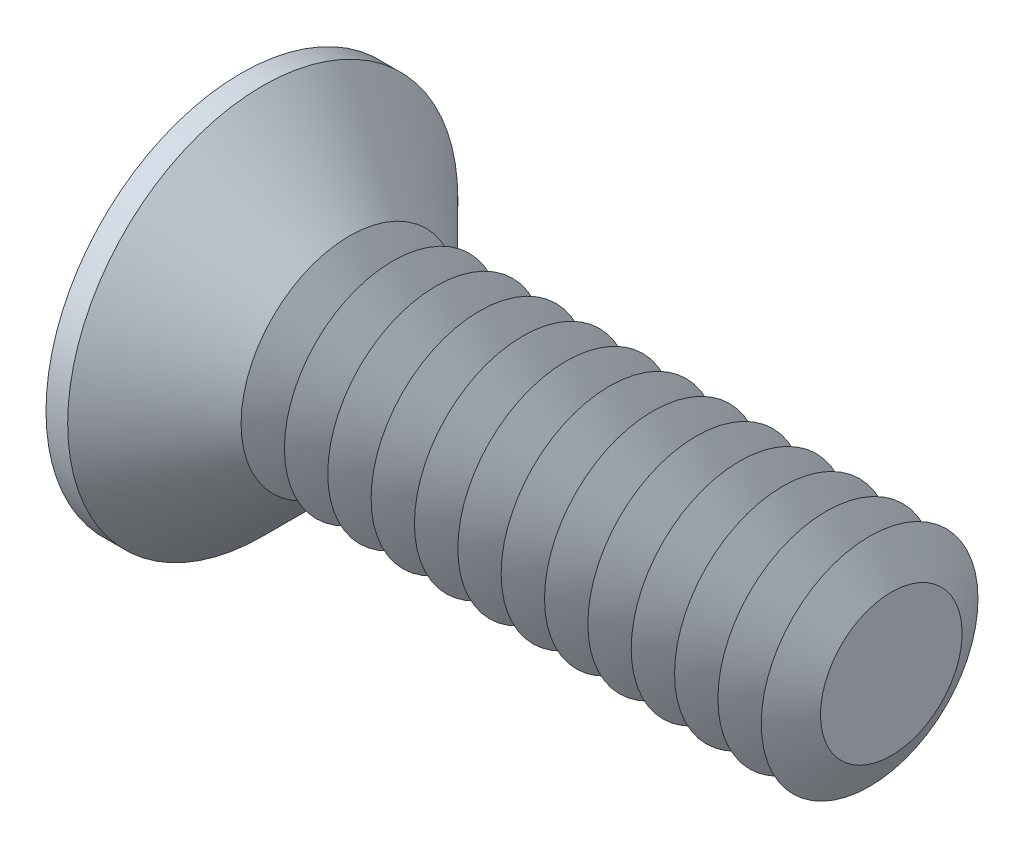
ISO-10303-21;
HEADER;
FILE_DESCRIPTION(('STEP AP214'),'2;1');
FILE_NAME('part.step','',(''),(''),'','','');
FILE_SCHEMA(('AUTOMOTIVE_DESIGN { 1 0 10303 214 1 1 1 1 }'));
ENDSEC;
DATA;
#1=APPLICATION_CONTEXT('core data for automotive mechanical design processes');
#2=APPLICATION_PROTOCOL_DEFINITION('international standard','automotive_design',2000,#1);
#3=PRODUCT_CONTEXT('',#1,'mechanical');
#4=PRODUCT('Part','Part','',(#3));
#5=PRODUCT_RELATED_PRODUCT_CATEGORY('part','',(#4));
#6=PRODUCT_DEFINITION_FORMATION('','',#4);
#7=PRODUCT_DEFINITION_CONTEXT('part definition',#1,'design');
#8=PRODUCT_DEFINITION('design','',#6,#7);
#9=PRODUCT_DEFINITION_SHAPE('','',#8);
#10=(LENGTH_UNIT() NAMED_UNIT(*) SI_UNIT(.MILLI.,.METRE.));
#11=(NAMED_UNIT(*) PLANE_ANGLE_UNIT() SI_UNIT($,.RADIAN.));
#12=(NAMED_UNIT(*) SI_UNIT($,.STERADIAN.) SOLID_ANGLE_UNIT());
#13=UNCERTAINTY_MEASURE_WITH_UNIT(LENGTH_MEASURE(1.E-05),#10,'distance_accuracy_value','');
#14=(GEOMETRIC_REPRESENTATION_CONTEXT(3) GLOBAL_UNCERTAINTY_ASSIGNED_CONTEXT((#13)) GLOBAL_UNIT_ASSIGNED_CONTEXT((#10,
#11,#12)) REPRESENTATION_CONTEXT('',''));
#15=CARTESIAN_POINT('',(0.,0.,0.));
#16=DIRECTION('',(0.,0.,1.));
#17=DIRECTION('',(1.,0.,0.));
#18=AXIS2_PLACEMENT_3D('',#15,#16,#17);
#19=CARTESIAN_POINT('',(-0.480000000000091,-0.563733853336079,-0.240000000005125));
#20=DIRECTION('',(0.,0.,-1.00000000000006));
#21=DIRECTION('',(-0.999999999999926,0.,0.));
#22=AXIS2_PLACEMENT_3D('',#19,#20,#21);
#23=PLANE('',#22);
#24=DIRECTION('',(0.,-1.0000000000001,0.));
#25=VECTOR('',#24,1.);
#26=CARTESIAN_POINT('',(-0.999999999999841,1.20000000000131,-0.24000000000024));
#27=LINE('',#26,#25);
#28=CARTESIAN_POINT('',(-0.999999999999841,1.20000000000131,-0.24000000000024));
#29=VERTEX_POINT('',#28);
#30=CARTESIAN_POINT('',(-0.999999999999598,0.480000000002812,-0.240000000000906));
#31=VERTEX_POINT('',#30);
#32=EDGE_CURVE('E201',#29,#31,#27,.T.);
#33=ORIENTED_EDGE('',*,*,#32,.T.);
#34=DIRECTION('',(0.999999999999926,0.,0.));
#35=VECTOR('',#34,1.);
#36=CARTESIAN_POINT('',(-0.479999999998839,0.480000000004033,-0.240000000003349));
#37=LINE('',#36,#35);
#38=CARTESIAN_POINT('',(2.77555756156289E-13,0.480000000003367,-0.24000000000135));
#39=VERTEX_POINT('',#38);
#40=EDGE_CURVE('E332',#31,#39,#37,.T.);
#41=ORIENTED_EDGE('',*,*,#40,.T.);
#42=DIRECTION('',(0.,1.0000000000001,0.));
#43=VECTOR('',#42,1.);
#44=CARTESIAN_POINT('',(4.44089209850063E-13,0.56373385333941,-0.240000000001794));
#45=LINE('',#44,#43);
#46=CARTESIAN_POINT('',(4.44089209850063E-13,0.56373385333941,-0.240000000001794));
#47=VERTEX_POINT('',#46);
#48=EDGE_CURVE('E224',#39,#47,#45,.T.);
#49=ORIENTED_EDGE('',*,*,#48,.T.);
#50=CARTESIAN_POINT('',(-0.47999999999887,0.563733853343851,-0.240000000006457));
#51=DIRECTION('',(0.,0.,1.00000000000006));
#52=DIRECTION('',(0.999999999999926,0.,0.));
#53=AXIS2_PLACEMENT_3D('',#50,#51,#52);
#54=CIRCLE('',#53,0.48);
#55=CARTESIAN_POINT('',(-0.355766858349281,1.02737824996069,-0.240000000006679));
#56=VERTEX_POINT('',#55);
#57=EDGE_CURVE('E228',#47,#56,#54,.T.);
#58=ORIENTED_EDGE('',*,*,#57,.T.);
#59=DIRECTION('',(-0.965925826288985,0.258819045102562,0.));
#60=VECTOR('',#59,1.);
#61=CARTESIAN_POINT('',(-0.999999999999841,1.20000000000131,-0.24000000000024));
#62=LINE('',#61,#60);
#63=EDGE_CURVE('E231',#56,#29,#62,.T.);
#64=ORIENTED_EDGE('',*,*,#63,.T.);
#65=EDGE_LOOP('',(#33,#41,#49,#58,#64));
#66=FACE_BOUND('',#65,.T.);
#67=ADVANCED_FACE('F37',(#66),#23,.F.);
#68=CARTESIAN_POINT('',(4.00000000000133,1.22124532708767E-12,-3.33066907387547E-12));
#69=DIRECTION('',(-0.999999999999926,0.,0.));
#70=DIRECTION('',(0.,0.,1.00000000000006));
#71=AXIS2_PLACEMENT_3D('',#68,#69,#70);
#72=CONICAL_SURFACE('',#71,0.999999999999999,1.04719755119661);
#73=CARTESIAN_POINT('',(4.2000000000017,4.44089209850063E-13,-1.99840144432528E-12));
#74=DIRECTION('',(-0.999999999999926,0.,0.));
#75=DIRECTION('',(0.,0.,1.00000000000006));
#76=AXIS2_PLACEMENT_3D('',#73,#74,#75);
#77=CIRCLE('',#76,0.653589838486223);
#78=CARTESIAN_POINT('',(4.2000000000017,1.2179705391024E-12,0.653589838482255));
#79=VERTEX_POINT('',#78);
#80=EDGE_CURVE('E314',#79,#79,#77,.T.);
#81=CARTESIAN_POINT('',(4.00000000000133,1.22124532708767E-12,-3.33066907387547E-12));
#82=DIRECTION('',(-0.999999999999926,0.,0.));
#83=DIRECTION('',(0.,0.,1.00000000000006));
#84=AXIS2_PLACEMENT_3D('',#81,#82,#83);
#85=CIRCLE('',#84,1.);
#86=CARTESIAN_POINT('',(4.00000000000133,1.21980203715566E-12,0.999999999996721));
#87=VERTEX_POINT('',#86);
#88=EDGE_CURVE('E305',#87,#87,#85,.T.);
#89=CARTESIAN_POINT('',(4.2000000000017,1.2179705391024E-12,0.653589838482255));
#90=CARTESIAN_POINT('',(4.19791666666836,1.21798961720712E-12,0.657198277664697));
#91=CARTESIAN_POINT('',(4.19583333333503,1.21800869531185E-12,0.66080671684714));
#92=CARTESIAN_POINT('',(4.19166666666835,1.21804685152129E-12,0.668023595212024));
#93=CARTESIAN_POINT('',(4.18958333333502,1.21806592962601E-12,0.671632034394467));
#94=CARTESIAN_POINT('',(4.18541666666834,1.21810408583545E-12,0.678848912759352));
#95=CARTESIAN_POINT('',(4.183333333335,1.21812316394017E-12,0.682457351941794));
#96=CARTESIAN_POINT('',(4.17916666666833,1.21816132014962E-12,0.689674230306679));
#97=CARTESIAN_POINT('',(4.17708333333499,1.21818039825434E-12,0.693282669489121));
#98=CARTESIAN_POINT('',(4.17291666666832,1.21821855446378E-12,0.700499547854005));
#99=CARTESIAN_POINT('',(4.17083333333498,1.2182376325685E-12,0.704107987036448));
#100=CARTESIAN_POINT('',(4.1666666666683,1.21827578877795E-12,0.711324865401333));
#101=CARTESIAN_POINT('',(4.16458333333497,1.21829486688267E-12,0.714933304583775));
#102=CARTESIAN_POINT('',(4.16041666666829,1.21833302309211E-12,0.72215018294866));
#103=CARTESIAN_POINT('',(4.15833333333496,1.21835210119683E-12,0.725758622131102));
#104=CARTESIAN_POINT('',(4.15416666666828,1.21839025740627E-12,0.732975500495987));
#105=CARTESIAN_POINT('',(4.15208333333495,1.218409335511E-12,0.736583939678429));
#106=CARTESIAN_POINT('',(4.14791666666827,1.21844749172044E-12,0.743800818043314));
#107=CARTESIAN_POINT('',(4.14583333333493,1.21846656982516E-12,0.747409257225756));
#108=CARTESIAN_POINT('',(4.14166666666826,1.2185047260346E-12,0.754626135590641));
#109=CARTESIAN_POINT('',(4.13958333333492,1.21852380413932E-12,0.758234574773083));
#110=CARTESIAN_POINT('',(4.13541666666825,1.21856196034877E-12,0.765451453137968));
#111=CARTESIAN_POINT('',(4.13333333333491,1.21858103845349E-12,0.76905989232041));
#112=CARTESIAN_POINT('',(4.12916666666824,1.21861919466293E-12,0.776276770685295));
#113=CARTESIAN_POINT('',(4.1270833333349,1.21863827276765E-12,0.779885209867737));
#114=CARTESIAN_POINT('',(4.12291666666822,1.2186764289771E-12,0.787102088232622));
#115=CARTESIAN_POINT('',(4.12083333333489,1.21869550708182E-12,0.790710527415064));
#116=CARTESIAN_POINT('',(4.11666666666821,1.21873366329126E-12,0.797927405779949));
#117=CARTESIAN_POINT('',(4.11458333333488,1.21875274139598E-12,0.801535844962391));
#118=CARTESIAN_POINT('',(4.1104166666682,1.21879089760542E-12,0.808752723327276));
#119=CARTESIAN_POINT('',(4.10833333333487,1.21880997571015E-12,0.812361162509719));
#120=CARTESIAN_POINT('',(4.10416666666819,1.21884813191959E-12,0.819578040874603));
#121=CARTESIAN_POINT('',(4.10208333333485,1.21886721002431E-12,0.823186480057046));
#122=CARTESIAN_POINT('',(4.09791666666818,1.21890536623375E-12,0.83040335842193));
#123=CARTESIAN_POINT('',(4.09583333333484,1.21892444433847E-12,0.834011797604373));
#124=CARTESIAN_POINT('',(4.09166666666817,1.21896260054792E-12,0.841228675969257));
#125=CARTESIAN_POINT('',(4.08958333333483,1.21898167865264E-12,0.8448371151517));
#126=CARTESIAN_POINT('',(4.08541666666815,1.21901983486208E-12,0.852053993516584));
#127=CARTESIAN_POINT('',(4.08333333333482,1.2190389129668E-12,0.855662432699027));
#128=CARTESIAN_POINT('',(4.07916666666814,1.21907706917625E-12,0.862879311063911));
#129=CARTESIAN_POINT('',(4.07708333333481,1.21909614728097E-12,0.866487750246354));
#130=CARTESIAN_POINT('',(4.07291666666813,1.21913430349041E-12,0.873704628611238));
#131=CARTESIAN_POINT('',(4.07083333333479,1.21915338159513E-12,0.877313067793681));
#132=CARTESIAN_POINT('',(4.06666666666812,1.21919153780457E-12,0.884529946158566));
#133=CARTESIAN_POINT('',(4.06458333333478,1.2192106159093E-12,0.888138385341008));
#134=CARTESIAN_POINT('',(4.06041666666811,1.21924877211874E-12,0.895355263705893));
#135=CARTESIAN_POINT('',(4.05833333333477,1.21926785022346E-12,0.898963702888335));
#136=CARTESIAN_POINT('',(4.0541666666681,1.2193060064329E-12,0.90618058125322));
#137=CARTESIAN_POINT('',(4.05208333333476,1.21932508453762E-12,0.909789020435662));
#138=CARTESIAN_POINT('',(4.04791666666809,1.21936324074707E-12,0.917005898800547));
#139=CARTESIAN_POINT('',(4.04583333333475,1.21938231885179E-12,0.920614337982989));
#140=CARTESIAN_POINT('',(4.04166666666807,1.21942047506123E-12,0.927831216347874));
#141=CARTESIAN_POINT('',(4.03958333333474,1.21943955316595E-12,0.931439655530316));
#142=CARTESIAN_POINT('',(4.03541666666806,1.2194777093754E-12,0.938656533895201));
#143=CARTESIAN_POINT('',(4.03333333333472,1.21949678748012E-12,0.942264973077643));
#144=CARTESIAN_POINT('',(4.02916666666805,1.21953494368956E-12,0.949481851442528));
#145=CARTESIAN_POINT('',(4.02708333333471,1.21955402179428E-12,0.95309029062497));
#146=CARTESIAN_POINT('',(4.02291666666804,1.21959217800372E-12,0.960307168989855));
#147=CARTESIAN_POINT('',(4.0208333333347,1.21961125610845E-12,0.963915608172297));
#148=CARTESIAN_POINT('',(4.01666666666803,1.21964941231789E-12,0.971132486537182));
#149=CARTESIAN_POINT('',(4.01458333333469,1.21966849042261E-12,0.974740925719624));
#150=CARTESIAN_POINT('',(4.01041666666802,1.21970664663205E-12,0.981957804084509));
#151=CARTESIAN_POINT('',(4.00833333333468,1.21972572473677E-12,0.985566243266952));
#152=CARTESIAN_POINT('',(4.004166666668,1.21976388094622E-12,0.992783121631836));
#153=CARTESIAN_POINT('',(4.00208333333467,1.21978295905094E-12,0.996391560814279));
#154=CARTESIAN_POINT('',(4.00000000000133,1.21980203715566E-12,0.999999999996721));
#155=B_SPLINE_CURVE_WITH_KNOTS('',3,(#89,#90,#91,#92,#93,#94,#95,#96,#97,#98,#99,#100,#101,#102,
#103,#104,#105,#106,#107,#108,#109,#110,#111,#112,#113,#114,#115,#116,#117,#118,#119,#120,#121,
#122,#123,#124,#125,#126,#127,#128,#129,#130,#131,#132,#133,#134,#135,#136,#137,#138,#139,#140,
#141,#142,#143,#144,#145,#146,#147,#148,#149,#150,#151,#152,#153,#154),.UNSPECIFIED.,.F.,.F.,(4,
2,2,2,2,2,2,2,2,2,2,2,2,2,2,2,2,2,2,2,2,2,2,2,2,2,2,2,2,2,2,2,4),(0.,0.0125000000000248,
0.0250000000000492,0.0375000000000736,0.0500000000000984,0.0625000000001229,0.0750000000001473,
0.0875000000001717,0.100000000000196,0.112500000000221,0.125000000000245,0.137500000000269,
0.150000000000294,0.162500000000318,0.175000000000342,0.187500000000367,0.200000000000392,
0.212500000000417,0.225000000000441,0.237500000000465,0.25000000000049,0.262500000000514,
0.275000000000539,0.287500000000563,0.300000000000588,0.312500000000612,0.325000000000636,
0.337500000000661,0.350000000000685,0.36250000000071,0.375000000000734,0.387500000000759,
0.400000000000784),.UNSPECIFIED.);
#156=EDGE_CURVE('BSEAM475',#79,#87,#155,.T.);
#157=ORIENTED_EDGE('',*,*,#80,.T.);
#158=ORIENTED_EDGE('',*,*,#88,.F.);
#159=ORIENTED_EDGE('',*,*,#156,.T.);
#160=ORIENTED_EDGE('',*,*,#156,.F.);
#161=EDGE_LOOP('',(#157,#159,#158,#160));
#162=FACE_BOUND('',#161,.T.);
#163=ADVANCED_FACE('F475',(#162),#72,.T.);
#164=CARTESIAN_POINT('',(4.2000000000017,4.44089209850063E-13,-1.99840144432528E-12));
#165=DIRECTION('',(0.999999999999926,0.,0.));
#166=DIRECTION('',(0.,0.,-1.00000000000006));
#167=AXIS2_PLACEMENT_3D('',#164,#165,#166);
#168=CONICAL_SURFACE('',#167,0.653589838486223,1.04719755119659);
#169=CARTESIAN_POINT('',(4.40000000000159,9.99200722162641E-13,-4.88498130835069E-12));
#170=DIRECTION('',(-0.999999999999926,0.,0.));
#171=DIRECTION('',(0.,0.,1.00000000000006));
#172=AXIS2_PLACEMENT_3D('',#169,#170,#171);
#173=CIRCLE('',#172,1.);
#174=CARTESIAN_POINT('',(4.40000000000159,9.97757432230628E-13,0.999999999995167));
#175=VERTEX_POINT('',#174);
#176=EDGE_CURVE('E311',#175,#175,#173,.T.);
#177=ORIENTED_EDGE('',*,*,#176,.T.);
#178=EDGE_LOOP('',(#177));
#179=FACE_BOUND('',#178,.T.);
#180=ORIENTED_EDGE('',*,*,#80,.F.);
#181=EDGE_LOOP('',(#180));
#182=FACE_BOUND('',#181,.T.);
#183=ADVANCED_FACE('F482',(#179,#182),#168,.T.);
#184=CARTESIAN_POINT('',(5.0000000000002,1.00000000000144,-3.77475828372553E-12));
#185=DIRECTION('',(-0.999999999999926,0.,0.));
#186=DIRECTION('',(0.,-1.0000000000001,0.));
#187=AXIS2_PLACEMENT_3D('',#184,#185,#186);
#188=PLANE('',#187);
#189=CARTESIAN_POINT('',(5.00000000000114,2.22044604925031E-13,-4.44089209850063E-13));
#190=DIRECTION('',(-0.999999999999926,0.,0.));
#191=DIRECTION('',(0.,0.,1.00000000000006));
#192=AXIS2_PLACEMENT_3D('',#189,#190,#191);
#193=CIRCLE('',#192,0.653589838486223);
#194=CARTESIAN_POINT('',(5.00000000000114,2.18769816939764E-13,0.653589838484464));
#195=VERTEX_POINT('',#194);
#196=EDGE_CURVE('E323',#195,#195,#193,.T.);
#197=ORIENTED_EDGE('',*,*,#196,.F.);
#198=EDGE_LOOP('',(#197));
#199=FACE_BOUND('',#198,.T.);
#200=ADVANCED_FACE('F39',(#199),#188,.F.);
#201=CARTESIAN_POINT('',(4.80000000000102,2.22044604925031E-13,-1.55431223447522E-12));
#202=DIRECTION('',(-0.999999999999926,0.,0.));
#203=DIRECTION('',(0.,0.,1.00000000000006));
#204=AXIS2_PLACEMENT_3D('',#201,#202,#203);
#205=CONICAL_SURFACE('',#204,0.999999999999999,1.04719755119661);
#206=CARTESIAN_POINT('',(4.80000000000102,2.22044604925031E-13,-1.55431223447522E-12));
#207=DIRECTION('',(-0.999999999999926,0.,0.));
#208=DIRECTION('',(0.,0.,1.00000000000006));
#209=AXIS2_PLACEMENT_3D('',#206,#207,#208);
#210=CIRCLE('',#209,1.);
#211=CARTESIAN_POINT('',(4.80000000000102,2.20601314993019E-13,0.999999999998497));
#212=VERTEX_POINT('',#211);
#213=EDGE_CURVE('E317',#212,#212,#210,.T.);
#214=CARTESIAN_POINT('',(5.00000000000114,2.18769816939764E-13,0.653589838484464));
#215=CARTESIAN_POINT('',(4.9979166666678,2.18788895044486E-13,0.657198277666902));
#216=CARTESIAN_POINT('',(4.99583333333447,2.18807973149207E-13,0.66080671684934));
#217=CARTESIAN_POINT('',(4.9916666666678,2.1884612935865E-13,0.668023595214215));
#218=CARTESIAN_POINT('',(4.98958333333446,2.18865207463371E-13,0.671632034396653));
#219=CARTESIAN_POINT('',(4.9854166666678,2.18903363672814E-13,0.678848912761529));
#220=CARTESIAN_POINT('',(4.98333333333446,2.18922441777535E-13,0.682457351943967));
#221=CARTESIAN_POINT('',(4.97916666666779,2.18960597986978E-13,0.689674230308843));
#222=CARTESIAN_POINT('',(4.97708333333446,2.189796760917E-13,0.69328266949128));
#223=CARTESIAN_POINT('',(4.97291666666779,2.19017832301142E-13,0.700499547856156));
#224=CARTESIAN_POINT('',(4.97083333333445,2.19036910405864E-13,0.704107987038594));
#225=CARTESIAN_POINT('',(4.96666666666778,2.19075066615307E-13,0.71132486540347));
#226=CARTESIAN_POINT('',(4.96458333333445,2.19094144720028E-13,0.714933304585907));
#227=CARTESIAN_POINT('',(4.96041666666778,2.19132300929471E-13,0.722150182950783));
#228=CARTESIAN_POINT('',(4.95833333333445,2.19151379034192E-13,0.725758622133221));
#229=CARTESIAN_POINT('',(4.95416666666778,2.19189535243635E-13,0.732975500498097));
#230=CARTESIAN_POINT('',(4.95208333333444,2.19208613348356E-13,0.736583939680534));
#231=CARTESIAN_POINT('',(4.94791666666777,2.19246769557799E-13,0.74380081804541));
#232=CARTESIAN_POINT('',(4.94583333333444,2.19265847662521E-13,0.747409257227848));
#233=CARTESIAN_POINT('',(4.94166666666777,2.19304003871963E-13,0.754626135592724));
#234=CARTESIAN_POINT('',(4.93958333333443,2.19323081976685E-13,0.758234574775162));
#235=CARTESIAN_POINT('',(4.93541666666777,2.19361238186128E-13,0.765451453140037));
#236=CARTESIAN_POINT('',(4.93333333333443,2.19380316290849E-13,0.769059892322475));
#237=CARTESIAN_POINT('',(4.92916666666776,2.19418472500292E-13,0.776276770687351));
#238=CARTESIAN_POINT('',(4.92708333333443,2.19437550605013E-13,0.779885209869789));
#239=CARTESIAN_POINT('',(4.92291666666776,2.19475706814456E-13,0.787102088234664));
#240=CARTESIAN_POINT('',(4.92083333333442,2.19494784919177E-13,0.790710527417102));
#241=CARTESIAN_POINT('',(4.91666666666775,2.1953294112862E-13,0.797927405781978));
#242=CARTESIAN_POINT('',(4.91458333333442,2.19552019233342E-13,0.801535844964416));
#243=CARTESIAN_POINT('',(4.91041666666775,2.19590175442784E-13,0.808752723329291));
#244=CARTESIAN_POINT('',(4.90833333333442,2.19609253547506E-13,0.812361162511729));
#245=CARTESIAN_POINT('',(4.90416666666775,2.19647409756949E-13,0.819578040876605));
#246=CARTESIAN_POINT('',(4.90208333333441,2.1966648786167E-13,0.823186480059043));
#247=CARTESIAN_POINT('',(4.89791666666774,2.19704644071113E-13,0.830403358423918));
#248=CARTESIAN_POINT('',(4.89583333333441,2.19723722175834E-13,0.834011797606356));
#249=CARTESIAN_POINT('',(4.89166666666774,2.19761878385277E-13,0.841228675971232));
#250=CARTESIAN_POINT('',(4.8895833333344,2.19780956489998E-13,0.84483711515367));
#251=CARTESIAN_POINT('',(4.88541666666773,2.19819112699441E-13,0.852053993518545));
#252=CARTESIAN_POINT('',(4.8833333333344,2.19838190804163E-13,0.855662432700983));
#253=CARTESIAN_POINT('',(4.87916666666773,2.19876347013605E-13,0.862879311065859));
#254=CARTESIAN_POINT('',(4.8770833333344,2.19895425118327E-13,0.866487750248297));
#255=CARTESIAN_POINT('',(4.87291666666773,2.1993358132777E-13,0.873704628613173));
#256=CARTESIAN_POINT('',(4.87083333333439,2.19952659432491E-13,0.87731306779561));
#257=CARTESIAN_POINT('',(4.86666666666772,2.19990815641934E-13,0.884529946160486));
#258=CARTESIAN_POINT('',(4.86458333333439,2.20009893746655E-13,0.888138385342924));
#259=CARTESIAN_POINT('',(4.86041666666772,2.20048049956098E-13,0.8953552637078));
#260=CARTESIAN_POINT('',(4.85833333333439,2.20067128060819E-13,0.898963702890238));
#261=CARTESIAN_POINT('',(4.85416666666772,2.20105284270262E-13,0.906180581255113));
#262=CARTESIAN_POINT('',(4.85208333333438,2.20124362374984E-13,0.909789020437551));
#263=CARTESIAN_POINT('',(4.84791666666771,2.20162518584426E-13,0.917005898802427));
#264=CARTESIAN_POINT('',(4.84583333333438,2.20181596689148E-13,0.920614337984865));
#265=CARTESIAN_POINT('',(4.84166666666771,2.20219752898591E-13,0.92783121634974));
#266=CARTESIAN_POINT('',(4.83958333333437,2.20238831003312E-13,0.931439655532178));
#267=CARTESIAN_POINT('',(4.8354166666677,2.20276987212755E-13,0.938656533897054));
#268=CARTESIAN_POINT('',(4.83333333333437,2.20296065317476E-13,0.942264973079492));
#269=CARTESIAN_POINT('',(4.8291666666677,2.20334221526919E-13,0.949481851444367));
#270=CARTESIAN_POINT('',(4.82708333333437,2.2035329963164E-13,0.953090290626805));
#271=CARTESIAN_POINT('',(4.8229166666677,2.20391455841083E-13,0.960307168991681));
#272=CARTESIAN_POINT('',(4.82083333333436,2.20410533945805E-13,0.963915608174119));
#273=CARTESIAN_POINT('',(4.81666666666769,2.20448690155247E-13,0.971132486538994));
#274=CARTESIAN_POINT('',(4.81458333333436,2.20467768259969E-13,0.974740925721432));
#275=CARTESIAN_POINT('',(4.81041666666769,2.20505924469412E-13,0.981957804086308));
#276=CARTESIAN_POINT('',(4.80833333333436,2.20525002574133E-13,0.985566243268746));
#277=CARTESIAN_POINT('',(4.80416666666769,2.20563158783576E-13,0.992783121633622));
#278=CARTESIAN_POINT('',(4.80208333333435,2.20582236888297E-13,0.99639156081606));
#279=CARTESIAN_POINT('',(4.80000000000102,2.20601314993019E-13,0.999999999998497));
#280=B_SPLINE_CURVE_WITH_KNOTS('',3,(#214,#215,#216,#217,#218,#219,#220,#221,#222,#223,#224,
#225,#226,#227,#228,#229,#230,#231,#232,#233,#234,#235,#236,#237,#238,#239,#240,#241,#242,#243,
#244,#245,#246,#247,#248,#249,#250,#251,#252,#253,#254,#255,#256,#257,#258,#259,#260,#261,#262,
#263,#264,#265,#266,#267,#268,#269,#270,#271,#272,#273,#274,#275,#276,#277,#278,#279),
.UNSPECIFIED.,.F.,.F.,(4,2,2,2,2,2,2,2,2,2,2,2,2,2,2,2,2,2,2,2,2,2,2,2,2,2,2,2,2,2,2,2,4),(0.,
0.0125000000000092,0.025000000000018,0.0375000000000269,0.0500000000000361,0.062500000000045,
0.0750000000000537,0.0875000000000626,0.100000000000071,0.11250000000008,0.125000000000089,
0.137500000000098,0.150000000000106,0.162500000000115,0.175000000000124,0.187500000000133,
0.200000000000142,0.212500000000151,0.22500000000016,0.237500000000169,0.250000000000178,
0.262500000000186,0.275000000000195,0.287500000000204,0.300000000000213,0.312500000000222,
0.32500000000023,0.33750000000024,0.350000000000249,0.362500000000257,0.375000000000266,
0.387500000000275,0.400000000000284),.UNSPECIFIED.);
#281=EDGE_CURVE('BSEAM592',#195,#212,#280,.T.);
#282=ORIENTED_EDGE('',*,*,#196,.T.);
#283=ORIENTED_EDGE('',*,*,#213,.F.);
#284=ORIENTED_EDGE('',*,*,#281,.T.);
#285=ORIENTED_EDGE('',*,*,#281,.F.);
#286=EDGE_LOOP('',(#282,#284,#283,#285));
#287=FACE_BOUND('',#286,.T.);
#288=ADVANCED_FACE('F592',(#287),#205,.T.);
#289=CARTESIAN_POINT('',(4.60000000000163,-2.55351295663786E-12,-9.32587340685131E-12));
#290=DIRECTION('',(0.999999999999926,0.,0.));
#291=DIRECTION('',(0.,0.,-1.00000000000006));
#292=AXIS2_PLACEMENT_3D('',#289,#290,#291);
#293=CONICAL_SURFACE('',#292,0.653589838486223,1.04719755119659);
#294=ORIENTED_EDGE('',*,*,#213,.T.);
#295=EDGE_LOOP('',(#294));
#296=FACE_BOUND('',#295,.T.);
#297=CARTESIAN_POINT('',(4.60000000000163,-2.55351295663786E-12,-9.32587340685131E-12));
#298=DIRECTION('',(-0.999999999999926,0.,0.));
#299=DIRECTION('',(0.,0.,1.00000000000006));
#300=AXIS2_PLACEMENT_3D('',#297,#298,#299);
#301=CIRCLE('',#300,0.653589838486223);
#302=CARTESIAN_POINT('',(4.60000000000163,9.95925934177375E-13,0.653589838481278));
#303=VERTEX_POINT('',#302);
#304=EDGE_CURVE('E320',#303,#303,#301,.T.);
#305=ORIENTED_EDGE('',*,*,#304,.F.);
#306=EDGE_LOOP('',(#305));
#307=FACE_BOUND('',#306,.T.);
#308=ADVANCED_FACE('F589',(#296,#307),#293,.T.);
#309=CARTESIAN_POINT('',(4.40000000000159,9.99200722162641E-13,-4.88498130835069E-12));
#310=DIRECTION('',(-0.999999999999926,0.,0.));
#311=DIRECTION('',(0.,0.,1.00000000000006));
#312=AXIS2_PLACEMENT_3D('',#309,#310,#311);
#313=CONICAL_SURFACE('',#312,0.999999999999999,1.04719755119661);
#314=CARTESIAN_POINT('',(4.60000000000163,9.95925934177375E-13,0.653589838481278));
#315=CARTESIAN_POINT('',(4.59791666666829,9.95945012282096E-13,0.657198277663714));
#316=CARTESIAN_POINT('',(4.59583333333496,9.95964090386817E-13,0.66080671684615));
#317=CARTESIAN_POINT('',(4.59166666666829,9.9600224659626E-13,0.668023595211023));
#318=CARTESIAN_POINT('',(4.58958333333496,9.96021324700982E-13,0.671632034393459));
#319=CARTESIAN_POINT('',(4.58541666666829,9.96059480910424E-13,0.678848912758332));
#320=CARTESIAN_POINT('',(4.58333333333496,9.96078559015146E-13,0.682457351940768));
#321=CARTESIAN_POINT('',(4.57916666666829,9.96116715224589E-13,0.689674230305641));
#322=CARTESIAN_POINT('',(4.57708333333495,9.9613579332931E-13,0.693282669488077));
#323=CARTESIAN_POINT('',(4.57291666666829,9.96173949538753E-13,0.70049954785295));
#324=CARTESIAN_POINT('',(4.57083333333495,9.96193027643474E-13,0.704107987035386));
#325=CARTESIAN_POINT('',(4.56666666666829,9.96231183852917E-13,0.711324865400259));
#326=CARTESIAN_POINT('',(4.56458333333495,9.96250261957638E-13,0.714933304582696));
#327=CARTESIAN_POINT('',(4.56041666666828,9.96288418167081E-13,0.722150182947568));
#328=CARTESIAN_POINT('',(4.55833333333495,9.96307496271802E-13,0.725758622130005));
#329=CARTESIAN_POINT('',(4.55416666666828,9.96345652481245E-13,0.732975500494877));
#330=CARTESIAN_POINT('',(4.55208333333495,9.96364730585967E-13,0.736583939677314));
#331=CARTESIAN_POINT('',(4.54791666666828,9.96402886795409E-13,0.743800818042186));
#332=CARTESIAN_POINT('',(4.54583333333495,9.96421964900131E-13,0.747409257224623));
#333=CARTESIAN_POINT('',(4.54166666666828,9.96460121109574E-13,0.754626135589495));
#334=CARTESIAN_POINT('',(4.53958333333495,9.96479199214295E-13,0.758234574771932));
#335=CARTESIAN_POINT('',(4.53541666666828,9.96517355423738E-13,0.765451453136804));
#336=CARTESIAN_POINT('',(4.53333333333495,9.96536433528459E-13,0.769059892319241));
#337=CARTESIAN_POINT('',(4.52916666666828,9.96574589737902E-13,0.776276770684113));
#338=CARTESIAN_POINT('',(4.52708333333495,9.96593667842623E-13,0.77988520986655));
#339=CARTESIAN_POINT('',(4.52291666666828,9.96631824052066E-13,0.787102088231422));
#340=CARTESIAN_POINT('',(4.52083333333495,9.96650902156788E-13,0.790710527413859));
#341=CARTESIAN_POINT('',(4.51666666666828,9.9668905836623E-13,0.797927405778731));
#342=CARTESIAN_POINT('',(4.51458333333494,9.96708136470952E-13,0.801535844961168));
#343=CARTESIAN_POINT('',(4.51041666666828,9.96746292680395E-13,0.80875272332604));
#344=CARTESIAN_POINT('',(4.50833333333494,9.96765370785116E-13,0.812361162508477));
#345=CARTESIAN_POINT('',(4.50416666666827,9.96803526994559E-13,0.81957804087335));
#346=CARTESIAN_POINT('',(4.50208333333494,9.9682260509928E-13,0.823186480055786));
#347=CARTESIAN_POINT('',(4.49791666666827,9.96860761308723E-13,0.830403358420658));
#348=CARTESIAN_POINT('',(4.49583333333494,9.96879839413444E-13,0.834011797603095));
#349=CARTESIAN_POINT('',(4.49166666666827,9.96917995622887E-13,0.841228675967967));
#350=CARTESIAN_POINT('',(4.48958333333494,9.96937073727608E-13,0.844837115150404));
#351=CARTESIAN_POINT('',(4.48541666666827,9.96975229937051E-13,0.852053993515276));
#352=CARTESIAN_POINT('',(4.48333333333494,9.96994308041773E-13,0.855662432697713));
#353=CARTESIAN_POINT('',(4.47916666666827,9.97032464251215E-13,0.862879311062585));
#354=CARTESIAN_POINT('',(4.47708333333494,9.97051542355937E-13,0.866487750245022));
#355=CARTESIAN_POINT('',(4.47291666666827,9.97089698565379E-13,0.873704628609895));
#356=CARTESIAN_POINT('',(4.47083333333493,9.97108776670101E-13,0.877313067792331));
#357=CARTESIAN_POINT('',(4.46666666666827,9.97146932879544E-13,0.884529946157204));
#358=CARTESIAN_POINT('',(4.46458333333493,9.97166010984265E-13,0.88813838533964));
#359=CARTESIAN_POINT('',(4.46041666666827,9.97204167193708E-13,0.895355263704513));
#360=CARTESIAN_POINT('',(4.45833333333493,9.97223245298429E-13,0.898963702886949));
#361=CARTESIAN_POINT('',(4.45416666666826,9.97261401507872E-13,0.906180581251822));
#362=CARTESIAN_POINT('',(4.45208333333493,9.97280479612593E-13,0.909789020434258));
#363=CARTESIAN_POINT('',(4.44791666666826,9.97318635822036E-13,0.917005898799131));
#364=CARTESIAN_POINT('',(4.44583333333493,9.97337713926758E-13,0.920614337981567));
#365=CARTESIAN_POINT('',(4.44166666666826,9.973758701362E-13,0.92783121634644));
#366=CARTESIAN_POINT('',(4.43958333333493,9.97394948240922E-13,0.931439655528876));
#367=CARTESIAN_POINT('',(4.43541666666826,9.97433104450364E-13,0.938656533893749));
#368=CARTESIAN_POINT('',(4.43333333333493,9.97452182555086E-13,0.942264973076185));
#369=CARTESIAN_POINT('',(4.42916666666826,9.97490338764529E-13,0.949481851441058));
#370=CARTESIAN_POINT('',(4.42708333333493,9.9750941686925E-13,0.953090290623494));
#371=CARTESIAN_POINT('',(4.42291666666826,9.97547573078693E-13,0.960307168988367));
#372=CARTESIAN_POINT('',(4.42083333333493,9.97566651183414E-13,0.963915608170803));
#373=CARTESIAN_POINT('',(4.41666666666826,9.97604807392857E-13,0.971132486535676));
#374=CARTESIAN_POINT('',(4.41458333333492,9.97623885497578E-13,0.974740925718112));
#375=CARTESIAN_POINT('',(4.41041666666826,9.97662041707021E-13,0.981957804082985));
#376=CARTESIAN_POINT('',(4.40833333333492,9.97681119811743E-13,0.985566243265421));
#377=CARTESIAN_POINT('',(4.40416666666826,9.97719276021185E-13,0.992783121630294));
#378=CARTESIAN_POINT('',(4.40208333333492,9.97738354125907E-13,0.99639156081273));
#379=CARTESIAN_POINT('',(4.40000000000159,9.97757432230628E-13,0.999999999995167));
#380=B_SPLINE_CURVE_WITH_KNOTS('',3,(#314,#315,#316,#317,#318,#319,#320,#321,#322,#323,#324,
#325,#326,#327,#328,#329,#330,#331,#332,#333,#334,#335,#336,#337,#338,#339,#340,#341,#342,#343,
#344,#345,#346,#347,#348,#349,#350,#351,#352,#353,#354,#355,#356,#357,#358,#359,#360,#361,#362,
#363,#364,#365,#366,#367,#368,#369,#370,#371,#372,#373,#374,#375,#376,#377,#378,#379),
.UNSPECIFIED.,.F.,.F.,(4,2,2,2,2,2,2,2,2,2,2,2,2,2,2,2,2,2,2,2,2,2,2,2,2,2,2,2,2,2,2,2,4),(0.,
0.012500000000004,0.0250000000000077,0.0375000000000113,0.0500000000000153,0.0625000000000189,
0.0750000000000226,0.0875000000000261,0.10000000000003,0.112500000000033,0.125000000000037,
0.13750000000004,0.150000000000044,0.162500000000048,0.175000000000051,0.187500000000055,
0.200000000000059,0.212500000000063,0.225000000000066,0.23750000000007,0.250000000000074,
0.262500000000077,0.275000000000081,0.287500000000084,0.300000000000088,0.312500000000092,
0.325000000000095,0.337500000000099,0.350000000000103,0.362500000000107,0.37500000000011,
0.387500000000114,0.400000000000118),.UNSPECIFIED.);
#381=EDGE_CURVE('BSEAM584',#303,#175,#380,.T.);
#382=ORIENTED_EDGE('',*,*,#304,.T.);
#383=ORIENTED_EDGE('',*,*,#176,.F.);
#384=ORIENTED_EDGE('',*,*,#381,.T.);
#385=ORIENTED_EDGE('',*,*,#381,.F.);
#386=EDGE_LOOP('',(#382,#384,#383,#385));
#387=FACE_BOUND('',#386,.T.);
#388=ADVANCED_FACE('F584',(#387),#313,.T.);
#389=CARTESIAN_POINT('',(3.60000000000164,6.66133814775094E-13,-7.32747196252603E-12));
#390=DIRECTION('',(-0.999999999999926,0.,0.));
#391=DIRECTION('',(0.,0.,1.00000000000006));
#392=AXIS2_PLACEMENT_3D('',#389,#390,#391);
#393=CONICAL_SURFACE('',#392,0.999999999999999,1.04719755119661);
#394=CARTESIAN_POINT('',(3.80000000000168,8.88178419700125E-13,-4.88498130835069E-12));
#395=DIRECTION('',(-0.999999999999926,0.,0.));
#396=DIRECTION('',(0.,0.,1.00000000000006));
#397=AXIS2_PLACEMENT_3D('',#394,#395,#396);
#398=CIRCLE('',#397,0.653589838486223);
#399=CARTESIAN_POINT('',(3.80000000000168,6.62859026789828E-13,0.653589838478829));
#400=VERTEX_POINT('',#399);
#401=EDGE_CURVE('E308',#400,#400,#398,.T.);
#402=CARTESIAN_POINT('',(3.60000000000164,6.66133814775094E-13,-7.32747196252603E-12));
#403=DIRECTION('',(-0.999999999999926,0.,0.));
#404=DIRECTION('',(0.,0.,1.00000000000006));
#405=AXIS2_PLACEMENT_3D('',#402,#403,#404);
#406=CIRCLE('',#405,1.);
#407=CARTESIAN_POINT('',(3.60000000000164,6.64690524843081E-13,0.999999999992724));
#408=VERTEX_POINT('',#407);
#409=EDGE_CURVE('E299',#408,#408,#406,.T.);
#410=CARTESIAN_POINT('',(3.80000000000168,6.62859026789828E-13,0.653589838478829));
#411=CARTESIAN_POINT('',(3.79791666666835,6.62878104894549E-13,0.657198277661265));
#412=CARTESIAN_POINT('',(3.79583333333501,6.6289718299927E-13,0.660806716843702));
#413=CARTESIAN_POINT('',(3.79166666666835,6.62935339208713E-13,0.668023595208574));
#414=CARTESIAN_POINT('',(3.78958333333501,6.62954417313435E-13,0.671632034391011));
#415=CARTESIAN_POINT('',(3.78541666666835,6.62992573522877E-13,0.678848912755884));
#416=CARTESIAN_POINT('',(3.78333333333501,6.63011651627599E-13,0.68245735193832));
#417=CARTESIAN_POINT('',(3.77916666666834,6.63049807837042E-13,0.689674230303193));
#418=CARTESIAN_POINT('',(3.77708333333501,6.63068885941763E-13,0.693282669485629));
#419=CARTESIAN_POINT('',(3.77291666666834,6.63107042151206E-13,0.700499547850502));
#420=CARTESIAN_POINT('',(3.77083333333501,6.63126120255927E-13,0.704107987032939));
#421=CARTESIAN_POINT('',(3.76666666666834,6.6316427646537E-13,0.711324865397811));
#422=CARTESIAN_POINT('',(3.76458333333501,6.63183354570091E-13,0.714933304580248));
#423=CARTESIAN_POINT('',(3.76041666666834,6.63221510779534E-13,0.722150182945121));
#424=CARTESIAN_POINT('',(3.75833333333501,6.63240588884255E-13,0.725758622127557));
#425=CARTESIAN_POINT('',(3.75416666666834,6.63278745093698E-13,0.73297550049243));
#426=CARTESIAN_POINT('',(3.75208333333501,6.6329782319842E-13,0.736583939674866));
#427=CARTESIAN_POINT('',(3.74791666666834,6.63335979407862E-13,0.743800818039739));
#428=CARTESIAN_POINT('',(3.745833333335,6.63355057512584E-13,0.747409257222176));
#429=CARTESIAN_POINT('',(3.74166666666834,6.63393213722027E-13,0.754626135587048));
#430=CARTESIAN_POINT('',(3.739583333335,6.63412291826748E-13,0.758234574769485));
#431=CARTESIAN_POINT('',(3.73541666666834,6.63450448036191E-13,0.765451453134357));
#432=CARTESIAN_POINT('',(3.733333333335,6.63469526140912E-13,0.769059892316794));
#433=CARTESIAN_POINT('',(3.72916666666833,6.63507682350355E-13,0.776276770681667));
#434=CARTESIAN_POINT('',(3.727083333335,6.63526760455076E-13,0.779885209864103));
#435=CARTESIAN_POINT('',(3.72291666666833,6.63564916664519E-13,0.787102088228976));
#436=CARTESIAN_POINT('',(3.720833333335,6.63583994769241E-13,0.790710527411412));
#437=CARTESIAN_POINT('',(3.71666666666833,6.63622150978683E-13,0.797927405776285));
#438=CARTESIAN_POINT('',(3.714583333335,6.63641229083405E-13,0.801535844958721));
#439=CARTESIAN_POINT('',(3.71041666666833,6.63679385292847E-13,0.808752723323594));
#440=CARTESIAN_POINT('',(3.708333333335,6.63698463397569E-13,0.812361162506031));
#441=CARTESIAN_POINT('',(3.70416666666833,6.63736619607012E-13,0.819578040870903));
#442=CARTESIAN_POINT('',(3.702083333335,6.63755697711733E-13,0.82318648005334));
#443=CARTESIAN_POINT('',(3.69791666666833,6.63793853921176E-13,0.830403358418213));
#444=CARTESIAN_POINT('',(3.69583333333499,6.63812932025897E-13,0.834011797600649));
#445=CARTESIAN_POINT('',(3.69166666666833,6.6385108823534E-13,0.841228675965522));
#446=CARTESIAN_POINT('',(3.68958333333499,6.63870166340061E-13,0.844837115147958));
#447=CARTESIAN_POINT('',(3.68541666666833,6.63908322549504E-13,0.852053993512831));
#448=CARTESIAN_POINT('',(3.68333333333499,6.63927400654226E-13,0.855662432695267));
#449=CARTESIAN_POINT('',(3.67916666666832,6.63965556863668E-13,0.86287931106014));
#450=CARTESIAN_POINT('',(3.67708333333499,6.6398463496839E-13,0.866487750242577));
#451=CARTESIAN_POINT('',(3.67291666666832,6.64022791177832E-13,0.873704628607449));
#452=CARTESIAN_POINT('',(3.67083333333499,6.64041869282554E-13,0.877313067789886));
#453=CARTESIAN_POINT('',(3.66666666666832,6.64080025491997E-13,0.884529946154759));
#454=CARTESIAN_POINT('',(3.66458333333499,6.64099103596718E-13,0.888138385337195));
#455=CARTESIAN_POINT('',(3.66041666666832,6.64137259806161E-13,0.895355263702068));
#456=CARTESIAN_POINT('',(3.65833333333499,6.64156337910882E-13,0.898963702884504));
#457=CARTESIAN_POINT('',(3.65416666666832,6.64194494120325E-13,0.906180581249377));
#458=CARTESIAN_POINT('',(3.65208333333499,6.64213572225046E-13,0.909789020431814));
#459=CARTESIAN_POINT('',(3.64791666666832,6.64251728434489E-13,0.917005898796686));
#460=CARTESIAN_POINT('',(3.64583333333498,6.64270806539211E-13,0.920614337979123));
#461=CARTESIAN_POINT('',(3.64166666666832,6.64308962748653E-13,0.927831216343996));
#462=CARTESIAN_POINT('',(3.63958333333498,6.64328040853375E-13,0.931439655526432));
#463=CARTESIAN_POINT('',(3.63541666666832,6.64366197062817E-13,0.938656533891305));
#464=CARTESIAN_POINT('',(3.63333333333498,6.64385275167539E-13,0.942264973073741));
#465=CARTESIAN_POINT('',(3.62916666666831,6.64423431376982E-13,0.949481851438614));
#466=CARTESIAN_POINT('',(3.62708333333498,6.64442509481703E-13,0.95309029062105));
#467=CARTESIAN_POINT('',(3.62291666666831,6.64480665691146E-13,0.960307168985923));
#468=CARTESIAN_POINT('',(3.62083333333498,6.64499743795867E-13,0.96391560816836));
#469=CARTESIAN_POINT('',(3.61666666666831,6.6453790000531E-13,0.971132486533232));
#470=CARTESIAN_POINT('',(3.61458333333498,6.64556978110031E-13,0.974740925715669));
#471=CARTESIAN_POINT('',(3.61041666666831,6.64595134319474E-13,0.981957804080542));
#472=CARTESIAN_POINT('',(3.60833333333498,6.64614212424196E-13,0.985566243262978));
#473=CARTESIAN_POINT('',(3.60416666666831,6.64652368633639E-13,0.992783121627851));
#474=CARTESIAN_POINT('',(3.60208333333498,6.6467144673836E-13,0.996391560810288));
#475=CARTESIAN_POINT('',(3.60000000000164,6.64690524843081E-13,0.999999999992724));
#476=B_SPLINE_CURVE_WITH_KNOTS('',3,(#410,#411,#412,#413,#414,#415,#416,#417,#418,#419,#420,
#421,#422,#423,#424,#425,#426,#427,#428,#429,#430,#431,#432,#433,#434,#435,#436,#437,#438,#439,
#440,#441,#442,#443,#444,#445,#446,#447,#448,#449,#450,#451,#452,#453,#454,#455,#456,#457,#458,
#459,#460,#461,#462,#463,#464,#465,#466,#467,#468,#469,#470,#471,#472,#473,#474,#475),
.UNSPECIFIED.,.F.,.F.,(4,2,2,2,2,2,2,2,2,2,2,2,2,2,2,2,2,2,2,2,2,2,2,2,2,2,2,2,2,2,2,2,4),(0.,
0.012500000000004,0.0250000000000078,0.0375000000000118,0.0500000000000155,0.0625000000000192,
0.0750000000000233,0.0875000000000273,0.100000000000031,0.112500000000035,0.125000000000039,
0.137500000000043,0.150000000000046,0.16250000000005,0.175000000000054,0.187500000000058,
0.200000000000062,0.212500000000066,0.22500000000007,0.237500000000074,0.250000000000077,
0.262500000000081,0.275000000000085,0.287500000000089,0.300000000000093,0.312500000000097,
0.325000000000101,0.337500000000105,0.350000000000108,0.362500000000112,0.375000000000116,
0.38750000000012,0.400000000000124),.UNSPECIFIED.);
#477=EDGE_CURVE('BSEAM580',#400,#408,#476,.T.);
#478=ORIENTED_EDGE('',*,*,#401,.T.);
#479=ORIENTED_EDGE('',*,*,#409,.F.);
#480=ORIENTED_EDGE('',*,*,#477,.T.);
#481=ORIENTED_EDGE('',*,*,#477,.F.);
#482=EDGE_LOOP('',(#478,#480,#479,#481));
#483=FACE_BOUND('',#482,.T.);
#484=ADVANCED_FACE('F580',(#483),#393,.T.);
#485=CARTESIAN_POINT('',(3.80000000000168,8.88178419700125E-13,-4.88498130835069E-12));
#486=DIRECTION('',(0.999999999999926,0.,0.));
#487=DIRECTION('',(0.,0.,-1.00000000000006));
#488=AXIS2_PLACEMENT_3D('',#485,#486,#487);
#489=CONICAL_SURFACE('',#488,0.653589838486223,1.04719755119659);
#490=ORIENTED_EDGE('',*,*,#88,.T.);
#491=EDGE_LOOP('',(#490));
#492=FACE_BOUND('',#491,.T.);
#493=ORIENTED_EDGE('',*,*,#401,.F.);
#494=EDGE_LOOP('',(#493));
#495=FACE_BOUND('',#494,.T.);
#496=ADVANCED_FACE('F576',(#492,#495),#489,.T.);
#497=CARTESIAN_POINT('',(3.20000000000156,-1.77635683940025E-12,0.));
#498=DIRECTION('',(-0.999999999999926,0.,0.));
#499=DIRECTION('',(0.,0.,1.00000000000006));
#500=AXIS2_PLACEMENT_3D('',#497,#498,#499);
#501=CONICAL_SURFACE('',#500,0.999999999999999,1.04719755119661);
#502=CARTESIAN_POINT('',(3.4000000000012,-9.99200722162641E-13,1.11022302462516E-12));
#503=DIRECTION('',(-0.999999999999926,0.,0.));
#504=DIRECTION('',(0.,0.,1.00000000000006));
#505=AXIS2_PLACEMENT_3D('',#502,#503,#504);
#506=CIRCLE('',#505,0.653589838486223);
#507=CARTESIAN_POINT('',(3.4000000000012,-1.77963162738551E-12,0.653589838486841));
#508=VERTEX_POINT('',#507);
#509=EDGE_CURVE('E302',#508,#508,#506,.T.);
#510=CARTESIAN_POINT('',(3.20000000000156,-1.77635683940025E-12,0.));
#511=DIRECTION('',(-0.999999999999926,0.,0.));
#512=DIRECTION('',(0.,0.,1.00000000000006));
#513=AXIS2_PLACEMENT_3D('',#510,#511,#512);
#514=CIRCLE('',#513,1.);
#515=CARTESIAN_POINT('',(3.20000000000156,-1.77780012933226E-12,1.00000000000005));
#516=VERTEX_POINT('',#515);
#517=EDGE_CURVE('E293',#516,#516,#514,.T.);
#518=CARTESIAN_POINT('',(3.4000000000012,-1.77963162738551E-12,0.653589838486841));
#519=CARTESIAN_POINT('',(3.39791666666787,-1.77961254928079E-12,0.657198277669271));
#520=CARTESIAN_POINT('',(3.39583333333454,-1.77959347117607E-12,0.6608067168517));
#521=CARTESIAN_POINT('',(3.39166666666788,-1.77955531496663E-12,0.668023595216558));
#522=CARTESIAN_POINT('',(3.38958333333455,-1.77953623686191E-12,0.671632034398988));
#523=CARTESIAN_POINT('',(3.3854166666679,-1.77949808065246E-12,0.678848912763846));
#524=CARTESIAN_POINT('',(3.38333333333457,-1.77947900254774E-12,0.682457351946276));
#525=CARTESIAN_POINT('',(3.37916666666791,-1.7794408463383E-12,0.689674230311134));
#526=CARTESIAN_POINT('',(3.37708333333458,-1.77942176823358E-12,0.693282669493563));
#527=CARTESIAN_POINT('',(3.37291666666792,-1.77938361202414E-12,0.700499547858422));
#528=CARTESIAN_POINT('',(3.37083333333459,-1.77936453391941E-12,0.704107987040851));
#529=CARTESIAN_POINT('',(3.36666666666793,-1.77932637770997E-12,0.71132486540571));
#530=CARTESIAN_POINT('',(3.3645833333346,-1.77930729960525E-12,0.714933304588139));
#531=CARTESIAN_POINT('',(3.36041666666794,-1.77926914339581E-12,0.722150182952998));
#532=CARTESIAN_POINT('',(3.35833333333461,-1.77925006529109E-12,0.725758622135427));
#533=CARTESIAN_POINT('',(3.35416666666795,-1.77921190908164E-12,0.732975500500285));
#534=CARTESIAN_POINT('',(3.35208333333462,-1.77919283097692E-12,0.736583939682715));
#535=CARTESIAN_POINT('',(3.34791666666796,-1.77915467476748E-12,0.743800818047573));
#536=CARTESIAN_POINT('',(3.34583333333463,-1.77913559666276E-12,0.747409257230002));
#537=CARTESIAN_POINT('',(3.34166666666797,-1.77909744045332E-12,0.754626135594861));
#538=CARTESIAN_POINT('',(3.33958333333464,-1.77907836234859E-12,0.75823457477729));
#539=CARTESIAN_POINT('',(3.33541666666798,-1.77904020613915E-12,0.765451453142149));
#540=CARTESIAN_POINT('',(3.33333333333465,-1.77902112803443E-12,0.769059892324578));
#541=CARTESIAN_POINT('',(3.329166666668,-1.77898297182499E-12,0.776276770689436));
#542=CARTESIAN_POINT('',(3.32708333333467,-1.77896389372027E-12,0.779885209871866));
#543=CARTESIAN_POINT('',(3.32291666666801,-1.77892573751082E-12,0.787102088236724));
#544=CARTESIAN_POINT('',(3.32083333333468,-1.7789066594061E-12,0.790710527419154));
#545=CARTESIAN_POINT('',(3.31666666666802,-1.77886850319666E-12,0.797927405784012));
#546=CARTESIAN_POINT('',(3.31458333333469,-1.77884942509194E-12,0.801535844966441));
#547=CARTESIAN_POINT('',(3.31041666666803,-1.77881126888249E-12,0.8087527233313));
#548=CARTESIAN_POINT('',(3.3083333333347,-1.77879219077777E-12,0.812361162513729));
#549=CARTESIAN_POINT('',(3.30416666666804,-1.77875403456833E-12,0.819578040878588));
#550=CARTESIAN_POINT('',(3.30208333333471,-1.77873495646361E-12,0.823186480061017));
#551=CARTESIAN_POINT('',(3.29791666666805,-1.77869680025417E-12,0.830403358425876));
#552=CARTESIAN_POINT('',(3.29583333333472,-1.77867772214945E-12,0.834011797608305));
#553=CARTESIAN_POINT('',(3.29166666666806,-1.77863956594E-12,0.841228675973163));
#554=CARTESIAN_POINT('',(3.28958333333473,-1.77862048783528E-12,0.844837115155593));
#555=CARTESIAN_POINT('',(3.28541666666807,-1.77858233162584E-12,0.852053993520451));
#556=CARTESIAN_POINT('',(3.28333333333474,-1.77856325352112E-12,0.85566243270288));
#557=CARTESIAN_POINT('',(3.27916666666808,-1.77852509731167E-12,0.862879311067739));
#558=CARTESIAN_POINT('',(3.27708333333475,-1.77850601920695E-12,0.866487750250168));
#559=CARTESIAN_POINT('',(3.27291666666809,-1.77846786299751E-12,0.873704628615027));
#560=CARTESIAN_POINT('',(3.27083333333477,-1.77844878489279E-12,0.877313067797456));
#561=CARTESIAN_POINT('',(3.26666666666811,-1.77841062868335E-12,0.884529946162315));
#562=CARTESIAN_POINT('',(3.26458333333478,-1.77839155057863E-12,0.888138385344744));
#563=CARTESIAN_POINT('',(3.26041666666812,-1.77835339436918E-12,0.895355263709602));
#564=CARTESIAN_POINT('',(3.25833333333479,-1.77833431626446E-12,0.898963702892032));
#565=CARTESIAN_POINT('',(3.25416666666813,-1.77829616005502E-12,0.90618058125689));
#566=CARTESIAN_POINT('',(3.2520833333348,-1.7782770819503E-12,0.90978902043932));
#567=CARTESIAN_POINT('',(3.24791666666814,-1.77823892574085E-12,0.917005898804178));
#568=CARTESIAN_POINT('',(3.24583333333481,-1.77821984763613E-12,0.920614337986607));
#569=CARTESIAN_POINT('',(3.24166666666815,-1.77818169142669E-12,0.927831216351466));
#570=CARTESIAN_POINT('',(3.23958333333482,-1.77816261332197E-12,0.931439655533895));
#571=CARTESIAN_POINT('',(3.23541666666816,-1.77812445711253E-12,0.938656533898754));
#572=CARTESIAN_POINT('',(3.23333333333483,-1.7781053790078E-12,0.942264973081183));
#573=CARTESIAN_POINT('',(3.22916666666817,-1.77806722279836E-12,0.949481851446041));
#574=CARTESIAN_POINT('',(3.22708333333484,-1.77804814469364E-12,0.953090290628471));
#575=CARTESIAN_POINT('',(3.22291666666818,-1.7780099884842E-12,0.960307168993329));
#576=CARTESIAN_POINT('',(3.22083333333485,-1.77799091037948E-12,0.963915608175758));
#577=CARTESIAN_POINT('',(3.21666666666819,-1.77795275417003E-12,0.971132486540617));
#578=CARTESIAN_POINT('',(3.21458333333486,-1.77793367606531E-12,0.974740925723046));
#579=CARTESIAN_POINT('',(3.21041666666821,-1.77789551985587E-12,0.981957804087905));
#580=CARTESIAN_POINT('',(3.20833333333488,-1.77787644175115E-12,0.985566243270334));
#581=CARTESIAN_POINT('',(3.20416666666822,-1.77783828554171E-12,0.992783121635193));
#582=CARTESIAN_POINT('',(3.20208333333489,-1.77781920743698E-12,0.996391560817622));
#583=CARTESIAN_POINT('',(3.20000000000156,-1.77780012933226E-12,1.00000000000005));
#584=B_SPLINE_CURVE_WITH_KNOTS('',3,(#518,#519,#520,#521,#522,#523,#524,#525,#526,#527,#528,
#529,#530,#531,#532,#533,#534,#535,#536,#537,#538,#539,#540,#541,#542,#543,#544,#545,#546,#547,
#548,#549,#550,#551,#552,#553,#554,#555,#556,#557,#558,#559,#560,#561,#562,#563,#564,#565,#566,
#567,#568,#569,#570,#571,#572,#573,#574,#575,#576,#577,#578,#579,#580,#581,#582,#583),
.UNSPECIFIED.,.F.,.F.,(4,2,2,2,2,2,2,2,2,2,2,2,2,2,2,2,2,2,2,2,2,2,2,2,2,2,2,2,2,2,2,2,4),(0.,
0.012499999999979,0.0249999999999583,0.0374999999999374,0.0499999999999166,0.0624999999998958,
0.0749999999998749,0.0874999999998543,0.0999999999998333,0.112499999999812,0.124999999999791,
0.137499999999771,0.14999999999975,0.162499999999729,0.174999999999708,0.187499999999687,
0.199999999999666,0.212499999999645,0.224999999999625,0.237499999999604,0.249999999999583,
0.262499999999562,0.274999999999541,0.28749999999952,0.2999999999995,0.312499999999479,
0.324999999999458,0.337499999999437,0.349999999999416,0.362499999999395,0.374999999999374,
0.387499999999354,0.399999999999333),.UNSPECIFIED.);
#585=EDGE_CURVE('BSEAM572',#508,#516,#584,.T.);
#586=ORIENTED_EDGE('',*,*,#509,.T.);
#587=ORIENTED_EDGE('',*,*,#517,.F.);
#588=ORIENTED_EDGE('',*,*,#585,.T.);
#589=ORIENTED_EDGE('',*,*,#585,.F.);
#590=EDGE_LOOP('',(#586,#588,#587,#589));
#591=FACE_BOUND('',#590,.T.);
#592=ADVANCED_FACE('F572',(#591),#501,.T.);
#593=CARTESIAN_POINT('',(3.4000000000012,-9.99200722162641E-13,1.11022302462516E-12));
#594=DIRECTION('',(0.999999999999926,0.,0.));
#595=DIRECTION('',(0.,0.,-1.00000000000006));
#596=AXIS2_PLACEMENT_3D('',#593,#594,#595);
#597=CONICAL_SURFACE('',#596,0.653589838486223,1.04719755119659);
#598=ORIENTED_EDGE('',*,*,#409,.T.);
#599=EDGE_LOOP('',(#598));
#600=FACE_BOUND('',#599,.T.);
#601=ORIENTED_EDGE('',*,*,#509,.F.);
#602=EDGE_LOOP('',(#601));
#603=FACE_BOUND('',#602,.T.);
#604=ADVANCED_FACE('F568',(#600,#603),#597,.T.);
#605=CARTESIAN_POINT('',(2.80000000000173,-1.77635683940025E-12,0.));
#606=DIRECTION('',(-0.999999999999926,0.,0.));
#607=DIRECTION('',(0.,0.,1.00000000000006));
#608=AXIS2_PLACEMENT_3D('',#605,#606,#607);
#609=CONICAL_SURFACE('',#608,0.999999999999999,1.04719755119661);
#610=CARTESIAN_POINT('',(3.0000000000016,3.33066907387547E-13,4.44089209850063E-12));
#611=DIRECTION('',(-0.999999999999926,0.,0.));
#612=DIRECTION('',(0.,0.,1.00000000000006));
#613=AXIS2_PLACEMENT_3D('',#610,#611,#612);
#614=CIRCLE('',#613,0.653589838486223);
#615=CARTESIAN_POINT('',(3.0000000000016,-1.77963162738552E-12,0.653589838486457));
#616=VERTEX_POINT('',#615);
#617=EDGE_CURVE('E296',#616,#616,#614,.T.);
#618=CARTESIAN_POINT('',(2.80000000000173,-1.77635683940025E-12,0.));
#619=DIRECTION('',(-0.999999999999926,0.,0.));
#620=DIRECTION('',(0.,0.,1.00000000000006));
#621=AXIS2_PLACEMENT_3D('',#618,#619,#620);
#622=CIRCLE('',#621,1.);
#623=CARTESIAN_POINT('',(2.80000000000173,-1.77780012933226E-12,1.00000000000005));
#624=VERTEX_POINT('',#623);
#625=EDGE_CURVE('E287',#624,#624,#622,.T.);
#626=CARTESIAN_POINT('',(3.0000000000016,-1.77963162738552E-12,0.653589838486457));
#627=CARTESIAN_POINT('',(2.99791666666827,-1.77961254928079E-12,0.65719827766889));
#628=CARTESIAN_POINT('',(2.99583333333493,-1.77959347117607E-12,0.660806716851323));
#629=CARTESIAN_POINT('',(2.99166666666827,-1.77955531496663E-12,0.66802359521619));
#630=CARTESIAN_POINT('',(2.98958333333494,-1.77953623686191E-12,0.671632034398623));
#631=CARTESIAN_POINT('',(2.98541666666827,-1.77949808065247E-12,0.67884891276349));
#632=CARTESIAN_POINT('',(2.98333333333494,-1.77947900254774E-12,0.682457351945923));
#633=CARTESIAN_POINT('',(2.97916666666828,-1.7794408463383E-12,0.68967423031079));
#634=CARTESIAN_POINT('',(2.97708333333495,-1.77942176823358E-12,0.693282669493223));
#635=CARTESIAN_POINT('',(2.97291666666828,-1.77938361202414E-12,0.700499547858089));
#636=CARTESIAN_POINT('',(2.97083333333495,-1.77936453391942E-12,0.704107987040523));
#637=CARTESIAN_POINT('',(2.96666666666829,-1.77932637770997E-12,0.711324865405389));
#638=CARTESIAN_POINT('',(2.96458333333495,-1.77930729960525E-12,0.714933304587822));
#639=CARTESIAN_POINT('',(2.96041666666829,-1.77926914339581E-12,0.722150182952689));
#640=CARTESIAN_POINT('',(2.95833333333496,-1.77925006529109E-12,0.725758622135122));
#641=CARTESIAN_POINT('',(2.95416666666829,-1.77921190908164E-12,0.732975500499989));
#642=CARTESIAN_POINT('',(2.95208333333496,-1.77919283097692E-12,0.736583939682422));
#643=CARTESIAN_POINT('',(2.9479166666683,-1.77915467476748E-12,0.743800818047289));
#644=CARTESIAN_POINT('',(2.94583333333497,-1.77913559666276E-12,0.747409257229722));
#645=CARTESIAN_POINT('',(2.9416666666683,-1.77909744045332E-12,0.754626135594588));
#646=CARTESIAN_POINT('',(2.93958333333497,-1.7790783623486E-12,0.758234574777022));
#647=CARTESIAN_POINT('',(2.93541666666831,-1.77904020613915E-12,0.765451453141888));
#648=CARTESIAN_POINT('',(2.93333333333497,-1.77902112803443E-12,0.769059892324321));
#649=CARTESIAN_POINT('',(2.92916666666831,-1.77898297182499E-12,0.776276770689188));
#650=CARTESIAN_POINT('',(2.92708333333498,-1.77896389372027E-12,0.779885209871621));
#651=CARTESIAN_POINT('',(2.92291666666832,-1.77892573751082E-12,0.787102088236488));
#652=CARTESIAN_POINT('',(2.92083333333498,-1.7789066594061E-12,0.790710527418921));
#653=CARTESIAN_POINT('',(2.91666666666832,-1.77886850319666E-12,0.797927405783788));
#654=CARTESIAN_POINT('',(2.91458333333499,-1.77884942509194E-12,0.801535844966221));
#655=CARTESIAN_POINT('',(2.91041666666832,-1.7788112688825E-12,0.808752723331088));
#656=CARTESIAN_POINT('',(2.90833333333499,-1.77879219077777E-12,0.812361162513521));
#657=CARTESIAN_POINT('',(2.90416666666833,-1.77875403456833E-12,0.819578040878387));
#658=CARTESIAN_POINT('',(2.902083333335,-1.77873495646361E-12,0.823186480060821));
#659=CARTESIAN_POINT('',(2.89791666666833,-1.77869680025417E-12,0.830403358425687));
#660=CARTESIAN_POINT('',(2.895833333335,-1.77867772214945E-12,0.834011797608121));
#661=CARTESIAN_POINT('',(2.89166666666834,-1.77863956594E-12,0.841228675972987));
#662=CARTESIAN_POINT('',(2.889583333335,-1.77862048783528E-12,0.84483711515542));
#663=CARTESIAN_POINT('',(2.88541666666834,-1.77858233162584E-12,0.852053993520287));
#664=CARTESIAN_POINT('',(2.88333333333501,-1.77856325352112E-12,0.85566243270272));
#665=CARTESIAN_POINT('',(2.87916666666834,-1.77852509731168E-12,0.862879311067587));
#666=CARTESIAN_POINT('',(2.87708333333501,-1.77850601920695E-12,0.86648775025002));
#667=CARTESIAN_POINT('',(2.87291666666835,-1.77846786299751E-12,0.873704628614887));
#668=CARTESIAN_POINT('',(2.87083333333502,-1.77844878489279E-12,0.87731306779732));
#669=CARTESIAN_POINT('',(2.86666666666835,-1.77841062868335E-12,0.884529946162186));
#670=CARTESIAN_POINT('',(2.86458333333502,-1.77839155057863E-12,0.88813838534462));
#671=CARTESIAN_POINT('',(2.86041666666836,-1.77835339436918E-12,0.895355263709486));
#672=CARTESIAN_POINT('',(2.85833333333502,-1.77833431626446E-12,0.89896370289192));
#673=CARTESIAN_POINT('',(2.85416666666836,-1.77829616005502E-12,0.906180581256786));
#674=CARTESIAN_POINT('',(2.85208333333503,-1.7782770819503E-12,0.909789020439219));
#675=CARTESIAN_POINT('',(2.84791666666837,-1.77823892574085E-12,0.917005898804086));
#676=CARTESIAN_POINT('',(2.84583333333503,-1.77821984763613E-12,0.920614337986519));
#677=CARTESIAN_POINT('',(2.84166666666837,-1.77818169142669E-12,0.927831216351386));
#678=CARTESIAN_POINT('',(2.83958333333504,-1.77816261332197E-12,0.931439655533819));
#679=CARTESIAN_POINT('',(2.83541666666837,-1.77812445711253E-12,0.938656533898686));
#680=CARTESIAN_POINT('',(2.83333333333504,-1.77810537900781E-12,0.942264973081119));
#681=CARTESIAN_POINT('',(2.82916666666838,-1.77806722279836E-12,0.949481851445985));
#682=CARTESIAN_POINT('',(2.82708333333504,-1.77804814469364E-12,0.953090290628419));
#683=CARTESIAN_POINT('',(2.82291666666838,-1.7780099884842E-12,0.960307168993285));
#684=CARTESIAN_POINT('',(2.82083333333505,-1.77799091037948E-12,0.963915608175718));
#685=CARTESIAN_POINT('',(2.81666666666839,-1.77795275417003E-12,0.971132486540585));
#686=CARTESIAN_POINT('',(2.81458333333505,-1.77793367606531E-12,0.974740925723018));
#687=CARTESIAN_POINT('',(2.81041666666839,-1.77789551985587E-12,0.981957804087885));
#688=CARTESIAN_POINT('',(2.80833333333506,-1.77787644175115E-12,0.985566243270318));
#689=CARTESIAN_POINT('',(2.80416666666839,-1.77783828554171E-12,0.992783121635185));
#690=CARTESIAN_POINT('',(2.80208333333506,-1.77781920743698E-12,0.996391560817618));
#691=CARTESIAN_POINT('',(2.80000000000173,-1.77780012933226E-12,1.00000000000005));
#692=B_SPLINE_CURVE_WITH_KNOTS('',3,(#626,#627,#628,#629,#630,#631,#632,#633,#634,#635,#636,
#637,#638,#639,#640,#641,#642,#643,#644,#645,#646,#647,#648,#649,#650,#651,#652,#653,#654,#655,
#656,#657,#658,#659,#660,#661,#662,#663,#664,#665,#666,#667,#668,#669,#670,#671,#672,#673,#674,
#675,#676,#677,#678,#679,#680,#681,#682,#683,#684,#685,#686,#687,#688,#689,#690,#691),
.UNSPECIFIED.,.F.,.F.,(4,2,2,2,2,2,2,2,2,2,2,2,2,2,2,2,2,2,2,2,2,2,2,2,2,2,2,2,2,2,2,2,4),(0.,
0.0124999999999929,0.024999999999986,0.0374999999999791,0.0499999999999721,0.062499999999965,
0.0749999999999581,0.0874999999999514,0.0999999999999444,0.112499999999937,0.12499999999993,
0.137499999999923,0.149999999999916,0.16249999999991,0.174999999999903,0.187499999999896,
0.199999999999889,0.212499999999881,0.224999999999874,0.237499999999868,0.249999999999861,
0.262499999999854,0.274999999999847,0.28749999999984,0.299999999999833,0.312499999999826,
0.324999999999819,0.337499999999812,0.349999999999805,0.362499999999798,0.374999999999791,
0.387499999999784,0.399999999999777),.UNSPECIFIED.);
#693=EDGE_CURVE('BSEAM564',#616,#624,#692,.T.);
#694=ORIENTED_EDGE('',*,*,#617,.T.);
#695=ORIENTED_EDGE('',*,*,#625,.F.);
#696=ORIENTED_EDGE('',*,*,#693,.T.);
#697=ORIENTED_EDGE('',*,*,#693,.F.);
#698=EDGE_LOOP('',(#694,#696,#695,#697));
#699=FACE_BOUND('',#698,.T.);
#700=ADVANCED_FACE('F564',(#699),#609,.T.);
#701=CARTESIAN_POINT('',(3.0000000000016,3.33066907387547E-13,4.44089209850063E-12));
#702=DIRECTION('',(0.999999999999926,0.,0.));
#703=DIRECTION('',(0.,0.,-1.00000000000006));
#704=AXIS2_PLACEMENT_3D('',#701,#702,#703);
#705=CONICAL_SURFACE('',#704,0.653589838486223,1.04719755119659);
#706=ORIENTED_EDGE('',*,*,#517,.T.);
#707=EDGE_LOOP('',(#706));
#708=FACE_BOUND('',#707,.T.);
#709=ORIENTED_EDGE('',*,*,#617,.F.);
#710=EDGE_LOOP('',(#709));
#711=FACE_BOUND('',#710,.T.);
#712=ADVANCED_FACE('F560',(#708,#711),#705,.T.);
#713=CARTESIAN_POINT('',(2.40000000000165,-6.66133814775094E-13,8.88178419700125E-13));
#714=DIRECTION('',(-0.999999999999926,0.,0.));
#715=DIRECTION('',(0.,0.,1.00000000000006));
#716=AXIS2_PLACEMENT_3D('',#713,#714,#715);
#717=CONICAL_SURFACE('',#716,0.999999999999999,1.04719755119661);
#718=CARTESIAN_POINT('',(2.60000000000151,1.66533453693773E-12,4.21884749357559E-12));
#719=DIRECTION('',(-0.999999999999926,0.,0.));
#720=DIRECTION('',(0.,0.,1.00000000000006));
#721=AXIS2_PLACEMENT_3D('',#718,#719,#720);
#722=CIRCLE('',#721,0.653589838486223);
#723=CARTESIAN_POINT('',(2.60000000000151,-6.69408602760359E-13,0.653589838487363));
#724=VERTEX_POINT('',#723);
#725=EDGE_CURVE('E290',#724,#724,#722,.T.);
#726=CARTESIAN_POINT('',(2.40000000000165,-6.66133814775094E-13,8.88178419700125E-13));
#727=DIRECTION('',(-0.999999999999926,0.,0.));
#728=DIRECTION('',(0.,0.,1.00000000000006));
#729=AXIS2_PLACEMENT_3D('',#726,#727,#728);
#730=CIRCLE('',#729,1.);
#731=CARTESIAN_POINT('',(2.40000000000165,-6.67577104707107E-13,1.00000000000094));
#732=VERTEX_POINT('',#731);
#733=EDGE_CURVE('E281',#732,#732,#730,.T.);
#734=CARTESIAN_POINT('',(2.60000000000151,-6.69408602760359E-13,0.653589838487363));
#735=CARTESIAN_POINT('',(2.59791666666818,-6.69389524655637E-13,0.657198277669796));
#736=CARTESIAN_POINT('',(2.59583333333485,-6.69370446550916E-13,0.660806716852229));
#737=CARTESIAN_POINT('',(2.59166666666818,-6.69332290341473E-13,0.668023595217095));
#738=CARTESIAN_POINT('',(2.58958333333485,-6.69313212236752E-13,0.671632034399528));
#739=CARTESIAN_POINT('',(2.58541666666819,-6.69275056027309E-13,0.678848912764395));
#740=CARTESIAN_POINT('',(2.58333333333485,-6.69255977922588E-13,0.682457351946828));
#741=CARTESIAN_POINT('',(2.57916666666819,-6.69217821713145E-13,0.689674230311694));
#742=CARTESIAN_POINT('',(2.57708333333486,-6.69198743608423E-13,0.693282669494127));
#743=CARTESIAN_POINT('',(2.5729166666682,-6.69160587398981E-13,0.700499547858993));
#744=CARTESIAN_POINT('',(2.57083333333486,-6.69141509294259E-13,0.704107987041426));
#745=CARTESIAN_POINT('',(2.5666666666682,-6.69103353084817E-13,0.711324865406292));
#746=CARTESIAN_POINT('',(2.56458333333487,-6.69084274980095E-13,0.714933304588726));
#747=CARTESIAN_POINT('',(2.5604166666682,-6.69046118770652E-13,0.722150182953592));
#748=CARTESIAN_POINT('',(2.55833333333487,-6.69027040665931E-13,0.725758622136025));
#749=CARTESIAN_POINT('',(2.55416666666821,-6.68988884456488E-13,0.732975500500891));
#750=CARTESIAN_POINT('',(2.55208333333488,-6.68969806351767E-13,0.736583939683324));
#751=CARTESIAN_POINT('',(2.54791666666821,-6.68931650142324E-13,0.74380081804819));
#752=CARTESIAN_POINT('',(2.54583333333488,-6.68912572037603E-13,0.747409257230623));
#753=CARTESIAN_POINT('',(2.54166666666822,-6.6887441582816E-13,0.754626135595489));
#754=CARTESIAN_POINT('',(2.53958333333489,-6.68855337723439E-13,0.758234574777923));
#755=CARTESIAN_POINT('',(2.53541666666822,-6.68817181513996E-13,0.765451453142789));
#756=CARTESIAN_POINT('',(2.53333333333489,-6.68798103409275E-13,0.769059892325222));
#757=CARTESIAN_POINT('',(2.52916666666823,-6.68759947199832E-13,0.776276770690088));
#758=CARTESIAN_POINT('',(2.52708333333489,-6.6874086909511E-13,0.779885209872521));
#759=CARTESIAN_POINT('',(2.52291666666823,-6.68702712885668E-13,0.787102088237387));
#760=CARTESIAN_POINT('',(2.5208333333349,-6.68683634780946E-13,0.79071052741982));
#761=CARTESIAN_POINT('',(2.51666666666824,-6.68645478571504E-13,0.797927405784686));
#762=CARTESIAN_POINT('',(2.5145833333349,-6.68626400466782E-13,0.801535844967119));
#763=CARTESIAN_POINT('',(2.51041666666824,-6.68588244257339E-13,0.808752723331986));
#764=CARTESIAN_POINT('',(2.50833333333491,-6.68569166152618E-13,0.812361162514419));
#765=CARTESIAN_POINT('',(2.50416666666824,-6.68531009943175E-13,0.819578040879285));
#766=CARTESIAN_POINT('',(2.50208333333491,-6.68511931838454E-13,0.823186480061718));
#767=CARTESIAN_POINT('',(2.49791666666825,-6.68473775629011E-13,0.830403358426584));
#768=CARTESIAN_POINT('',(2.49583333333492,-6.6845469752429E-13,0.834011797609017));
#769=CARTESIAN_POINT('',(2.49166666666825,-6.68416541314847E-13,0.841228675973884));
#770=CARTESIAN_POINT('',(2.48958333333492,-6.68397463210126E-13,0.844837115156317));
#771=CARTESIAN_POINT('',(2.48541666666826,-6.68359307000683E-13,0.852053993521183));
#772=CARTESIAN_POINT('',(2.48333333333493,-6.68340228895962E-13,0.855662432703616));
#773=CARTESIAN_POINT('',(2.47916666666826,-6.68302072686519E-13,0.862879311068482));
#774=CARTESIAN_POINT('',(2.47708333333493,-6.68282994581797E-13,0.866487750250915));
#775=CARTESIAN_POINT('',(2.47291666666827,-6.68244838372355E-13,0.873704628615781));
#776=CARTESIAN_POINT('',(2.47083333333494,-6.68225760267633E-13,0.877313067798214));
#777=CARTESIAN_POINT('',(2.46666666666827,-6.68187604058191E-13,0.88452994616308));
#778=CARTESIAN_POINT('',(2.46458333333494,-6.68168525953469E-13,0.888138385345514));
#779=CARTESIAN_POINT('',(2.46041666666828,-6.68130369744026E-13,0.89535526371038));
#780=CARTESIAN_POINT('',(2.45833333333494,-6.68111291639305E-13,0.898963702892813));
#781=CARTESIAN_POINT('',(2.45416666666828,-6.68073135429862E-13,0.906180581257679));
#782=CARTESIAN_POINT('',(2.45208333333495,-6.68054057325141E-13,0.909789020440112));
#783=CARTESIAN_POINT('',(2.44791666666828,-6.68015901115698E-13,0.917005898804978));
#784=CARTESIAN_POINT('',(2.44583333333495,-6.67996823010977E-13,0.920614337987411));
#785=CARTESIAN_POINT('',(2.44166666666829,-6.67958666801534E-13,0.927831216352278));
#786=CARTESIAN_POINT('',(2.43958333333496,-6.67939588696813E-13,0.931439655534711));
#787=CARTESIAN_POINT('',(2.43541666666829,-6.6790143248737E-13,0.938656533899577));
#788=CARTESIAN_POINT('',(2.43333333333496,-6.67882354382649E-13,0.94226497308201));
#789=CARTESIAN_POINT('',(2.4291666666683,-6.67844198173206E-13,0.949481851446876));
#790=CARTESIAN_POINT('',(2.42708333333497,-6.67825120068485E-13,0.953090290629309));
#791=CARTESIAN_POINT('',(2.4229166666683,-6.67786963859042E-13,0.960307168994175));
#792=CARTESIAN_POINT('',(2.42083333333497,-6.6776788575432E-13,0.963915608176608));
#793=CARTESIAN_POINT('',(2.41666666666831,-6.67729729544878E-13,0.971132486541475));
#794=CARTESIAN_POINT('',(2.41458333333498,-6.67710651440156E-13,0.974740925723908));
#795=CARTESIAN_POINT('',(2.41041666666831,-6.67672495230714E-13,0.981957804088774));
#796=CARTESIAN_POINT('',(2.40833333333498,-6.67653417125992E-13,0.985566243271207));
#797=CARTESIAN_POINT('',(2.40416666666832,-6.67615260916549E-13,0.992783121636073));
#798=CARTESIAN_POINT('',(2.40208333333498,-6.67596182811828E-13,0.996391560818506));
#799=CARTESIAN_POINT('',(2.40000000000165,-6.67577104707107E-13,1.00000000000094));
#800=B_SPLINE_CURVE_WITH_KNOTS('',3,(#734,#735,#736,#737,#738,#739,#740,#741,#742,#743,#744,
#745,#746,#747,#748,#749,#750,#751,#752,#753,#754,#755,#756,#757,#758,#759,#760,#761,#762,#763,
#764,#765,#766,#767,#768,#769,#770,#771,#772,#773,#774,#775,#776,#777,#778,#779,#780,#781,#782,
#783,#784,#785,#786,#787,#788,#789,#790,#791,#792,#793,#794,#795,#796,#797,#798,#799),
.UNSPECIFIED.,.F.,.F.,(4,2,2,2,2,2,2,2,2,2,2,2,2,2,2,2,2,2,2,2,2,2,2,2,2,2,2,2,2,2,2,2,4),(0.,
0.0124999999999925,0.0249999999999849,0.0374999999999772,0.0499999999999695,0.0624999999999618,
0.0749999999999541,0.0874999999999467,0.0999999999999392,0.112499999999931,0.124999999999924,
0.137499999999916,0.149999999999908,0.162499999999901,0.174999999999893,0.187499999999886,
0.199999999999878,0.21249999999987,0.224999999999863,0.237499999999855,0.249999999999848,
0.26249999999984,0.274999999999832,0.287499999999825,0.299999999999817,0.31249999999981,
0.324999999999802,0.337499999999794,0.349999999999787,0.362499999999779,0.374999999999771,
0.387499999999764,0.399999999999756),.UNSPECIFIED.);
#801=EDGE_CURVE('BSEAM556',#724,#732,#800,.T.);
#802=ORIENTED_EDGE('',*,*,#725,.T.);
#803=ORIENTED_EDGE('',*,*,#733,.F.);
#804=ORIENTED_EDGE('',*,*,#801,.T.);
#805=ORIENTED_EDGE('',*,*,#801,.F.);
#806=EDGE_LOOP('',(#802,#804,#803,#805));
#807=FACE_BOUND('',#806,.T.);
#808=ADVANCED_FACE('F556',(#807),#717,.T.);
#809=CARTESIAN_POINT('',(2.60000000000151,1.66533453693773E-12,4.21884749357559E-12));
#810=DIRECTION('',(0.999999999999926,0.,0.));
#811=DIRECTION('',(0.,0.,-1.00000000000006));
#812=AXIS2_PLACEMENT_3D('',#809,#810,#811);
#813=CONICAL_SURFACE('',#812,0.653589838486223,1.04719755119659);
#814=ORIENTED_EDGE('',*,*,#625,.T.);
#815=EDGE_LOOP('',(#814));
#816=FACE_BOUND('',#815,.T.);
#817=ORIENTED_EDGE('',*,*,#725,.F.);
#818=EDGE_LOOP('',(#817));
#819=FACE_BOUND('',#818,.T.);
#820=ADVANCED_FACE('F552',(#816,#819),#813,.T.);
#821=CARTESIAN_POINT('',(2.00000000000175,-2.22044604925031E-13,3.33066907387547E-12));
#822=DIRECTION('',(-0.999999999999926,0.,0.));
#823=DIRECTION('',(0.,0.,1.00000000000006));
#824=AXIS2_PLACEMENT_3D('',#821,#822,#823);
#825=CONICAL_SURFACE('',#824,0.999999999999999,1.04719755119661);
#826=CARTESIAN_POINT('',(2.20000000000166,1.11022302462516E-13,1.33226762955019E-12));
#827=DIRECTION('',(-0.999999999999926,0.,0.));
#828=DIRECTION('',(0.,0.,1.00000000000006));
#829=AXIS2_PLACEMENT_3D('',#826,#827,#828);
#830=CIRCLE('',#829,0.653589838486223);
#831=CARTESIAN_POINT('',(2.20000000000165,-2.25319392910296E-13,0.653589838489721));
#832=VERTEX_POINT('',#831);
#833=EDGE_CURVE('E284',#832,#832,#830,.T.);
#834=CARTESIAN_POINT('',(2.00000000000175,-2.22044604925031E-13,3.33066907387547E-12));
#835=DIRECTION('',(-0.999999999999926,0.,0.));
#836=DIRECTION('',(0.,0.,1.00000000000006));
#837=AXIS2_PLACEMENT_3D('',#834,#835,#836);
#838=CIRCLE('',#837,1.);
#839=CARTESIAN_POINT('',(2.00000000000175,-2.23487894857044E-13,1.00000000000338));
#840=VERTEX_POINT('',#839);
#841=EDGE_CURVE('E275',#840,#840,#838,.T.);
#842=CARTESIAN_POINT('',(2.20000000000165,-2.25319392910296E-13,0.653589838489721));
#843=CARTESIAN_POINT('',(2.19791666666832,-2.25300314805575E-13,0.657198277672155));
#844=CARTESIAN_POINT('',(2.19583333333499,-2.25281236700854E-13,0.660806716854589));
#845=CARTESIAN_POINT('',(2.19166666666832,-2.25243080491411E-13,0.668023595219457));
#846=CARTESIAN_POINT('',(2.18958333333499,-2.25224002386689E-13,0.671632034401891));
#847=CARTESIAN_POINT('',(2.18541666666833,-2.25185846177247E-13,0.678848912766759));
#848=CARTESIAN_POINT('',(2.183333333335,-2.25166768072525E-13,0.682457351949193));
#849=CARTESIAN_POINT('',(2.17916666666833,-2.25128611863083E-13,0.689674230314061));
#850=CARTESIAN_POINT('',(2.177083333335,-2.25109533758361E-13,0.693282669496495));
#851=CARTESIAN_POINT('',(2.17291666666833,-2.25071377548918E-13,0.700499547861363));
#852=CARTESIAN_POINT('',(2.170833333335,-2.25052299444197E-13,0.704107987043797));
#853=CARTESIAN_POINT('',(2.16666666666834,-2.25014143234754E-13,0.711324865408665));
#854=CARTESIAN_POINT('',(2.164583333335,-2.24995065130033E-13,0.714933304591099));
#855=CARTESIAN_POINT('',(2.16041666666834,-2.2495690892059E-13,0.722150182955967));
#856=CARTESIAN_POINT('',(2.15833333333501,-2.24937830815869E-13,0.725758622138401));
#857=CARTESIAN_POINT('',(2.15416666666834,-2.24899674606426E-13,0.732975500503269));
#858=CARTESIAN_POINT('',(2.15208333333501,-2.24880596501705E-13,0.736583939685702));
#859=CARTESIAN_POINT('',(2.14791666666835,-2.24842440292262E-13,0.743800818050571));
#860=CARTESIAN_POINT('',(2.14583333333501,-2.24823362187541E-13,0.747409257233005));
#861=CARTESIAN_POINT('',(2.14166666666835,-2.24785205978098E-13,0.754626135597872));
#862=CARTESIAN_POINT('',(2.13958333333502,-2.24766127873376E-13,0.758234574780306));
#863=CARTESIAN_POINT('',(2.13541666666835,-2.24727971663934E-13,0.765451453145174));
#864=CARTESIAN_POINT('',(2.13333333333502,-2.24708893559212E-13,0.769059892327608));
#865=CARTESIAN_POINT('',(2.12916666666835,-2.2467073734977E-13,0.776276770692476));
#866=CARTESIAN_POINT('',(2.12708333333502,-2.24651659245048E-13,0.77988520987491));
#867=CARTESIAN_POINT('',(2.12291666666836,-2.24613503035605E-13,0.787102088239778));
#868=CARTESIAN_POINT('',(2.12083333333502,-2.24594424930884E-13,0.790710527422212));
#869=CARTESIAN_POINT('',(2.11666666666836,-2.24556268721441E-13,0.79792740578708));
#870=CARTESIAN_POINT('',(2.11458333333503,-2.2453719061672E-13,0.801535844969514));
#871=CARTESIAN_POINT('',(2.11041666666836,-2.24499034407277E-13,0.808752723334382));
#872=CARTESIAN_POINT('',(2.10833333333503,-2.24479956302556E-13,0.812361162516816));
#873=CARTESIAN_POINT('',(2.10416666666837,-2.24441800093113E-13,0.819578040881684));
#874=CARTESIAN_POINT('',(2.10208333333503,-2.24422721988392E-13,0.823186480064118));
#875=CARTESIAN_POINT('',(2.09791666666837,-2.24384565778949E-13,0.830403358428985));
#876=CARTESIAN_POINT('',(2.09583333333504,-2.24365487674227E-13,0.83401179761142));
#877=CARTESIAN_POINT('',(2.09166666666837,-2.24327331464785E-13,0.841228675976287));
#878=CARTESIAN_POINT('',(2.08958333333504,-2.24308253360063E-13,0.844837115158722));
#879=CARTESIAN_POINT('',(2.08541666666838,-2.24270097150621E-13,0.852053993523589));
#880=CARTESIAN_POINT('',(2.08333333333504,-2.24251019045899E-13,0.855662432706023));
#881=CARTESIAN_POINT('',(2.07916666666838,-2.24212862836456E-13,0.862879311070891));
#882=CARTESIAN_POINT('',(2.07708333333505,-2.24193784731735E-13,0.866487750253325));
#883=CARTESIAN_POINT('',(2.07291666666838,-2.24155628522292E-13,0.873704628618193));
#884=CARTESIAN_POINT('',(2.07083333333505,-2.24136550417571E-13,0.877313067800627));
#885=CARTESIAN_POINT('',(2.06666666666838,-2.24098394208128E-13,0.884529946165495));
#886=CARTESIAN_POINT('',(2.06458333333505,-2.24079316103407E-13,0.888138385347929));
#887=CARTESIAN_POINT('',(2.06041666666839,-2.24041159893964E-13,0.895355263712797));
#888=CARTESIAN_POINT('',(2.05833333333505,-2.24022081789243E-13,0.898963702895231));
#889=CARTESIAN_POINT('',(2.05416666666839,-2.239839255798E-13,0.906180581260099));
#890=CARTESIAN_POINT('',(2.05208333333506,-2.23964847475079E-13,0.909789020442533));
#891=CARTESIAN_POINT('',(2.04791666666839,-2.23926691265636E-13,0.917005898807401));
#892=CARTESIAN_POINT('',(2.04583333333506,-2.23907613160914E-13,0.920614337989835));
#893=CARTESIAN_POINT('',(2.0416666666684,-2.23869456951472E-13,0.927831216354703));
#894=CARTESIAN_POINT('',(2.03958333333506,-2.2385037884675E-13,0.931439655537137));
#895=CARTESIAN_POINT('',(2.0354166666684,-2.23812222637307E-13,0.938656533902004));
#896=CARTESIAN_POINT('',(2.03333333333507,-2.23793144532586E-13,0.942264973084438));
#897=CARTESIAN_POINT('',(2.0291666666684,-2.23754988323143E-13,0.949481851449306));
#898=CARTESIAN_POINT('',(2.02708333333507,-2.23735910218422E-13,0.95309029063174));
#899=CARTESIAN_POINT('',(2.0229166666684,-2.23697754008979E-13,0.960307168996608));
#900=CARTESIAN_POINT('',(2.02083333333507,-2.23678675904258E-13,0.963915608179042));
#901=CARTESIAN_POINT('',(2.01666666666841,-2.23640519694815E-13,0.97113248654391));
#902=CARTESIAN_POINT('',(2.01458333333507,-2.23621441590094E-13,0.974740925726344));
#903=CARTESIAN_POINT('',(2.01041666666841,-2.23583285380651E-13,0.981957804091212));
#904=CARTESIAN_POINT('',(2.00833333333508,-2.2356420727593E-13,0.985566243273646));
#905=CARTESIAN_POINT('',(2.00416666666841,-2.23526051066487E-13,0.992783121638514));
#906=CARTESIAN_POINT('',(2.00208333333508,-2.23506972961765E-13,0.996391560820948));
#907=CARTESIAN_POINT('',(2.00000000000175,-2.23487894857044E-13,1.00000000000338));
#908=B_SPLINE_CURVE_WITH_KNOTS('',3,(#842,#843,#844,#845,#846,#847,#848,#849,#850,#851,#852,
#853,#854,#855,#856,#857,#858,#859,#860,#861,#862,#863,#864,#865,#866,#867,#868,#869,#870,#871,
#872,#873,#874,#875,#876,#877,#878,#879,#880,#881,#882,#883,#884,#885,#886,#887,#888,#889,#890,
#891,#892,#893,#894,#895,#896,#897,#898,#899,#900,#901,#902,#903,#904,#905,#906,#907),
.UNSPECIFIED.,.F.,.F.,(4,2,2,2,2,2,2,2,2,2,2,2,2,2,2,2,2,2,2,2,2,2,2,2,2,2,2,2,2,2,2,2,4),(0.,
0.0124999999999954,0.024999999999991,0.0374999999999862,0.0499999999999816,0.0624999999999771,
0.0749999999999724,0.0874999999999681,0.0999999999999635,0.112499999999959,0.124999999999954,
0.137499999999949,0.149999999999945,0.162499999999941,0.174999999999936,0.187499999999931,
0.199999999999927,0.212499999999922,0.224999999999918,0.237499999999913,0.249999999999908,
0.262499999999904,0.274999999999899,0.287499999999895,0.29999999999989,0.312499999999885,
0.324999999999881,0.337499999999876,0.349999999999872,0.362499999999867,0.374999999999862,
0.387499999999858,0.399999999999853),.UNSPECIFIED.);
#909=EDGE_CURVE('BSEAM548',#832,#840,#908,.T.);
#910=ORIENTED_EDGE('',*,*,#833,.T.);
#911=ORIENTED_EDGE('',*,*,#841,.F.);
#912=ORIENTED_EDGE('',*,*,#909,.T.);
#913=ORIENTED_EDGE('',*,*,#909,.F.);
#914=EDGE_LOOP('',(#910,#912,#911,#913));
#915=FACE_BOUND('',#914,.T.);
#916=ADVANCED_FACE('F548',(#915),#825,.T.);
#917=CARTESIAN_POINT('',(2.20000000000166,1.11022302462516E-13,1.33226762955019E-12));
#918=DIRECTION('',(0.999999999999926,0.,0.));
#919=DIRECTION('',(0.,0.,-1.00000000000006));
#920=AXIS2_PLACEMENT_3D('',#917,#918,#919);
#921=CONICAL_SURFACE('',#920,0.653589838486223,1.04719755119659);
#922=ORIENTED_EDGE('',*,*,#733,.T.);
#923=EDGE_LOOP('',(#922));
#924=FACE_BOUND('',#923,.T.);
#925=ORIENTED_EDGE('',*,*,#833,.F.);
#926=EDGE_LOOP('',(#925));
#927=FACE_BOUND('',#926,.T.);
#928=ADVANCED_FACE('F544',(#924,#927),#921,.T.);
#929=CARTESIAN_POINT('',(1.60000000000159,1.55431223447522E-12,-3.5527136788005E-12));
#930=DIRECTION('',(-0.999999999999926,0.,0.));
#931=DIRECTION('',(0.,0.,1.00000000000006));
#932=AXIS2_PLACEMENT_3D('',#929,#930,#931);
#933=CONICAL_SURFACE('',#932,0.999999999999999,1.04719755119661);
#934=CARTESIAN_POINT('',(1.800000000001,-7.7715611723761E-13,8.88178419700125E-13));
#935=DIRECTION('',(-0.999999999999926,0.,0.));
#936=DIRECTION('',(0.,0.,1.00000000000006));
#937=AXIS2_PLACEMENT_3D('',#934,#935,#936);
#938=CIRCLE('',#937,0.653589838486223);
#939=CARTESIAN_POINT('',(1.80000000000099,1.55103744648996E-12,0.653589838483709));
#940=VERTEX_POINT('',#939);
#941=EDGE_CURVE('E278',#940,#940,#938,.T.);
#942=CARTESIAN_POINT('',(1.60000000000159,1.55431223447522E-12,-3.5527136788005E-12));
#943=DIRECTION('',(-0.999999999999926,0.,0.));
#944=DIRECTION('',(0.,0.,1.00000000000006));
#945=AXIS2_PLACEMENT_3D('',#942,#943,#944);
#946=CIRCLE('',#945,1.);
#947=CARTESIAN_POINT('',(1.60000000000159,1.55286894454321E-12,0.999999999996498));
#948=VERTEX_POINT('',#947);
#949=EDGE_CURVE('E269',#948,#948,#946,.T.);
#950=CARTESIAN_POINT('',(1.80000000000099,1.55103744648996E-12,0.653589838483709));
#951=CARTESIAN_POINT('',(1.79791666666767,1.55105652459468E-12,0.657198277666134));
#952=CARTESIAN_POINT('',(1.79583333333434,1.5510756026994E-12,0.660806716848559));
#953=CARTESIAN_POINT('',(1.79166666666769,1.55111375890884E-12,0.668023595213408));
#954=CARTESIAN_POINT('',(1.78958333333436,1.55113283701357E-12,0.671632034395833));
#955=CARTESIAN_POINT('',(1.7854166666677,1.55117099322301E-12,0.678848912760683));
#956=CARTESIAN_POINT('',(1.78333333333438,1.55119007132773E-12,0.682457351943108));
#957=CARTESIAN_POINT('',(1.77916666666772,1.55122822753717E-12,0.689674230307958));
#958=CARTESIAN_POINT('',(1.7770833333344,1.55124730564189E-12,0.693282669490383));
#959=CARTESIAN_POINT('',(1.77291666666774,1.55128546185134E-12,0.700499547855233));
#960=CARTESIAN_POINT('',(1.77083333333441,1.55130453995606E-12,0.704107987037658));
#961=CARTESIAN_POINT('',(1.76666666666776,1.5513426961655E-12,0.711324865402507));
#962=CARTESIAN_POINT('',(1.76458333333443,1.55136177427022E-12,0.714933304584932));
#963=CARTESIAN_POINT('',(1.76041666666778,1.55139993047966E-12,0.722150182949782));
#964=CARTESIAN_POINT('',(1.75833333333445,1.55141900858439E-12,0.725758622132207));
#965=CARTESIAN_POINT('',(1.7541666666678,1.55145716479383E-12,0.732975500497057));
#966=CARTESIAN_POINT('',(1.75208333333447,1.55147624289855E-12,0.736583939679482));
#967=CARTESIAN_POINT('',(1.74791666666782,1.55151439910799E-12,0.743800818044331));
#968=CARTESIAN_POINT('',(1.74583333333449,1.55153347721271E-12,0.747409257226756));
#969=CARTESIAN_POINT('',(1.74166666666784,1.55157163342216E-12,0.754626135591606));
#970=CARTESIAN_POINT('',(1.73958333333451,1.55159071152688E-12,0.758234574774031));
#971=CARTESIAN_POINT('',(1.73541666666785,1.55162886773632E-12,0.765451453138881));
#972=CARTESIAN_POINT('',(1.73333333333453,1.55164794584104E-12,0.769059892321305));
#973=CARTESIAN_POINT('',(1.72916666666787,1.55168610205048E-12,0.776276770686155));
#974=CARTESIAN_POINT('',(1.72708333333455,1.55170518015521E-12,0.77988520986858));
#975=CARTESIAN_POINT('',(1.72291666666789,1.55174333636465E-12,0.78710208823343));
#976=CARTESIAN_POINT('',(1.72083333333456,1.55176241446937E-12,0.790710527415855));
#977=CARTESIAN_POINT('',(1.71666666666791,1.55180057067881E-12,0.797927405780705));
#978=CARTESIAN_POINT('',(1.71458333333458,1.55181964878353E-12,0.801535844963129));
#979=CARTESIAN_POINT('',(1.71041666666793,1.55185780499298E-12,0.808752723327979));
#980=CARTESIAN_POINT('',(1.7083333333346,1.5518768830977E-12,0.812361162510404));
#981=CARTESIAN_POINT('',(1.70416666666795,1.55191503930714E-12,0.819578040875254));
#982=CARTESIAN_POINT('',(1.70208333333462,1.55193411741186E-12,0.823186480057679));
#983=CARTESIAN_POINT('',(1.69791666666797,1.5519722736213E-12,0.830403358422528));
#984=CARTESIAN_POINT('',(1.69583333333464,1.55199135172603E-12,0.834011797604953));
#985=CARTESIAN_POINT('',(1.69166666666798,1.55202950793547E-12,0.841228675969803));
#986=CARTESIAN_POINT('',(1.68958333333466,1.55204858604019E-12,0.844837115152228));
#987=CARTESIAN_POINT('',(1.685416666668,1.55208674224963E-12,0.852053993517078));
#988=CARTESIAN_POINT('',(1.68333333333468,1.55210582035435E-12,0.855662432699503));
#989=CARTESIAN_POINT('',(1.67916666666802,1.5521439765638E-12,0.862879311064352));
#990=CARTESIAN_POINT('',(1.67708333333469,1.55216305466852E-12,0.866487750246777));
#991=CARTESIAN_POINT('',(1.67291666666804,1.55220121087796E-12,0.873704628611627));
#992=CARTESIAN_POINT('',(1.67083333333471,1.55222028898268E-12,0.877313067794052));
#993=CARTESIAN_POINT('',(1.66666666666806,1.55225844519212E-12,0.884529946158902));
#994=CARTESIAN_POINT('',(1.66458333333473,1.55227752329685E-12,0.888138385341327));
#995=CARTESIAN_POINT('',(1.66041666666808,1.55231567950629E-12,0.895355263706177));
#996=CARTESIAN_POINT('',(1.65833333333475,1.55233475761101E-12,0.898963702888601));
#997=CARTESIAN_POINT('',(1.6541666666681,1.55237291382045E-12,0.906180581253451));
#998=CARTESIAN_POINT('',(1.65208333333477,1.55239199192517E-12,0.909789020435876));
#999=CARTESIAN_POINT('',(1.64791666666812,1.55243014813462E-12,0.917005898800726));
#1000=CARTESIAN_POINT('',(1.64583333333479,1.55244922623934E-12,0.920614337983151));
#1001=CARTESIAN_POINT('',(1.64166666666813,1.55248738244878E-12,0.927831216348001));
#1002=CARTESIAN_POINT('',(1.63958333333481,1.5525064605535E-12,0.931439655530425));
#1003=CARTESIAN_POINT('',(1.63541666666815,1.55254461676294E-12,0.938656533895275));
#1004=CARTESIAN_POINT('',(1.63333333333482,1.55256369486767E-12,0.9422649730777));
#1005=CARTESIAN_POINT('',(1.62916666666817,1.55260185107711E-12,0.94948185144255));
#1006=CARTESIAN_POINT('',(1.62708333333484,1.55262092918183E-12,0.953090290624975));
#1007=CARTESIAN_POINT('',(1.62291666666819,1.55265908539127E-12,0.960307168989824));
#1008=CARTESIAN_POINT('',(1.62083333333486,1.55267816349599E-12,0.963915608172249));
#1009=CARTESIAN_POINT('',(1.61666666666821,1.55271631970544E-12,0.971132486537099));
#1010=CARTESIAN_POINT('',(1.61458333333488,1.55273539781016E-12,0.974740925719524));
#1011=CARTESIAN_POINT('',(1.61041666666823,1.5527735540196E-12,0.981957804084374));
#1012=CARTESIAN_POINT('',(1.6083333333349,1.55279263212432E-12,0.985566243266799));
#1013=CARTESIAN_POINT('',(1.60416666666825,1.55283078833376E-12,0.992783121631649));
#1014=CARTESIAN_POINT('',(1.60208333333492,1.55284986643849E-12,0.996391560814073));
#1015=CARTESIAN_POINT('',(1.60000000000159,1.55286894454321E-12,0.999999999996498));
#1016=B_SPLINE_CURVE_WITH_KNOTS('',3,(#950,#951,#952,#953,#954,#955,#956,#957,#958,#959,#960,
#961,#962,#963,#964,#965,#966,#967,#968,#969,#970,#971,#972,#973,#974,#975,#976,#977,#978,#979,
#980,#981,#982,#983,#984,#985,#986,#987,#988,#989,#990,#991,#992,#993,#994,#995,#996,#997,#998,
#999,#1000,#1001,#1002,#1003,#1004,#1005,#1006,#1007,#1008,#1009,#1010,#1011,#1012,#1013,#1014,
#1015),.UNSPECIFIED.,.F.,.F.,(4,2,2,2,2,2,2,2,2,2,2,2,2,2,2,2,2,2,2,2,2,2,2,2,2,2,2,2,2,2,2,2,
4),(0.,0.0124999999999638,0.0249999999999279,0.0374999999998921,0.0499999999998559,
0.0624999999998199,0.074999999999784,0.0874999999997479,0.0999999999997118,0.112499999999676,
0.12499999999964,0.137499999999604,0.149999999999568,0.162499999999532,0.174999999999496,
0.18749999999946,0.199999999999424,0.212499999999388,0.224999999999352,0.237499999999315,
0.249999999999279,0.262499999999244,0.274999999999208,0.287499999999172,0.299999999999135,
0.312499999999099,0.324999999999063,0.337499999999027,0.349999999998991,0.362499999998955,
0.374999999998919,0.387499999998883,0.399999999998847),.UNSPECIFIED.);
#1017=EDGE_CURVE('BSEAM540',#940,#948,#1016,.T.);
#1018=ORIENTED_EDGE('',*,*,#941,.T.);
#1019=ORIENTED_EDGE('',*,*,#949,.F.);
#1020=ORIENTED_EDGE('',*,*,#1017,.T.);
#1021=ORIENTED_EDGE('',*,*,#1017,.F.);
#1022=EDGE_LOOP('',(#1018,#1020,#1019,#1021));
#1023=FACE_BOUND('',#1022,.T.);
#1024=ADVANCED_FACE('F540',(#1023),#933,.T.);
#1025=CARTESIAN_POINT('',(1.800000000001,-7.7715611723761E-13,8.88178419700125E-13));
#1026=DIRECTION('',(0.999999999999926,0.,0.));
#1027=DIRECTION('',(0.,0.,-1.00000000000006));
#1028=AXIS2_PLACEMENT_3D('',#1025,#1026,#1027);
#1029=CONICAL_SURFACE('',#1028,0.653589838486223,1.04719755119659);
#1030=ORIENTED_EDGE('',*,*,#841,.T.);
#1031=EDGE_LOOP('',(#1030));
#1032=FACE_BOUND('',#1031,.T.);
#1033=ORIENTED_EDGE('',*,*,#941,.F.);
#1034=EDGE_LOOP('',(#1033));
#1035=FACE_BOUND('',#1034,.T.);
#1036=ADVANCED_FACE('F536',(#1032,#1035),#1029,.T.);
#1037=CARTESIAN_POINT('',(1.20000000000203,4.21884749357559E-12,-1.04360964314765E-11));
#1038=DIRECTION('',(-0.999999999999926,0.,0.));
#1039=DIRECTION('',(0.,0.,1.00000000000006));
#1040=AXIS2_PLACEMENT_3D('',#1037,#1038,#1039);
#1041=CONICAL_SURFACE('',#1040,0.999999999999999,1.04719755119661);
#1042=CARTESIAN_POINT('',(1.40000000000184,-9.99200722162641E-13,-5.10702591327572E-12));
#1043=DIRECTION('',(-0.999999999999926,0.,0.));
#1044=DIRECTION('',(0.,0.,1.00000000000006));
#1045=AXIS2_PLACEMENT_3D('',#1042,#1043,#1044);
#1046=CIRCLE('',#1045,0.653589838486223);
#1047=CARTESIAN_POINT('',(1.40000000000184,4.21557270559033E-12,0.653589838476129));
#1048=VERTEX_POINT('',#1047);
#1049=EDGE_CURVE('E272',#1048,#1048,#1046,.T.);
#1050=CARTESIAN_POINT('',(1.20000000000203,4.21884749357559E-12,-1.04360964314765E-11));
#1051=DIRECTION('',(-0.999999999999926,0.,0.));
#1052=DIRECTION('',(0.,0.,1.00000000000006));
#1053=AXIS2_PLACEMENT_3D('',#1050,#1051,#1052);
#1054=CIRCLE('',#1053,1.);
#1055=CARTESIAN_POINT('',(1.20000000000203,4.21740420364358E-12,0.999999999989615));
#1056=VERTEX_POINT('',#1055);
#1057=EDGE_CURVE('E263',#1056,#1056,#1054,.T.);
#1058=CARTESIAN_POINT('',(1.40000000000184,4.21557270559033E-12,0.653589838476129));
#1059=CARTESIAN_POINT('',(1.3979166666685,4.21559178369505E-12,0.657198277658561));
#1060=CARTESIAN_POINT('',(1.39583333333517,4.21561086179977E-12,0.660806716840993));
#1061=CARTESIAN_POINT('',(1.39166666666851,4.21564901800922E-12,0.668023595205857));
#1062=CARTESIAN_POINT('',(1.38958333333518,4.21566809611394E-12,0.671632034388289));
#1063=CARTESIAN_POINT('',(1.38541666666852,4.21570625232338E-12,0.678848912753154));
#1064=CARTESIAN_POINT('',(1.38333333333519,4.2157253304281E-12,0.682457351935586));
#1065=CARTESIAN_POINT('',(1.37916666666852,4.21576348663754E-12,0.68967423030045));
#1066=CARTESIAN_POINT('',(1.37708333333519,4.21578256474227E-12,0.693282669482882));
#1067=CARTESIAN_POINT('',(1.37291666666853,4.21582072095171E-12,0.700499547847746));
#1068=CARTESIAN_POINT('',(1.3708333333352,4.21583979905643E-12,0.704107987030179));
#1069=CARTESIAN_POINT('',(1.36666666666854,4.21587795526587E-12,0.711324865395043));
#1070=CARTESIAN_POINT('',(1.3645833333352,4.21589703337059E-12,0.714933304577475));
#1071=CARTESIAN_POINT('',(1.36041666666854,4.21593518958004E-12,0.722150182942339));
#1072=CARTESIAN_POINT('',(1.35833333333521,4.21595426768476E-12,0.725758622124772));
#1073=CARTESIAN_POINT('',(1.35416666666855,4.2159924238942E-12,0.732975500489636));
#1074=CARTESIAN_POINT('',(1.35208333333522,4.21601150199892E-12,0.736583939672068));
#1075=CARTESIAN_POINT('',(1.34791666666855,4.21604965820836E-12,0.743800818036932));
#1076=CARTESIAN_POINT('',(1.34583333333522,4.21606873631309E-12,0.747409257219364));
#1077=CARTESIAN_POINT('',(1.34166666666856,4.21610689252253E-12,0.754626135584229));
#1078=CARTESIAN_POINT('',(1.33958333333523,4.21612597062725E-12,0.758234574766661));
#1079=CARTESIAN_POINT('',(1.33541666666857,4.21616412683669E-12,0.765451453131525));
#1080=CARTESIAN_POINT('',(1.33333333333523,4.21618320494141E-12,0.769059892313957));
#1081=CARTESIAN_POINT('',(1.32916666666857,4.21622136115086E-12,0.776276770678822));
#1082=CARTESIAN_POINT('',(1.32708333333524,4.21624043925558E-12,0.779885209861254));
#1083=CARTESIAN_POINT('',(1.32291666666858,4.21627859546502E-12,0.787102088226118));
#1084=CARTESIAN_POINT('',(1.32083333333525,4.21629767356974E-12,0.79071052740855));
#1085=CARTESIAN_POINT('',(1.31666666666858,4.21633582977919E-12,0.797927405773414));
#1086=CARTESIAN_POINT('',(1.31458333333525,4.21635490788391E-12,0.801535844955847));
#1087=CARTESIAN_POINT('',(1.31041666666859,4.21639306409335E-12,0.808752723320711));
#1088=CARTESIAN_POINT('',(1.30833333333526,4.21641214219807E-12,0.812361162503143));
#1089=CARTESIAN_POINT('',(1.3041666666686,4.21645029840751E-12,0.819578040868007));
#1090=CARTESIAN_POINT('',(1.30208333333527,4.21646937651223E-12,0.82318648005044));
#1091=CARTESIAN_POINT('',(1.2979166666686,4.21650753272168E-12,0.830403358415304));
#1092=CARTESIAN_POINT('',(1.29583333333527,4.2165266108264E-12,0.834011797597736));
#1093=CARTESIAN_POINT('',(1.29166666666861,4.21656476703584E-12,0.8412286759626));
#1094=CARTESIAN_POINT('',(1.28958333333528,4.21658384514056E-12,0.844837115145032));
#1095=CARTESIAN_POINT('',(1.28541666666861,4.21662200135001E-12,0.852053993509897));
#1096=CARTESIAN_POINT('',(1.28333333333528,4.21664107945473E-12,0.855662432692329));
#1097=CARTESIAN_POINT('',(1.27916666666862,4.21667923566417E-12,0.862879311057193));
#1098=CARTESIAN_POINT('',(1.27708333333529,4.21669831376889E-12,0.866487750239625));
#1099=CARTESIAN_POINT('',(1.27291666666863,4.21673646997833E-12,0.873704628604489));
#1100=CARTESIAN_POINT('',(1.2708333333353,4.21675554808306E-12,0.877313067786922));
#1101=CARTESIAN_POINT('',(1.26666666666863,4.2167937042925E-12,0.884529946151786));
#1102=CARTESIAN_POINT('',(1.2645833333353,4.21681278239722E-12,0.888138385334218));
#1103=CARTESIAN_POINT('',(1.26041666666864,4.21685093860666E-12,0.895355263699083));
#1104=CARTESIAN_POINT('',(1.25833333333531,4.21687001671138E-12,0.898963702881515));
#1105=CARTESIAN_POINT('',(1.25416666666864,4.21690817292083E-12,0.906180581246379));
#1106=CARTESIAN_POINT('',(1.25208333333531,4.21692725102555E-12,0.909789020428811));
#1107=CARTESIAN_POINT('',(1.24791666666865,4.21696540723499E-12,0.917005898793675));
#1108=CARTESIAN_POINT('',(1.24583333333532,4.21698448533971E-12,0.920614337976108));
#1109=CARTESIAN_POINT('',(1.24166666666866,4.21702264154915E-12,0.927831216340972));
#1110=CARTESIAN_POINT('',(1.23958333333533,4.21704171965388E-12,0.931439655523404));
#1111=CARTESIAN_POINT('',(1.23541666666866,4.21707987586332E-12,0.938656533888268));
#1112=CARTESIAN_POINT('',(1.23333333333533,4.21709895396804E-12,0.9422649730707));
#1113=CARTESIAN_POINT('',(1.22916666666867,4.21713711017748E-12,0.949481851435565));
#1114=CARTESIAN_POINT('',(1.22708333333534,4.2171561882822E-12,0.953090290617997));
#1115=CARTESIAN_POINT('',(1.22291666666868,4.21719434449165E-12,0.960307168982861));
#1116=CARTESIAN_POINT('',(1.22083333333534,4.21721342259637E-12,0.963915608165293));
#1117=CARTESIAN_POINT('',(1.21666666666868,4.21725157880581E-12,0.971132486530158));
#1118=CARTESIAN_POINT('',(1.21458333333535,4.21727065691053E-12,0.97474092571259));
#1119=CARTESIAN_POINT('',(1.21041666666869,4.21730881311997E-12,0.981957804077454));
#1120=CARTESIAN_POINT('',(1.20833333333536,4.2173278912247E-12,0.985566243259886));
#1121=CARTESIAN_POINT('',(1.20416666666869,4.21736604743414E-12,0.992783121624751));
#1122=CARTESIAN_POINT('',(1.20208333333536,4.21738512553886E-12,0.996391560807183));
#1123=CARTESIAN_POINT('',(1.20000000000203,4.21740420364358E-12,0.999999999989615));
#1124=B_SPLINE_CURVE_WITH_KNOTS('',3,(#1058,#1059,#1060,#1061,#1062,#1063,#1064,#1065,#1066,
#1067,#1068,#1069,#1070,#1071,#1072,#1073,#1074,#1075,#1076,#1077,#1078,#1079,#1080,#1081,#1082,
#1083,#1084,#1085,#1086,#1087,#1088,#1089,#1090,#1091,#1092,#1093,#1094,#1095,#1096,#1097,#1098,
#1099,#1100,#1101,#1102,#1103,#1104,#1105,#1106,#1107,#1108,#1109,#1110,#1111,#1112,#1113,#1114,
#1115,#1116,#1117,#1118,#1119,#1120,#1121,#1122,#1123),.UNSPECIFIED.,.F.,.F.,(4,2,2,2,2,2,2,2,2,
2,2,2,2,2,2,2,2,2,2,2,2,2,2,2,2,2,2,2,2,2,2,2,4),(0.,0.012499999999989,0.0249999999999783,
0.0374999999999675,0.0499999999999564,0.0624999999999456,0.0749999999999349,0.087499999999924,
0.099999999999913,0.112499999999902,0.124999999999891,0.13749999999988,0.14999999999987,
0.162499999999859,0.174999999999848,0.187499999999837,0.199999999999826,0.212499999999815,
0.224999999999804,0.237499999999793,0.249999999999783,0.262499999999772,0.274999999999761,
0.28749999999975,0.299999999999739,0.312499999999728,0.324999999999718,0.337499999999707,
0.349999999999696,0.362499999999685,0.374999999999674,0.387499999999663,0.399999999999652),.UNSPECIFIED.);
#1125=EDGE_CURVE('BSEAM532',#1048,#1056,#1124,.T.);
#1126=ORIENTED_EDGE('',*,*,#1049,.T.);
#1127=ORIENTED_EDGE('',*,*,#1057,.F.);
#1128=ORIENTED_EDGE('',*,*,#1125,.T.);
#1129=ORIENTED_EDGE('',*,*,#1125,.F.);
#1130=EDGE_LOOP('',(#1126,#1128,#1127,#1129));
#1131=FACE_BOUND('',#1130,.T.);
#1132=ADVANCED_FACE('F532',(#1131),#1041,.T.);
#1133=CARTESIAN_POINT('',(1.40000000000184,-9.99200722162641E-13,-5.10702591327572E-12));
#1134=DIRECTION('',(0.999999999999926,0.,0.));
#1135=DIRECTION('',(0.,0.,-1.00000000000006));
#1136=AXIS2_PLACEMENT_3D('',#1133,#1134,#1135);
#1137=CONICAL_SURFACE('',#1136,0.653589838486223,1.04719755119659);
#1138=ORIENTED_EDGE('',*,*,#949,.T.);
#1139=EDGE_LOOP('',(#1138));
#1140=FACE_BOUND('',#1139,.T.);
#1141=ORIENTED_EDGE('',*,*,#1049,.F.);
#1142=EDGE_LOOP('',(#1141));
#1143=FACE_BOUND('',#1142,.T.);
#1144=ADVANCED_FACE('F528',(#1140,#1143),#1137,.T.);
#1145=CARTESIAN_POINT('',(0.800000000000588,-9.99200722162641E-13,-2.22044604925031E-12));
#1146=DIRECTION('',(-0.999999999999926,0.,0.));
#1147=DIRECTION('',(0.,0.,1.00000000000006));
#1148=AXIS2_PLACEMENT_3D('',#1145,#1146,#1147);
#1149=CONICAL_SURFACE('',#1148,0.999999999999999,1.04719755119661);
#1150=CARTESIAN_POINT('',(1.0000000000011,-1.99840144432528E-12,-9.54791801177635E-12));
#1151=DIRECTION('',(-0.999999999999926,0.,0.));
#1152=DIRECTION('',(0.,0.,1.00000000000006));
#1153=AXIS2_PLACEMENT_3D('',#1150,#1151,#1152);
#1154=CIRCLE('',#1153,0.653589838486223);
#1155=CARTESIAN_POINT('',(1.0000000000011,-1.00247551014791E-12,0.653589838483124));
#1156=VERTEX_POINT('',#1155);
#1157=EDGE_CURVE('E266',#1156,#1156,#1154,.T.);
#1158=CARTESIAN_POINT('',(0.800000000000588,-9.99200722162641E-13,-2.22044604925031E-12));
#1159=DIRECTION('',(-0.999999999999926,0.,0.));
#1160=DIRECTION('',(0.,0.,1.00000000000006));
#1161=AXIS2_PLACEMENT_3D('',#1158,#1159,#1160);
#1162=CIRCLE('',#1161,1.);
#1163=CARTESIAN_POINT('',(0.800000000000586,-1.00064401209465E-12,0.999999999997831));
#1164=VERTEX_POINT('',#1163);
#1165=EDGE_CURVE('E257',#1164,#1164,#1162,.T.);
#1166=CARTESIAN_POINT('',(1.0000000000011,-1.00247551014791E-12,0.653589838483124));
#1167=CARTESIAN_POINT('',(0.997916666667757,-1.00245643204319E-12,0.657198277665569));
#1168=CARTESIAN_POINT('',(0.995833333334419,-1.00243735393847E-12,0.660806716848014));
#1169=CARTESIAN_POINT('',(0.991666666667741,-1.00239919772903E-12,0.668023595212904));
#1170=CARTESIAN_POINT('',(0.989583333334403,-1.0023801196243E-12,0.671632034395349));
#1171=CARTESIAN_POINT('',(0.985416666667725,-1.00234196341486E-12,0.678848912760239));
#1172=CARTESIAN_POINT('',(0.983333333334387,-1.00232288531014E-12,0.682457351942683));
#1173=CARTESIAN_POINT('',(0.97916666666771,-1.0022847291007E-12,0.689674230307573));
#1174=CARTESIAN_POINT('',(0.977083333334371,-1.00226565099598E-12,0.693282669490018));
#1175=CARTESIAN_POINT('',(0.972916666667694,-1.00222749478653E-12,0.700499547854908));
#1176=CARTESIAN_POINT('',(0.970833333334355,-1.00220841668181E-12,0.704107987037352));
#1177=CARTESIAN_POINT('',(0.966666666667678,-1.00217026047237E-12,0.711324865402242));
#1178=CARTESIAN_POINT('',(0.964583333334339,-1.00215118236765E-12,0.714933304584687));
#1179=CARTESIAN_POINT('',(0.960416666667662,-1.0021130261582E-12,0.722150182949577));
#1180=CARTESIAN_POINT('',(0.958333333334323,-1.00209394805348E-12,0.725758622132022));
#1181=CARTESIAN_POINT('',(0.954166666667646,-1.00205579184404E-12,0.732975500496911));
#1182=CARTESIAN_POINT('',(0.952083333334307,-1.00203671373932E-12,0.736583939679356));
#1183=CARTESIAN_POINT('',(0.94791666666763,-1.00199855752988E-12,0.743800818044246));
#1184=CARTESIAN_POINT('',(0.945833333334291,-1.00197947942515E-12,0.747409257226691));
#1185=CARTESIAN_POINT('',(0.941666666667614,-1.00194132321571E-12,0.754626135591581));
#1186=CARTESIAN_POINT('',(0.939583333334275,-1.00192224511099E-12,0.758234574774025));
#1187=CARTESIAN_POINT('',(0.935416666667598,-1.00188408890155E-12,0.765451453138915));
#1188=CARTESIAN_POINT('',(0.93333333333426,-1.00186501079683E-12,0.76905989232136));
#1189=CARTESIAN_POINT('',(0.929166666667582,-1.00182685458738E-12,0.77627677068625));
#1190=CARTESIAN_POINT('',(0.927083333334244,-1.00180777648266E-12,0.779885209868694));
#1191=CARTESIAN_POINT('',(0.922916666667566,-1.00176962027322E-12,0.787102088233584));
#1192=CARTESIAN_POINT('',(0.920833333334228,-1.0017505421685E-12,0.790710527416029));
#1193=CARTESIAN_POINT('',(0.91666666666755,-1.00171238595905E-12,0.797927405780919));
#1194=CARTESIAN_POINT('',(0.914583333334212,-1.00169330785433E-12,0.801535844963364));
#1195=CARTESIAN_POINT('',(0.910416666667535,-1.00165515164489E-12,0.808752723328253));
#1196=CARTESIAN_POINT('',(0.908333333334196,-1.00163607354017E-12,0.812361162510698));
#1197=CARTESIAN_POINT('',(0.904166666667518,-1.00159791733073E-12,0.819578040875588));
#1198=CARTESIAN_POINT('',(0.90208333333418,-1.001578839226E-12,0.823186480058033));
#1199=CARTESIAN_POINT('',(0.897916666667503,-1.00154068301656E-12,0.830403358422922));
#1200=CARTESIAN_POINT('',(0.895833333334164,-1.00152160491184E-12,0.834011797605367));
#1201=CARTESIAN_POINT('',(0.891666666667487,-1.0014834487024E-12,0.841228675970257));
#1202=CARTESIAN_POINT('',(0.889583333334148,-1.00146437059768E-12,0.844837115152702));
#1203=CARTESIAN_POINT('',(0.885416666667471,-1.00142621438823E-12,0.852053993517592));
#1204=CARTESIAN_POINT('',(0.883333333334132,-1.00140713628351E-12,0.855662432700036));
#1205=CARTESIAN_POINT('',(0.879166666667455,-1.00136898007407E-12,0.862879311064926));
#1206=CARTESIAN_POINT('',(0.877083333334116,-1.00134990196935E-12,0.866487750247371));
#1207=CARTESIAN_POINT('',(0.872916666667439,-1.0013117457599E-12,0.873704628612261));
#1208=CARTESIAN_POINT('',(0.8708333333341,-1.00129266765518E-12,0.877313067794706));
#1209=CARTESIAN_POINT('',(0.866666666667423,-1.00125451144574E-12,0.884529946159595));
#1210=CARTESIAN_POINT('',(0.864583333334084,-1.00123543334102E-12,0.88813838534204));
#1211=CARTESIAN_POINT('',(0.860416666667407,-1.00119727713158E-12,0.89535526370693));
#1212=CARTESIAN_POINT('',(0.858333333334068,-1.00117819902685E-12,0.898963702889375));
#1213=CARTESIAN_POINT('',(0.854166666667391,-1.00114004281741E-12,0.906180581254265));
#1214=CARTESIAN_POINT('',(0.852083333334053,-1.00112096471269E-12,0.909789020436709));
#1215=CARTESIAN_POINT('',(0.847916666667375,-1.00108280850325E-12,0.917005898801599));
#1216=CARTESIAN_POINT('',(0.845833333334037,-1.00106373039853E-12,0.920614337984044));
#1217=CARTESIAN_POINT('',(0.841666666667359,-1.00102557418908E-12,0.927831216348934));
#1218=CARTESIAN_POINT('',(0.839583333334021,-1.00100649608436E-12,0.931439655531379));
#1219=CARTESIAN_POINT('',(0.835416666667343,-1.00096833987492E-12,0.938656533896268));
#1220=CARTESIAN_POINT('',(0.833333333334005,-1.0009492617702E-12,0.942264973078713));
#1221=CARTESIAN_POINT('',(0.829166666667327,-1.00091110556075E-12,0.949481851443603));
#1222=CARTESIAN_POINT('',(0.827083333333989,-1.00089202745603E-12,0.953090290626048));
#1223=CARTESIAN_POINT('',(0.822916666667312,-1.00085387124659E-12,0.960307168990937));
#1224=CARTESIAN_POINT('',(0.820833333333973,-1.00083479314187E-12,0.963915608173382));
#1225=CARTESIAN_POINT('',(0.816666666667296,-1.00079663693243E-12,0.971132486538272));
#1226=CARTESIAN_POINT('',(0.814583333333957,-1.0007775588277E-12,0.974740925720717));
#1227=CARTESIAN_POINT('',(0.81041666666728,-1.00073940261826E-12,0.981957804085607));
#1228=CARTESIAN_POINT('',(0.808333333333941,-1.00072032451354E-12,0.985566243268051));
#1229=CARTESIAN_POINT('',(0.804166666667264,-1.0006821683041E-12,0.992783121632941));
#1230=CARTESIAN_POINT('',(0.802083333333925,-1.00066309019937E-12,0.996391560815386));
#1231=CARTESIAN_POINT('',(0.800000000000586,-1.00064401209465E-12,0.999999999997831));
#1232=B_SPLINE_CURVE_WITH_KNOTS('',3,(#1166,#1167,#1168,#1169,#1170,#1171,#1172,#1173,#1174,
#1175,#1176,#1177,#1178,#1179,#1180,#1181,#1182,#1183,#1184,#1185,#1186,#1187,#1188,#1189,#1190,
#1191,#1192,#1193,#1194,#1195,#1196,#1197,#1198,#1199,#1200,#1201,#1202,#1203,#1204,#1205,#1206,
#1207,#1208,#1209,#1210,#1211,#1212,#1213,#1214,#1215,#1216,#1217,#1218,#1219,#1220,#1221,#1222,
#1223,#1224,#1225,#1226,#1227,#1228,#1229,#1230,#1231),.UNSPECIFIED.,.F.,.F.,(4,2,2,2,2,2,2,2,2,
2,2,2,2,2,2,2,2,2,2,2,2,2,2,2,2,2,2,2,2,2,2,2,4),(0.,0.0125000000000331,0.0250000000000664,
0.0375000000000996,0.0500000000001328,0.0625000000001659,0.0750000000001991,0.0875000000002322,
0.100000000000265,0.112500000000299,0.125000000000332,0.137500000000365,0.150000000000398,
0.162500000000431,0.175000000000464,0.187500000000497,0.20000000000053,0.212500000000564,
0.225000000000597,0.23750000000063,0.250000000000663,0.262500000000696,0.275000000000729,
0.287500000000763,0.300000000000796,0.312500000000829,0.325000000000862,0.337500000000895,
0.350000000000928,0.362500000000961,0.375000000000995,0.387500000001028,0.400000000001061),.UNSPECIFIED.);
#1233=EDGE_CURVE('BSEAM524',#1156,#1164,#1232,.T.);
#1234=ORIENTED_EDGE('',*,*,#1157,.T.);
#1235=ORIENTED_EDGE('',*,*,#1165,.F.);
#1236=ORIENTED_EDGE('',*,*,#1233,.T.);
#1237=ORIENTED_EDGE('',*,*,#1233,.F.);
#1238=EDGE_LOOP('',(#1234,#1236,#1235,#1237));
#1239=FACE_BOUND('',#1238,.T.);
#1240=ADVANCED_FACE('F524',(#1239),#1149,.T.);
#1241=CARTESIAN_POINT('',(1.0000000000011,-1.99840144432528E-12,-9.54791801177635E-12));
#1242=DIRECTION('',(0.999999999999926,0.,0.));
#1243=DIRECTION('',(0.,0.,-1.00000000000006));
#1244=AXIS2_PLACEMENT_3D('',#1241,#1242,#1243);
#1245=CONICAL_SURFACE('',#1244,0.653589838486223,1.04719755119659);
#1246=ORIENTED_EDGE('',*,*,#1057,.T.);
#1247=EDGE_LOOP('',(#1246));
#1248=FACE_BOUND('',#1247,.T.);
#1249=ORIENTED_EDGE('',*,*,#1157,.F.);
#1250=EDGE_LOOP('',(#1249));
#1251=FACE_BOUND('',#1250,.T.);
#1252=ADVANCED_FACE('F520',(#1248,#1251),#1245,.T.);
#1253=CARTESIAN_POINT('',(0.400000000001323,-8.88178419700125E-13,-7.105427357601E-12));
#1254=DIRECTION('',(-0.999999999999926,0.,0.));
#1255=DIRECTION('',(0.,0.,1.00000000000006));
#1256=AXIS2_PLACEMENT_3D('',#1253,#1254,#1255);
#1257=CONICAL_SURFACE('',#1256,0.999999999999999,1.04719755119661);
#1258=CARTESIAN_POINT('',(0.600000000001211,2.55351295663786E-12,-3.10862446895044E-12));
#1259=DIRECTION('',(-0.999999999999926,0.,0.));
#1260=DIRECTION('',(0.,0.,1.00000000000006));
#1261=AXIS2_PLACEMENT_3D('',#1258,#1259,#1260);
#1262=CIRCLE('',#1261,0.653589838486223);
#1263=CARTESIAN_POINT('',(0.600000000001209,-8.9145320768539E-13,0.653589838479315));
#1264=VERTEX_POINT('',#1263);
#1265=EDGE_CURVE('E260',#1264,#1264,#1262,.T.);
#1266=CARTESIAN_POINT('',(0.400000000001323,-8.88178419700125E-13,-7.105427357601E-12));
#1267=DIRECTION('',(-0.999999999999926,0.,0.));
#1268=DIRECTION('',(0.,0.,1.00000000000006));
#1269=AXIS2_PLACEMENT_3D('',#1266,#1267,#1268);
#1270=CIRCLE('',#1269,1.);
#1271=CARTESIAN_POINT('',(0.400000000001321,-8.89621709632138E-13,0.999999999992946));
#1272=VERTEX_POINT('',#1271);
#1273=EDGE_CURVE('E238',#1272,#1272,#1270,.T.);
#1274=CARTESIAN_POINT('',(0.600000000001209,-8.9145320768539E-13,0.653589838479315));
#1275=CARTESIAN_POINT('',(0.597916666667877,-8.91434129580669E-13,0.657198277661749));
#1276=CARTESIAN_POINT('',(0.595833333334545,-8.91415051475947E-13,0.660806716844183));
#1277=CARTESIAN_POINT('',(0.591666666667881,-8.91376895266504E-13,0.66802359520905));
#1278=CARTESIAN_POINT('',(0.589583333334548,-8.91357817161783E-13,0.671632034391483));
#1279=CARTESIAN_POINT('',(0.585416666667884,-8.91319660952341E-13,0.678848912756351));
#1280=CARTESIAN_POINT('',(0.583333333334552,-8.91300582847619E-13,0.682457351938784));
#1281=CARTESIAN_POINT('',(0.579166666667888,-8.91262426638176E-13,0.689674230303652));
#1282=CARTESIAN_POINT('',(0.577083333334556,-8.91243348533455E-13,0.693282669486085));
#1283=CARTESIAN_POINT('',(0.572916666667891,-8.91205192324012E-13,0.700499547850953));
#1284=CARTESIAN_POINT('',(0.570833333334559,-8.91186114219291E-13,0.704107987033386));
#1285=CARTESIAN_POINT('',(0.566666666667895,-8.91147958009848E-13,0.711324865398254));
#1286=CARTESIAN_POINT('',(0.564583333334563,-8.91128879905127E-13,0.714933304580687));
#1287=CARTESIAN_POINT('',(0.560416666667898,-8.91090723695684E-13,0.722150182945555));
#1288=CARTESIAN_POINT('',(0.558333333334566,-8.91071645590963E-13,0.725758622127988));
#1289=CARTESIAN_POINT('',(0.554166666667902,-8.9103348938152E-13,0.732975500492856));
#1290=CARTESIAN_POINT('',(0.552083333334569,-8.91014411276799E-13,0.736583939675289));
#1291=CARTESIAN_POINT('',(0.547916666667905,-8.90976255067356E-13,0.743800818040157));
#1292=CARTESIAN_POINT('',(0.545833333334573,-8.90957176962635E-13,0.74740925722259));
#1293=CARTESIAN_POINT('',(0.541666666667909,-8.90919020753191E-13,0.754626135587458));
#1294=CARTESIAN_POINT('',(0.539583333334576,-8.9089994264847E-13,0.758234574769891));
#1295=CARTESIAN_POINT('',(0.535416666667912,-8.90861786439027E-13,0.765451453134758));
#1296=CARTESIAN_POINT('',(0.53333333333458,-8.90842708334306E-13,0.769059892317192));
#1297=CARTESIAN_POINT('',(0.529166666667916,-8.90804552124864E-13,0.776276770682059));
#1298=CARTESIAN_POINT('',(0.527083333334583,-8.90785474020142E-13,0.779885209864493));
#1299=CARTESIAN_POINT('',(0.522916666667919,-8.90747317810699E-13,0.78710208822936));
#1300=CARTESIAN_POINT('',(0.520833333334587,-8.90728239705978E-13,0.790710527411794));
#1301=CARTESIAN_POINT('',(0.516666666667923,-8.90690083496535E-13,0.797927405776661));
#1302=CARTESIAN_POINT('',(0.51458333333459,-8.90671005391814E-13,0.801535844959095));
#1303=CARTESIAN_POINT('',(0.510416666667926,-8.90632849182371E-13,0.808752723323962));
#1304=CARTESIAN_POINT('',(0.508333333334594,-8.9061377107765E-13,0.812361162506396));
#1305=CARTESIAN_POINT('',(0.50416666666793,-8.90575614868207E-13,0.819578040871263));
#1306=CARTESIAN_POINT('',(0.502083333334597,-8.90556536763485E-13,0.823186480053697));
#1307=CARTESIAN_POINT('',(0.497916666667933,-8.90518380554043E-13,0.830403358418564));
#1308=CARTESIAN_POINT('',(0.495833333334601,-8.90499302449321E-13,0.834011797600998));
#1309=CARTESIAN_POINT('',(0.491666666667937,-8.90461146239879E-13,0.841228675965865));
#1310=CARTESIAN_POINT('',(0.489583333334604,-8.90442068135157E-13,0.844837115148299));
#1311=CARTESIAN_POINT('',(0.48541666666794,-8.90403911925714E-13,0.852053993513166));
#1312=CARTESIAN_POINT('',(0.483333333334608,-8.90384833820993E-13,0.8556624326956));
#1313=CARTESIAN_POINT('',(0.479166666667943,-8.9034667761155E-13,0.862879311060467));
#1314=CARTESIAN_POINT('',(0.477083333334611,-8.90327599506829E-13,0.866487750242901));
#1315=CARTESIAN_POINT('',(0.472916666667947,-8.90289443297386E-13,0.873704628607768));
#1316=CARTESIAN_POINT('',(0.470833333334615,-8.90270365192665E-13,0.877313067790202));
#1317=CARTESIAN_POINT('',(0.466666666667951,-8.90232208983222E-13,0.884529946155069));
#1318=CARTESIAN_POINT('',(0.464583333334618,-8.90213130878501E-13,0.888138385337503));
#1319=CARTESIAN_POINT('',(0.460416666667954,-8.90174974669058E-13,0.89535526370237));
#1320=CARTESIAN_POINT('',(0.458333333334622,-8.90155896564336E-13,0.898963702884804));
#1321=CARTESIAN_POINT('',(0.454166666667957,-8.90117740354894E-13,0.906180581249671));
#1322=CARTESIAN_POINT('',(0.452083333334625,-8.90098662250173E-13,0.909789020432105));
#1323=CARTESIAN_POINT('',(0.447916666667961,-8.9006050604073E-13,0.917005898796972));
#1324=CARTESIAN_POINT('',(0.445833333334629,-8.90041427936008E-13,0.920614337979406));
#1325=CARTESIAN_POINT('',(0.441666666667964,-8.90003271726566E-13,0.927831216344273));
#1326=CARTESIAN_POINT('',(0.439583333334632,-8.89984193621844E-13,0.931439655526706));
#1327=CARTESIAN_POINT('',(0.435416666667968,-8.89946037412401E-13,0.938656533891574));
#1328=CARTESIAN_POINT('',(0.433333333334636,-8.8992695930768E-13,0.942264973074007));
#1329=CARTESIAN_POINT('',(0.429166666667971,-8.89888803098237E-13,0.949481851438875));
#1330=CARTESIAN_POINT('',(0.427083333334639,-8.89869724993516E-13,0.953090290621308));
#1331=CARTESIAN_POINT('',(0.422916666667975,-8.89831568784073E-13,0.960307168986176));
#1332=CARTESIAN_POINT('',(0.420833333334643,-8.89812490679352E-13,0.963915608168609));
#1333=CARTESIAN_POINT('',(0.416666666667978,-8.89774334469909E-13,0.971132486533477));
#1334=CARTESIAN_POINT('',(0.414583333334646,-8.89755256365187E-13,0.97474092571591));
#1335=CARTESIAN_POINT('',(0.410416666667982,-8.89717100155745E-13,0.981957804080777));
#1336=CARTESIAN_POINT('',(0.40833333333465,-8.89698022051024E-13,0.985566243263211));
#1337=CARTESIAN_POINT('',(0.404166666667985,-8.89659865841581E-13,0.992783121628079));
#1338=CARTESIAN_POINT('',(0.402083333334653,-8.89640787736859E-13,0.996391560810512));
#1339=CARTESIAN_POINT('',(0.400000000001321,-8.89621709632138E-13,0.999999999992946));
#1340=B_SPLINE_CURVE_WITH_KNOTS('',3,(#1274,#1275,#1276,#1277,#1278,#1279,#1280,#1281,#1282,
#1283,#1284,#1285,#1286,#1287,#1288,#1289,#1290,#1291,#1292,#1293,#1294,#1295,#1296,#1297,#1298,
#1299,#1300,#1301,#1302,#1303,#1304,#1305,#1306,#1307,#1308,#1309,#1310,#1311,#1312,#1313,#1314,
#1315,#1316,#1317,#1318,#1319,#1320,#1321,#1322,#1323,#1324,#1325,#1326,#1327,#1328,#1329,#1330,
#1331,#1332,#1333,#1334,#1335,#1336,#1337,#1338,#1339),.UNSPECIFIED.,.F.,.F.,(4,2,2,2,2,2,2,2,2,
2,2,2,2,2,2,2,2,2,2,2,2,2,2,2,2,2,2,2,2,2,2,2,4),(0.,0.0124999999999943,0.0249999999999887,
0.0374999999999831,0.0499999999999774,0.0624999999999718,0.074999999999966,0.0874999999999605,
0.0999999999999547,0.112499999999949,0.124999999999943,0.137499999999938,0.149999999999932,
0.162499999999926,0.174999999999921,0.187499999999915,0.199999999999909,0.212499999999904,
0.224999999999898,0.237499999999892,0.249999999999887,0.262499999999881,0.274999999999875,
0.28749999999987,0.299999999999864,0.312499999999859,0.324999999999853,0.337499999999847,
0.349999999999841,0.362499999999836,0.37499999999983,0.387499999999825,0.399999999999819),.UNSPECIFIED.);
#1341=EDGE_CURVE('BSEAM516',#1264,#1272,#1340,.T.);
#1342=ORIENTED_EDGE('',*,*,#1265,.T.);
#1343=ORIENTED_EDGE('',*,*,#1273,.F.);
#1344=ORIENTED_EDGE('',*,*,#1341,.T.);
#1345=ORIENTED_EDGE('',*,*,#1341,.F.);
#1346=EDGE_LOOP('',(#1342,#1344,#1343,#1345));
#1347=FACE_BOUND('',#1346,.T.);
#1348=ADVANCED_FACE('F516',(#1347),#1257,.T.);
#1349=CARTESIAN_POINT('',(0.600000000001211,2.55351295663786E-12,-3.10862446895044E-12));
#1350=DIRECTION('',(0.999999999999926,0.,0.));
#1351=DIRECTION('',(0.,0.,-1.00000000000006));
#1352=AXIS2_PLACEMENT_3D('',#1349,#1350,#1351);
#1353=CONICAL_SURFACE('',#1352,0.653589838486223,1.04719755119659);
#1354=ORIENTED_EDGE('',*,*,#1165,.T.);
#1355=EDGE_LOOP('',(#1354));
#1356=FACE_BOUND('',#1355,.T.);
#1357=ORIENTED_EDGE('',*,*,#1265,.F.);
#1358=EDGE_LOOP('',(#1357));
#1359=FACE_BOUND('',#1358,.T.);
#1360=ADVANCED_FACE('F512',(#1356,#1359),#1353,.T.);
#1361=CARTESIAN_POINT('',(4.05925293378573E-13,2.22044604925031E-12,-3.77475828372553E-12));
#1362=DIRECTION('',(-0.999999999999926,0.,0.));
#1363=DIRECTION('',(0.,0.,1.00000000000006));
#1364=AXIS2_PLACEMENT_3D('',#1361,#1362,#1363);
#1365=CONICAL_SURFACE('',#1364,0.999999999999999,1.04719755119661);
#1366=CARTESIAN_POINT('',(0.20000000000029,1.11022302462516E-13,-1.99840144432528E-12));
#1367=DIRECTION('',(-0.999999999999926,0.,0.));
#1368=DIRECTION('',(0.,0.,1.00000000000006));
#1369=AXIS2_PLACEMENT_3D('',#1366,#1367,#1368);
#1370=CIRCLE('',#1369,0.653589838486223);
#1371=CARTESIAN_POINT('',(0.200000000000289,2.21717126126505E-12,0.653589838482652));
#1372=VERTEX_POINT('',#1371);
#1373=EDGE_CURVE('E251',#1372,#1372,#1370,.T.);
#1374=CARTESIAN_POINT('',(4.05925293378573E-13,2.22044604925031E-12,-3.77475828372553E-12));
#1375=DIRECTION('',(-0.999999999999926,0.,0.));
#1376=DIRECTION('',(0.,0.,1.00000000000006));
#1377=AXIS2_PLACEMENT_3D('',#1374,#1375,#1376);
#1378=CIRCLE('',#1377,0.999999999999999);
#1379=CARTESIAN_POINT('',(4.04010158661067E-13,2.2190027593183E-12,0.999999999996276));
#1380=VERTEX_POINT('',#1379);
#1381=EDGE_CURVE('E254',#1380,#1380,#1378,.T.);
#1382=CARTESIAN_POINT('',(0.200000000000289,2.21717126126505E-12,0.653589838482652));
#1383=CARTESIAN_POINT('',(0.197916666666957,2.21719033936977E-12,0.657198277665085));
#1384=CARTESIAN_POINT('',(0.195833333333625,2.21720941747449E-12,0.660806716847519));
#1385=CARTESIAN_POINT('',(0.19166666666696,2.21724757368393E-12,0.668023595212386));
#1386=CARTESIAN_POINT('',(0.189583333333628,2.21726665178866E-12,0.67163203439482));
#1387=CARTESIAN_POINT('',(0.185416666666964,2.2173048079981E-12,0.678848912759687));
#1388=CARTESIAN_POINT('',(0.183333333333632,2.21732388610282E-12,0.682457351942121));
#1389=CARTESIAN_POINT('',(0.179166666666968,2.21736204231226E-12,0.689674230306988));
#1390=CARTESIAN_POINT('',(0.177083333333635,2.21738112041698E-12,0.693282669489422));
#1391=CARTESIAN_POINT('',(0.172916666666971,2.21741927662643E-12,0.700499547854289));
#1392=CARTESIAN_POINT('',(0.170833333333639,2.21743835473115E-12,0.704107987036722));
#1393=CARTESIAN_POINT('',(0.166666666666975,2.21747651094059E-12,0.711324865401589));
#1394=CARTESIAN_POINT('',(0.164583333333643,2.21749558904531E-12,0.714933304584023));
#1395=CARTESIAN_POINT('',(0.160416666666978,2.21753374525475E-12,0.72215018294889));
#1396=CARTESIAN_POINT('',(0.158333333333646,2.21755282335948E-12,0.725758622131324));
#1397=CARTESIAN_POINT('',(0.154166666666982,2.21759097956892E-12,0.732975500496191));
#1398=CARTESIAN_POINT('',(0.15208333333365,2.21761005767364E-12,0.736583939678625));
#1399=CARTESIAN_POINT('',(0.147916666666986,2.21764821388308E-12,0.743800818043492));
#1400=CARTESIAN_POINT('',(0.145833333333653,2.2176672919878E-12,0.747409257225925));
#1401=CARTESIAN_POINT('',(0.141666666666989,2.21770544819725E-12,0.754626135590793));
#1402=CARTESIAN_POINT('',(0.139583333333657,2.21772452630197E-12,0.758234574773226));
#1403=CARTESIAN_POINT('',(0.135416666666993,2.21776268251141E-12,0.765451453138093));
#1404=CARTESIAN_POINT('',(0.133333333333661,2.21778176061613E-12,0.769059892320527));
#1405=CARTESIAN_POINT('',(0.129166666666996,2.21781991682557E-12,0.776276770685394));
#1406=CARTESIAN_POINT('',(0.127083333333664,2.2178389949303E-12,0.779885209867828));
#1407=CARTESIAN_POINT('',(0.122916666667,2.21787715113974E-12,0.787102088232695));
#1408=CARTESIAN_POINT('',(0.120833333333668,2.21789622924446E-12,0.790710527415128));
#1409=CARTESIAN_POINT('',(0.116666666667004,2.2179343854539E-12,0.797927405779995));
#1410=CARTESIAN_POINT('',(0.114583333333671,2.21795346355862E-12,0.801535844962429));
#1411=CARTESIAN_POINT('',(0.110416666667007,2.21799161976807E-12,0.808752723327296));
#1412=CARTESIAN_POINT('',(0.108333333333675,2.21801069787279E-12,0.81236116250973));
#1413=CARTESIAN_POINT('',(0.104166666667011,2.21804885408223E-12,0.819578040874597));
#1414=CARTESIAN_POINT('',(0.102083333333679,2.21806793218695E-12,0.823186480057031));
#1415=CARTESIAN_POINT('',(0.0979166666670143,2.2181060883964E-12,0.830403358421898));
#1416=CARTESIAN_POINT('',(0.0958333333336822,2.21812516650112E-12,0.834011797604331));
#1417=CARTESIAN_POINT('',(0.0916666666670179,2.21816332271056E-12,0.841228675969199));
#1418=CARTESIAN_POINT('',(0.0895833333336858,2.21818240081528E-12,0.844837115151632));
#1419=CARTESIAN_POINT('',(0.0854166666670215,2.21822055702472E-12,0.852053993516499));
#1420=CARTESIAN_POINT('',(0.0833333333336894,2.21823963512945E-12,0.855662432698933));
#1421=CARTESIAN_POINT('',(0.0791666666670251,2.21827779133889E-12,0.8628793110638));
#1422=CARTESIAN_POINT('',(0.077083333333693,2.21829686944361E-12,0.866487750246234));
#1423=CARTESIAN_POINT('',(0.0729166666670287,2.21833502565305E-12,0.873704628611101));
#1424=CARTESIAN_POINT('',(0.0708333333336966,2.21835410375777E-12,0.877313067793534));
#1425=CARTESIAN_POINT('',(0.0666666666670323,2.21839225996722E-12,0.884529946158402));
#1426=CARTESIAN_POINT('',(0.0645833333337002,2.21841133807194E-12,0.888138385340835));
#1427=CARTESIAN_POINT('',(0.0604166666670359,2.21844949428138E-12,0.895355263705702));
#1428=CARTESIAN_POINT('',(0.0583333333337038,2.2184685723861E-12,0.898963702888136));
#1429=CARTESIAN_POINT('',(0.0541666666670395,2.21850672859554E-12,0.906180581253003));
#1430=CARTESIAN_POINT('',(0.0520833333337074,2.21852580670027E-12,0.909789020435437));
#1431=CARTESIAN_POINT('',(0.0479166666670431,2.21856396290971E-12,0.917005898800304));
#1432=CARTESIAN_POINT('',(0.045833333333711,2.21858304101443E-12,0.920614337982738));
#1433=CARTESIAN_POINT('',(0.0416666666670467,2.21862119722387E-12,0.927831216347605));
#1434=CARTESIAN_POINT('',(0.0395833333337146,2.21864027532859E-12,0.931439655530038));
#1435=CARTESIAN_POINT('',(0.0354166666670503,2.21867843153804E-12,0.938656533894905));
#1436=CARTESIAN_POINT('',(0.0333333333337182,2.21869750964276E-12,0.942264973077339));
#1437=CARTESIAN_POINT('',(0.0291666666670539,2.2187356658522E-12,0.949481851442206));
#1438=CARTESIAN_POINT('',(0.0270833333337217,2.21875474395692E-12,0.95309029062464));
#1439=CARTESIAN_POINT('',(0.0229166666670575,2.21879290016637E-12,0.960307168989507));
#1440=CARTESIAN_POINT('',(0.0208333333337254,2.21881197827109E-12,0.963915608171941));
#1441=CARTESIAN_POINT('',(0.0166666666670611,2.21885013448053E-12,0.971132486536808));
#1442=CARTESIAN_POINT('',(0.0145833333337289,2.21886921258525E-12,0.974740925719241));
#1443=CARTESIAN_POINT('',(0.0104166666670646,2.21890736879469E-12,0.981957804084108));
#1444=CARTESIAN_POINT('',(0.00833333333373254,2.21892644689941E-12,0.985566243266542));
#1445=CARTESIAN_POINT('',(0.00416666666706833,2.21896460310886E-12,0.992783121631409));
#1446=CARTESIAN_POINT('',(0.00208333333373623,2.21898368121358E-12,0.996391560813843));
#1447=CARTESIAN_POINT('',(4.04002135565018E-13,2.2190027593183E-12,0.999999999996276));
#1448=B_SPLINE_CURVE_WITH_KNOTS('',3,(#1382,#1383,#1384,#1385,#1386,#1387,#1388,#1389,#1390,
#1391,#1392,#1393,#1394,#1395,#1396,#1397,#1398,#1399,#1400,#1401,#1402,#1403,#1404,#1405,#1406,
#1407,#1408,#1409,#1410,#1411,#1412,#1413,#1414,#1415,#1416,#1417,#1418,#1419,#1420,#1421,#1422,
#1423,#1424,#1425,#1426,#1427,#1428,#1429,#1430,#1431,#1432,#1433,#1434,#1435,#1436,#1437,#1438,
#1439,#1440,#1441,#1442,#1443,#1444,#1445,#1446,#1447),.UNSPECIFIED.,.F.,.F.,(4,2,2,2,2,2,2,2,2,
2,2,2,2,2,2,2,2,2,2,2,2,2,2,2,2,2,2,2,2,2,2,2,4),(0.,0.0124999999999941,0.0249999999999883,
0.0374999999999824,0.0499999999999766,0.0624999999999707,0.0749999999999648,0.087499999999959,
0.099999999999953,0.112499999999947,0.124999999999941,0.137499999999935,0.149999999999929,
0.162499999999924,0.174999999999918,0.187499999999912,0.199999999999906,0.2124999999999,
0.224999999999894,0.237499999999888,0.249999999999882,0.262499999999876,0.274999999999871,
0.287499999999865,0.299999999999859,0.312499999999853,0.324999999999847,0.337499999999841,
0.349999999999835,0.362499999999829,0.374999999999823,0.387499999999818,0.399999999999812),.UNSPECIFIED.);
#1449=EDGE_CURVE('BSEAM508',#1372,#1380,#1448,.T.);
#1450=ORIENTED_EDGE('',*,*,#1373,.T.);
#1451=ORIENTED_EDGE('',*,*,#1381,.F.);
#1452=ORIENTED_EDGE('',*,*,#1449,.T.);
#1453=ORIENTED_EDGE('',*,*,#1449,.F.);
#1454=EDGE_LOOP('',(#1450,#1452,#1451,#1453));
#1455=FACE_BOUND('',#1454,.T.);
#1456=ADVANCED_FACE('F508',(#1455),#1365,.T.);
#1457=CARTESIAN_POINT('',(0.20000000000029,1.11022302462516E-13,-1.99840144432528E-12));
#1458=DIRECTION('',(0.999999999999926,0.,0.));
#1459=DIRECTION('',(0.,0.,-1.00000000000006));
#1460=AXIS2_PLACEMENT_3D('',#1457,#1458,#1459);
#1461=CONICAL_SURFACE('',#1460,0.653589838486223,1.04719755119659);
#1462=ORIENTED_EDGE('',*,*,#1273,.T.);
#1463=EDGE_LOOP('',(#1462));
#1464=FACE_BOUND('',#1463,.T.);
#1465=ORIENTED_EDGE('',*,*,#1373,.F.);
#1466=EDGE_LOOP('',(#1465));
#1467=FACE_BOUND('',#1466,.T.);
#1468=ADVANCED_FACE('F505',(#1464,#1467),#1461,.T.);
#1469=CARTESIAN_POINT('',(-0.999999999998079,1.80000000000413,-3.10862446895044E-12));
#1470=DIRECTION('',(0.999999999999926,0.,0.));
#1471=DIRECTION('',(0.,1.0000000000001,0.));
#1472=AXIS2_PLACEMENT_3D('',#1469,#1470,#1471);
#1473=PLANE('',#1472);
#1474=DIRECTION('',(0.,0.,-1.00000000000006));
#1475=VECTOR('',#1474,1.);
#1476=CARTESIAN_POINT('',(-0.999999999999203,0.240000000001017,1.19999999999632));
#1477=LINE('',#1476,#1475);
#1478=CARTESIAN_POINT('',(-0.999999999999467,0.240000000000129,-0.480000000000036));
#1479=VERTEX_POINT('',#1478);
#1480=CARTESIAN_POINT('',(-0.999999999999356,0.24000000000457,-1.20000000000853));
#1481=VERTEX_POINT('',#1480);
#1482=EDGE_CURVE('E411',#1479,#1481,#1477,.T.);
#1483=ORIENTED_EDGE('',*,*,#1482,.F.);
#1484=CARTESIAN_POINT('',(-0.999999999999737,0.480000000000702,-0.4800000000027));
#1485=DIRECTION('',(0.999999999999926,0.,0.));
#1486=DIRECTION('',(0.,1.0000000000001,0.));
#1487=AXIS2_PLACEMENT_3D('',#1484,#1485,#1486);
#1488=CIRCLE('',#1487,0.24);
#1489=EDGE_CURVE('E343',#1479,#31,#1488,.F.);
#1490=ORIENTED_EDGE('',*,*,#1489,.T.);
#1491=ORIENTED_EDGE('',*,*,#32,.F.);
#1492=DIRECTION('',(0.,0.,1.00000000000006));
#1493=VECTOR('',#1492,1.);
#1494=CARTESIAN_POINT('',(-0.999999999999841,1.20000000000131,-0.24000000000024));
#1495=LINE('',#1494,#1493);
#1496=CARTESIAN_POINT('',(-0.999999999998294,1.20000000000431,0.239999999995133));
#1497=VERTEX_POINT('',#1496);
#1498=EDGE_CURVE('E235',#29,#1497,#1495,.T.);
#1499=ORIENTED_EDGE('',*,*,#1498,.T.);
#1500=DIRECTION('',(0.,1.00000000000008,0.));
#1501=VECTOR('',#1500,1.);
#1502=CARTESIAN_POINT('',(-0.999999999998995,-1.19999999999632,0.239999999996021));
#1503=LINE('',#1502,#1501);
#1504=CARTESIAN_POINT('',(-0.99999999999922,0.47999999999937,0.239999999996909));
#1505=VERTEX_POINT('',#1504);
#1506=EDGE_CURVE('E391',#1505,#1497,#1503,.T.);
#1507=ORIENTED_EDGE('',*,*,#1506,.F.);
#1508=CARTESIAN_POINT('',(-0.99999999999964,0.479999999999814,0.479999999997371));
#1509=DIRECTION('',(0.999999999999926,0.,0.));
#1510=DIRECTION('',(0.,1.0000000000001,0.));
#1511=AXIS2_PLACEMENT_3D('',#1508,#1509,#1510);
#1512=CIRCLE('',#1511,0.24);
#1513=CARTESIAN_POINT('',(-0.999999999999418,0.240000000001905,0.479999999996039));
#1514=VERTEX_POINT('',#1513);
#1515=EDGE_CURVE('E341',#1505,#1514,#1512,.F.);
#1516=ORIENTED_EDGE('',*,*,#1515,.T.);
#1517=CARTESIAN_POINT('',(-0.999999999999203,0.240000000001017,1.19999999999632));
#1518=VERTEX_POINT('',#1517);
#1519=EDGE_CURVE('E198',#1518,#1514,#1477,.T.);
#1520=ORIENTED_EDGE('',*,*,#1519,.F.);
#1521=DIRECTION('',(0.,-1.00000000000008,0.));
#1522=VECTOR('',#1521,1.);
#1523=CARTESIAN_POINT('',(-0.999999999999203,0.240000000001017,1.19999999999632));
#1524=LINE('',#1523,#1522);
#1525=CARTESIAN_POINT('',(-0.999999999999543,-0.240000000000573,1.19999999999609));
#1526=VERTEX_POINT('',#1525);
#1527=EDGE_CURVE('E187',#1518,#1526,#1524,.T.);
#1528=ORIENTED_EDGE('',*,*,#1527,.T.);
#1529=DIRECTION('',(0.,0.,1.00000000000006));
#1530=VECTOR('',#1529,1.);
#1531=CARTESIAN_POINT('',(-0.999999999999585,-0.239999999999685,-1.20000000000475));
#1532=LINE('',#1531,#1530);
#1533=CARTESIAN_POINT('',(-0.999999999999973,-0.24000000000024,0.480000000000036));
#1534=VERTEX_POINT('',#1533);
#1535=EDGE_CURVE('E173',#1534,#1526,#1532,.T.);
#1536=ORIENTED_EDGE('',*,*,#1535,.F.);
#1537=CARTESIAN_POINT('',(-0.99999999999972,-0.479999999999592,0.479999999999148));
#1538=DIRECTION('',(0.999999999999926,0.,0.));
#1539=DIRECTION('',(0.,1.0000000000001,0.));
#1540=AXIS2_PLACEMENT_3D('',#1537,#1538,#1539);
#1541=CIRCLE('',#1540,0.24);
#1542=CARTESIAN_POINT('',(-0.999999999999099,-0.47999999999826,0.239999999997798));
#1543=VERTEX_POINT('',#1542);
#1544=EDGE_CURVE('E337',#1534,#1543,#1541,.F.);
#1545=ORIENTED_EDGE('',*,*,#1544,.T.);
#1546=CARTESIAN_POINT('',(-0.999999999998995,-1.19999999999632,0.239999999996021));
#1547=VERTEX_POINT('',#1546);
#1548=EDGE_CURVE('E392',#1547,#1543,#1503,.T.);
#1549=ORIENTED_EDGE('',*,*,#1548,.F.);
#1550=DIRECTION('',(0.,0.,1.00000000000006));
#1551=VECTOR('',#1550,1.);
#1552=CARTESIAN_POINT('',(-0.999999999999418,-1.2000000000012,-0.240000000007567));
#1553=LINE('',#1552,#1551);
#1554=CARTESIAN_POINT('',(-0.999999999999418,-1.2000000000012,-0.240000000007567));
#1555=VERTEX_POINT('',#1554);
#1556=EDGE_CURVE('E234',#1555,#1547,#1553,.T.);
#1557=ORIENTED_EDGE('',*,*,#1556,.F.);
#1558=CARTESIAN_POINT('',(-1.00000000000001,-0.47999999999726,-0.240000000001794));
#1559=VERTEX_POINT('',#1558);
#1560=EDGE_CURVE('E199',#1559,#1555,#27,.T.);
#1561=ORIENTED_EDGE('',*,*,#1560,.F.);
#1562=CARTESIAN_POINT('',(-0.999999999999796,-0.479999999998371,-0.480000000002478));
#1563=DIRECTION('',(0.999999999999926,0.,0.));
#1564=DIRECTION('',(0.,1.0000000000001,0.));
#1565=AXIS2_PLACEMENT_3D('',#1562,#1563,#1564);
#1566=CIRCLE('',#1565,0.24);
#1567=CARTESIAN_POINT('',(-0.999999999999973,-0.239999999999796,-0.48000000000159));
#1568=VERTEX_POINT('',#1567);
#1569=EDGE_CURVE('E339',#1559,#1568,#1566,.F.);
#1570=ORIENTED_EDGE('',*,*,#1569,.T.);
#1571=CARTESIAN_POINT('',(-0.999999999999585,-0.239999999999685,-1.20000000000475));
#1572=VERTEX_POINT('',#1571);
#1573=EDGE_CURVE('E182',#1572,#1568,#1532,.T.);
#1574=ORIENTED_EDGE('',*,*,#1573,.F.);
#1575=DIRECTION('',(0.,-1.00000000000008,0.));
#1576=VECTOR('',#1575,1.);
#1577=CARTESIAN_POINT('',(-0.999999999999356,0.24000000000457,-1.20000000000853));
#1578=LINE('',#1577,#1576);
#1579=EDGE_CURVE('E215',#1481,#1572,#1578,.T.);
#1580=ORIENTED_EDGE('',*,*,#1579,.F.);
#1581=EDGE_LOOP('',(#1483,#1490,#1491,#1499,#1507,#1516,#1520,#1528,#1536,#1545,#1549,#1557,
#1561,#1570,#1574,#1580));
#1582=FACE_BOUND('',#1581,.T.);
#1583=CARTESIAN_POINT('',(-0.999999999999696,2.1094237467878E-12,2.22044604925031E-13));
#1584=DIRECTION('',(-0.999999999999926,0.,0.));
#1585=DIRECTION('',(0.,-1.0000000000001,0.));
#1586=AXIS2_PLACEMENT_3D('',#1583,#1584,#1585);
#1587=CIRCLE('',#1586,1.8);
#1588=CARTESIAN_POINT('',(-0.999999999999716,-1.79999999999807,1.95266025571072E-13));
#1589=VERTEX_POINT('',#1588);
#1590=EDGE_CURVE('E326',#1589,#1589,#1587,.T.);
#1591=ORIENTED_EDGE('',*,*,#1590,.T.);
#1592=EDGE_LOOP('',(#1591));
#1593=FACE_BOUND('',#1592,.T.);
#1594=ADVANCED_FACE('F195',(#1582,#1593),#1473,.F.);
#1595=CARTESIAN_POINT('',(-0.999999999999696,2.1094237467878E-12,2.22044604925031E-13));
#1596=DIRECTION('',(-0.999999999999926,0.,0.));
#1597=DIRECTION('',(0.,-1.0000000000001,0.));
#1598=AXIS2_PLACEMENT_3D('',#1595,#1596,#1597);
#1599=CYLINDRICAL_SURFACE('',#1598,1.8);
#1600=CARTESIAN_POINT('',(-0.800000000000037,3.33066907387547E-13,-1.55431223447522E-12));
#1601=DIRECTION('',(-0.999999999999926,0.,0.));
#1602=DIRECTION('',(0.,-1.0000000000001,0.));
#1603=AXIS2_PLACEMENT_3D('',#1600,#1601,#1602);
#1604=CIRCLE('',#1603,1.8);
#1605=CARTESIAN_POINT('',(-0.800000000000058,-1.79999999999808,1.95649052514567E-13));
#1606=VERTEX_POINT('',#1605);
#1607=EDGE_CURVE('E329',#1606,#1606,#1604,.T.);
#1608=CARTESIAN_POINT('',(-0.999999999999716,-1.79999999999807,1.95266025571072E-13));
#1609=CARTESIAN_POINT('',(-0.997916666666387,-1.79999999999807,1.95270015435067E-13));
#1610=CARTESIAN_POINT('',(-0.995833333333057,-1.79999999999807,1.95274005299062E-13));
#1611=CARTESIAN_POINT('',(-0.991666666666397,-1.79999999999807,1.95281985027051E-13));
#1612=CARTESIAN_POINT('',(-0.989583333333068,-1.79999999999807,1.95285974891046E-13));
#1613=CARTESIAN_POINT('',(-0.985416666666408,-1.79999999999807,1.95293954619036E-13));
#1614=CARTESIAN_POINT('',(-0.983333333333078,-1.79999999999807,1.9529794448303E-13));
#1615=CARTESIAN_POINT('',(-0.979166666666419,-1.79999999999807,1.9530592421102E-13));
#1616=CARTESIAN_POINT('',(-0.977083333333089,-1.79999999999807,1.95309914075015E-13));
#1617=CARTESIAN_POINT('',(-0.972916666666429,-1.79999999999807,1.95317893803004E-13));
#1618=CARTESIAN_POINT('',(-0.9708333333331,-1.79999999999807,1.95321883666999E-13));
#1619=CARTESIAN_POINT('',(-0.96666666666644,-1.79999999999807,1.95329863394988E-13));
#1620=CARTESIAN_POINT('',(-0.96458333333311,-1.79999999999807,1.95333853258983E-13));
#1621=CARTESIAN_POINT('',(-0.960416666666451,-1.79999999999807,1.95341832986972E-13));
#1622=CARTESIAN_POINT('',(-0.958333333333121,-1.79999999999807,1.95345822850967E-13));
#1623=CARTESIAN_POINT('',(-0.954166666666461,-1.79999999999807,1.95353802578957E-13));
#1624=CARTESIAN_POINT('',(-0.952083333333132,-1.79999999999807,1.95357792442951E-13));
#1625=CARTESIAN_POINT('',(-0.947916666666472,-1.79999999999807,1.95365772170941E-13));
#1626=CARTESIAN_POINT('',(-0.945833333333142,-1.79999999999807,1.95369762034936E-13));
#1627=CARTESIAN_POINT('',(-0.941666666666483,-1.79999999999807,1.95377741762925E-13));
#1628=CARTESIAN_POINT('',(-0.939583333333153,-1.79999999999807,1.9538173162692E-13));
#1629=CARTESIAN_POINT('',(-0.935416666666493,-1.79999999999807,1.95389711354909E-13));
#1630=CARTESIAN_POINT('',(-0.933333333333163,-1.79999999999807,1.95393701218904E-13));
#1631=CARTESIAN_POINT('',(-0.929166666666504,-1.79999999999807,1.95401680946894E-13));
#1632=CARTESIAN_POINT('',(-0.927083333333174,-1.79999999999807,1.95405670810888E-13));
#1633=CARTESIAN_POINT('',(-0.922916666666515,-1.79999999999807,1.95413650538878E-13));
#1634=CARTESIAN_POINT('',(-0.920833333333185,-1.79999999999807,1.95417640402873E-13));
#1635=CARTESIAN_POINT('',(-0.916666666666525,-1.79999999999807,1.95425620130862E-13));
#1636=CARTESIAN_POINT('',(-0.914583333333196,-1.79999999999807,1.95429609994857E-13));
#1637=CARTESIAN_POINT('',(-0.910416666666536,-1.79999999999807,1.95437589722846E-13));
#1638=CARTESIAN_POINT('',(-0.908333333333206,-1.79999999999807,1.95441579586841E-13));
#1639=CARTESIAN_POINT('',(-0.904166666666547,-1.79999999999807,1.9544955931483E-13));
#1640=CARTESIAN_POINT('',(-0.902083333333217,-1.79999999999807,1.95453549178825E-13));
#1641=CARTESIAN_POINT('',(-0.897916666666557,-1.79999999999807,1.95461528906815E-13));
#1642=CARTESIAN_POINT('',(-0.895833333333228,-1.79999999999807,1.95465518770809E-13));
#1643=CARTESIAN_POINT('',(-0.891666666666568,-1.79999999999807,1.95473498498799E-13));
#1644=CARTESIAN_POINT('',(-0.889583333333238,-1.79999999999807,1.95477488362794E-13));
#1645=CARTESIAN_POINT('',(-0.885416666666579,-1.79999999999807,1.95485468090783E-13));
#1646=CARTESIAN_POINT('',(-0.883333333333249,-1.79999999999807,1.95489457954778E-13));
#1647=CARTESIAN_POINT('',(-0.879166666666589,-1.79999999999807,1.95497437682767E-13));
#1648=CARTESIAN_POINT('',(-0.877083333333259,-1.79999999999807,1.95501427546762E-13));
#1649=CARTESIAN_POINT('',(-0.8729166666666,-1.79999999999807,1.95509407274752E-13));
#1650=CARTESIAN_POINT('',(-0.87083333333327,-1.79999999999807,1.95513397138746E-13));
#1651=CARTESIAN_POINT('',(-0.866666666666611,-1.79999999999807,1.95521376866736E-13));
#1652=CARTESIAN_POINT('',(-0.864583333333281,-1.79999999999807,1.95525366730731E-13));
#1653=CARTESIAN_POINT('',(-0.860416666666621,-1.79999999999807,1.9553334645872E-13));
#1654=CARTESIAN_POINT('',(-0.858333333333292,-1.79999999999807,1.95537336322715E-13));
#1655=CARTESIAN_POINT('',(-0.854166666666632,-1.79999999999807,1.95545316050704E-13));
#1656=CARTESIAN_POINT('',(-0.852083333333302,-1.79999999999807,1.95549305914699E-13));
#1657=CARTESIAN_POINT('',(-0.847916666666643,-1.79999999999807,1.95557285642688E-13));
#1658=CARTESIAN_POINT('',(-0.845833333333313,-1.79999999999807,1.95561275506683E-13));
#1659=CARTESIAN_POINT('',(-0.841666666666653,-1.79999999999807,1.95569255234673E-13));
#1660=CARTESIAN_POINT('',(-0.839583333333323,-1.79999999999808,1.95573245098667E-13));
#1661=CARTESIAN_POINT('',(-0.835416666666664,-1.79999999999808,1.95581224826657E-13));
#1662=CARTESIAN_POINT('',(-0.833333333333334,-1.79999999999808,1.95585214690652E-13));
#1663=CARTESIAN_POINT('',(-0.829166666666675,-1.79999999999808,1.95593194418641E-13));
#1664=CARTESIAN_POINT('',(-0.827083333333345,-1.79999999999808,1.95597184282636E-13));
#1665=CARTESIAN_POINT('',(-0.822916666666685,-1.79999999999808,1.95605164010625E-13));
#1666=CARTESIAN_POINT('',(-0.820833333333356,-1.79999999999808,1.9560915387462E-13));
#1667=CARTESIAN_POINT('',(-0.816666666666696,-1.79999999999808,1.9561713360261E-13));
#1668=CARTESIAN_POINT('',(-0.814583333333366,-1.79999999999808,1.95621123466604E-13));
#1669=CARTESIAN_POINT('',(-0.810416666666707,-1.79999999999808,1.95629103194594E-13));
#1670=CARTESIAN_POINT('',(-0.808333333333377,-1.79999999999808,1.95633093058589E-13));
#1671=CARTESIAN_POINT('',(-0.804166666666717,-1.79999999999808,1.95641072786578E-13));
#1672=CARTESIAN_POINT('',(-0.802083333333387,-1.79999999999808,1.95645062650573E-13));
#1673=CARTESIAN_POINT('',(-0.800000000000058,-1.79999999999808,1.95649052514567E-13));
#1674=B_SPLINE_CURVE_WITH_KNOTS('',3,(#1608,#1609,#1610,#1611,#1612,#1613,#1614,#1615,#1616,
#1617,#1618,#1619,#1620,#1621,#1622,#1623,#1624,#1625,#1626,#1627,#1628,#1629,#1630,#1631,#1632,
#1633,#1634,#1635,#1636,#1637,#1638,#1639,#1640,#1641,#1642,#1643,#1644,#1645,#1646,#1647,#1648,
#1649,#1650,#1651,#1652,#1653,#1654,#1655,#1656,#1657,#1658,#1659,#1660,#1661,#1662,#1663,#1664,
#1665,#1666,#1667,#1668,#1669,#1670,#1671,#1672,#1673),.UNSPECIFIED.,.F.,.F.,(4,2,2,2,2,2,2,2,2,
2,2,2,2,2,2,2,2,2,2,2,2,2,2,2,2,2,2,2,2,2,2,2,4),(0.,0.00624999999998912,0.0124999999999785,
0.018749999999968,0.0249999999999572,0.0312499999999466,0.0374999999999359,0.0437499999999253,
0.0499999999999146,0.0562499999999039,0.0624999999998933,0.0687499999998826,0.0749999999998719,
0.0812499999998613,0.0874999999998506,0.0937499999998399,0.0999999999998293,0.106249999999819,
0.112499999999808,0.118749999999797,0.124999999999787,0.131249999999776,0.137499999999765,
0.143749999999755,0.149999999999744,0.156249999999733,0.162499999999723,0.168749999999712,
0.174999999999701,0.181249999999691,0.18749999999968,0.193749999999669,0.199999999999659),.UNSPECIFIED.);
#1675=EDGE_CURVE('BSEAM602',#1589,#1606,#1674,.T.);
#1676=ORIENTED_EDGE('',*,*,#1590,.F.);
#1677=ORIENTED_EDGE('',*,*,#1607,.T.);
#1678=ORIENTED_EDGE('',*,*,#1675,.T.);
#1679=ORIENTED_EDGE('',*,*,#1675,.F.);
#1680=EDGE_LOOP('',(#1676,#1678,#1677,#1679));
#1681=FACE_BOUND('',#1680,.T.);
#1682=ADVANCED_FACE('F602',(#1681),#1599,.T.);
#1683=CARTESIAN_POINT('',(4.05925293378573E-13,2.22044604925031E-12,-3.77475828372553E-12));
#1684=DIRECTION('',(-0.999999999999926,0.,0.));
#1685=DIRECTION('',(0.,-1.0000000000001,0.));
#1686=AXIS2_PLACEMENT_3D('',#1683,#1684,#1685);
#1687=CONICAL_SURFACE('',#1686,0.999999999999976,0.785398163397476);
#1688=ORIENTED_EDGE('',*,*,#1607,.F.);
#1689=EDGE_LOOP('',(#1688));
#1690=FACE_BOUND('',#1689,.T.);
#1691=ORIENTED_EDGE('',*,*,#1381,.T.);
#1692=EDGE_LOOP('',(#1691));
#1693=FACE_BOUND('',#1692,.T.);
#1694=ADVANCED_FACE('F604',(#1690,#1693),#1687,.T.);
#1695=CARTESIAN_POINT('',(-0.999999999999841,1.20000000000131,-0.24000000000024));
#1696=DIRECTION('',(0.258819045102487,0.965925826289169,0.));
#1697=DIRECTION('',(-0.965925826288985,0.258819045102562,0.));
#1698=AXIS2_PLACEMENT_3D('',#1695,#1696,#1697);
#1699=PLANE('',#1698);
#1700=DIRECTION('',(0.,0.,1.00000000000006));
#1701=VECTOR('',#1700,1.);
#1702=CARTESIAN_POINT('',(-0.355766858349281,1.02737824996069,-0.240000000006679));
#1703=LINE('',#1702,#1701);
#1704=CARTESIAN_POINT('',(-0.355766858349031,1.02737824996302,0.239999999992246));
#1705=VERTEX_POINT('',#1704);
#1706=EDGE_CURVE('E239',#56,#1705,#1703,.T.);
#1707=ORIENTED_EDGE('',*,*,#1706,.T.);
#1708=DIRECTION('',(0.965925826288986,-0.258819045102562,0.));
#1709=VECTOR('',#1708,1.);
#1710=CARTESIAN_POINT('',(-0.999999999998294,1.20000000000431,0.239999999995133));
#1711=LINE('',#1710,#1709);
#1712=EDGE_CURVE('E395',#1497,#1705,#1711,.T.);
#1713=ORIENTED_EDGE('',*,*,#1712,.F.);
#1714=ORIENTED_EDGE('',*,*,#1498,.F.);
#1715=ORIENTED_EDGE('',*,*,#63,.F.);
#1716=EDGE_LOOP('',(#1707,#1713,#1714,#1715));
#1717=FACE_BOUND('',#1716,.T.);
#1718=ADVANCED_FACE('F607',(#1717),#1699,.F.);
#1719=CARTESIAN_POINT('',(-0.47999999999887,0.563733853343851,-0.240000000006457));
#1720=DIRECTION('',(0.,0.,1.00000000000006));
#1721=DIRECTION('',(0.999999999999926,0.,0.));
#1722=AXIS2_PLACEMENT_3D('',#1719,#1720,#1721);
#1723=CYLINDRICAL_SURFACE('',#1722,0.48);
#1724=DIRECTION('',(0.,0.,1.00000000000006));
#1725=VECTOR('',#1724,1.);
#1726=CARTESIAN_POINT('',(4.44089209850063E-13,0.56373385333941,-0.240000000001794));
#1727=LINE('',#1726,#1725);
#1728=CARTESIAN_POINT('',(1.9151347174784E-12,0.563733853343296,0.239999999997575));
#1729=VERTEX_POINT('',#1728);
#1730=EDGE_CURVE('E241',#47,#1729,#1727,.T.);
#1731=ORIENTED_EDGE('',*,*,#1730,.T.);
#1732=CARTESIAN_POINT('',(-0.479999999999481,0.563733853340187,0.24000000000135));
#1733=DIRECTION('',(0.,0.,-1.00000000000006));
#1734=DIRECTION('',(-0.999999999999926,0.,0.));
#1735=AXIS2_PLACEMENT_3D('',#1732,#1733,#1734);
#1736=CIRCLE('',#1735,0.48);
#1737=EDGE_CURVE('E398',#1705,#1729,#1736,.T.);
#1738=ORIENTED_EDGE('',*,*,#1737,.F.);
#1739=ORIENTED_EDGE('',*,*,#1706,.F.);
#1740=ORIENTED_EDGE('',*,*,#57,.F.);
#1741=EDGE_LOOP('',(#1731,#1738,#1739,#1740));
#1742=FACE_BOUND('',#1741,.T.);
#1743=ADVANCED_FACE('F442',(#1742),#1723,.F.);
#1744=CARTESIAN_POINT('',(4.44089209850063E-13,0.56373385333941,-0.240000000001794));
#1745=DIRECTION('',(0.999999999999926,0.,0.));
#1746=DIRECTION('',(0.,0.,-1.00000000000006));
#1747=AXIS2_PLACEMENT_3D('',#1744,#1745,#1746);
#1748=PLANE('',#1747);
#1749=DIRECTION('',(0.,0.,-1.00000000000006));
#1750=VECTOR('',#1749,1.);
#1751=CARTESIAN_POINT('',(7.28583859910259E-13,-0.239999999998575,-0.563733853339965));
#1752=LINE('',#1751,#1750);
#1753=CARTESIAN_POINT('',(4.30211422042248E-13,-0.240000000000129,-0.480000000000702));
#1754=VERTEX_POINT('',#1753);
#1755=CARTESIAN_POINT('',(7.28583859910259E-13,-0.239999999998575,-0.563733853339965));
#1756=VERTEX_POINT('',#1755);
#1757=EDGE_CURVE('E365',#1754,#1756,#1752,.T.);
#1758=ORIENTED_EDGE('',*,*,#1757,.F.);
#1759=CARTESIAN_POINT('',(2.28983498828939E-13,-0.480000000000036,-0.4800000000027));
#1760=DIRECTION('',(0.999999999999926,0.,0.));
#1761=DIRECTION('',(0.,0.,-1.00000000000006));
#1762=AXIS2_PLACEMENT_3D('',#1759,#1760,#1761);
#1763=CIRCLE('',#1762,0.24);
#1764=CARTESIAN_POINT('',(-1.04083408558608E-13,-0.480000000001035,-0.24000000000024));
#1765=VERTEX_POINT('',#1764);
#1766=EDGE_CURVE('E45',#1754,#1765,#1763,.T.);
#1767=ORIENTED_EDGE('',*,*,#1766,.T.);
#1768=CARTESIAN_POINT('',(-2.22044604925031E-13,-0.563733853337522,-0.24000000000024));
#1769=VERTEX_POINT('',#1768);
#1770=EDGE_CURVE('E225',#1769,#1765,#45,.T.);
#1771=ORIENTED_EDGE('',*,*,#1770,.F.);
#1772=DIRECTION('',(0.,0.,1.00000000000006));
#1773=VECTOR('',#1772,1.);
#1774=CARTESIAN_POINT('',(-2.22044604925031E-13,-0.563733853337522,-0.24000000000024));
#1775=LINE('',#1774,#1773);
#1776=CARTESIAN_POINT('',(0.,-0.563733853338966,0.239999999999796));
#1777=VERTEX_POINT('',#1776);
#1778=EDGE_CURVE('E243',#1769,#1777,#1775,.T.);
#1779=ORIENTED_EDGE('',*,*,#1778,.T.);
#1780=DIRECTION('',(0.,-1.00000000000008,0.));
#1781=VECTOR('',#1780,1.);
#1782=CARTESIAN_POINT('',(0.,-0.563733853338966,0.239999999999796));
#1783=LINE('',#1782,#1781);
#1784=CARTESIAN_POINT('',(0.,-0.479999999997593,0.239999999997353));
#1785=VERTEX_POINT('',#1784);
#1786=EDGE_CURVE('E401',#1785,#1777,#1783,.T.);
#1787=ORIENTED_EDGE('',*,*,#1786,.F.);
#1788=CARTESIAN_POINT('',(1.04083408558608E-13,-0.47999999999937,0.479999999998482));
#1789=DIRECTION('',(0.999999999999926,0.,0.));
#1790=DIRECTION('',(0.,0.,-1.00000000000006));
#1791=AXIS2_PLACEMENT_3D('',#1788,#1789,#1790);
#1792=CIRCLE('',#1791,0.24);
#1793=CARTESIAN_POINT('',(0.,-0.239999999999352,0.480000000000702));
#1794=VERTEX_POINT('',#1793);
#1795=EDGE_CURVE('E11',#1785,#1794,#1792,.T.);
#1796=ORIENTED_EDGE('',*,*,#1795,.T.);
#1797=CARTESIAN_POINT('',(0.,-0.240000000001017,0.563733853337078));
#1798=VERTEX_POINT('',#1797);
#1799=EDGE_CURVE('E386',#1798,#1794,#1752,.T.);
#1800=ORIENTED_EDGE('',*,*,#1799,.F.);
#1801=DIRECTION('',(0.,-1.00000000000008,0.));
#1802=VECTOR('',#1801,1.);
#1803=CARTESIAN_POINT('',(1.17961196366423E-13,0.240000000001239,0.563733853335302));
#1804=LINE('',#1803,#1802);
#1805=CARTESIAN_POINT('',(1.17961196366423E-13,0.240000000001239,0.563733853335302));
#1806=VERTEX_POINT('',#1805);
#1807=EDGE_CURVE('E203',#1806,#1798,#1804,.T.);
#1808=ORIENTED_EDGE('',*,*,#1807,.F.);
#1809=DIRECTION('',(0.,0.,1.00000000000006));
#1810=VECTOR('',#1809,1.);
#1811=CARTESIAN_POINT('',(1.17961196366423E-13,0.240000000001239,0.563733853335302));
#1812=LINE('',#1811,#1810);
#1813=CARTESIAN_POINT('',(0.,0.240000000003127,0.479999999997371));
#1814=VERTEX_POINT('',#1813);
#1815=EDGE_CURVE('E419',#1814,#1806,#1812,.T.);
#1816=ORIENTED_EDGE('',*,*,#1815,.F.);
#1817=CARTESIAN_POINT('',(1.75900960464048E-12,0.479999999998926,0.479999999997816));
#1818=DIRECTION('',(0.999999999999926,0.,0.));
#1819=DIRECTION('',(0.,0.,-1.00000000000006));
#1820=AXIS2_PLACEMENT_3D('',#1817,#1818,#1819);
#1821=CIRCLE('',#1820,0.24);
#1822=CARTESIAN_POINT('',(1.60982338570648E-12,0.480000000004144,0.239999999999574));
#1823=VERTEX_POINT('',#1822);
#1824=EDGE_CURVE('E360',#1814,#1823,#1821,.T.);
#1825=ORIENTED_EDGE('',*,*,#1824,.T.);
#1826=EDGE_CURVE('E402',#1729,#1823,#1783,.T.);
#1827=ORIENTED_EDGE('',*,*,#1826,.F.);
#1828=ORIENTED_EDGE('',*,*,#1730,.F.);
#1829=ORIENTED_EDGE('',*,*,#48,.F.);
#1830=CARTESIAN_POINT('',(1.90125692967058E-12,0.480000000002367,-0.480000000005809));
#1831=DIRECTION('',(0.999999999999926,0.,0.));
#1832=DIRECTION('',(0.,0.,-1.00000000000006));
#1833=AXIS2_PLACEMENT_3D('',#1830,#1831,#1832);
#1834=CIRCLE('',#1833,0.24);
#1835=CARTESIAN_POINT('',(5.72458747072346E-13,0.240000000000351,-0.48000000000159));
#1836=VERTEX_POINT('',#1835);
#1837=EDGE_CURVE('E358',#39,#1836,#1834,.T.);
#1838=ORIENTED_EDGE('',*,*,#1837,.T.);
#1839=CARTESIAN_POINT('',(6.80011602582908E-13,0.240000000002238,-0.563733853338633));
#1840=VERTEX_POINT('',#1839);
#1841=EDGE_CURVE('E420',#1840,#1836,#1812,.T.);
#1842=ORIENTED_EDGE('',*,*,#1841,.F.);
#1843=DIRECTION('',(0.,-1.00000000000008,0.));
#1844=VECTOR('',#1843,1.);
#1845=CARTESIAN_POINT('',(6.80011602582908E-13,0.240000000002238,-0.563733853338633));
#1846=LINE('',#1845,#1844);
#1847=EDGE_CURVE('E210',#1840,#1756,#1846,.T.);
#1848=ORIENTED_EDGE('',*,*,#1847,.T.);
#1849=EDGE_LOOP('',(#1758,#1767,#1771,#1779,#1787,#1796,#1800,#1808,#1816,#1825,#1827,#1828,
#1829,#1838,#1842,#1848));
#1850=FACE_BOUND('',#1849,.T.);
#1851=ADVANCED_FACE('F364',(#1850),#1748,.F.);
#1852=CARTESIAN_POINT('',(-0.480000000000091,-0.563733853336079,-0.240000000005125));
#1853=DIRECTION('',(0.,0.,1.00000000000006));
#1854=DIRECTION('',(0.999999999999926,0.,0.));
#1855=AXIS2_PLACEMENT_3D('',#1852,#1853,#1854);
#1856=CYLINDRICAL_SURFACE('',#1855,0.48);
#1857=DIRECTION('',(0.,0.,1.00000000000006));
#1858=VECTOR('',#1857,1.);
#1859=CARTESIAN_POINT('',(-0.355766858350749,-1.02737824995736,-0.240000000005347));
#1860=LINE('',#1859,#1858);
#1861=CARTESIAN_POINT('',(-0.355766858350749,-1.02737824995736,-0.240000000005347));
#1862=VERTEX_POINT('',#1861);
#1863=CARTESIAN_POINT('',(-0.355766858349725,-1.02737824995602,0.23999999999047));
#1864=VERTEX_POINT('',#1863);
#1865=EDGE_CURVE('E246',#1862,#1864,#1860,.T.);
#1866=ORIENTED_EDGE('',*,*,#1865,.T.);
#1867=CARTESIAN_POINT('',(-0.479999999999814,-0.563733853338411,0.239999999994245));
#1868=DIRECTION('',(0.,0.,-1.00000000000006));
#1869=DIRECTION('',(0.999999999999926,0.,0.));
#1870=AXIS2_PLACEMENT_3D('',#1867,#1868,#1869);
#1871=CIRCLE('',#1870,0.48);
#1872=EDGE_CURVE('E405',#1777,#1864,#1871,.T.);
#1873=ORIENTED_EDGE('',*,*,#1872,.F.);
#1874=ORIENTED_EDGE('',*,*,#1778,.F.);
#1875=CARTESIAN_POINT('',(-0.480000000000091,-0.563733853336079,-0.240000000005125));
#1876=DIRECTION('',(0.,0.,1.00000000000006));
#1877=DIRECTION('',(-0.999999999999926,0.,0.));
#1878=AXIS2_PLACEMENT_3D('',#1875,#1876,#1877);
#1879=CIRCLE('',#1878,0.48);
#1880=EDGE_CURVE('E221',#1862,#1769,#1879,.T.);
#1881=ORIENTED_EDGE('',*,*,#1880,.F.);
#1882=EDGE_LOOP('',(#1866,#1873,#1874,#1881));
#1883=FACE_BOUND('',#1882,.T.);
#1884=ADVANCED_FACE('F494',(#1883),#1856,.F.);
#1885=CARTESIAN_POINT('',(-0.999999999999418,-1.2000000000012,-0.240000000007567));
#1886=DIRECTION('',(0.258819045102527,-0.965925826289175,0.));
#1887=DIRECTION('',(0.965925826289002,0.258819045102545,0.));
#1888=AXIS2_PLACEMENT_3D('',#1885,#1886,#1887);
#1889=PLANE('',#1888);
#1890=ORIENTED_EDGE('',*,*,#1556,.T.);
#1891=DIRECTION('',(-0.965925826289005,-0.258819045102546,0.));
#1892=VECTOR('',#1891,1.);
#1893=CARTESIAN_POINT('',(-0.999999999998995,-1.19999999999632,0.239999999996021));
#1894=LINE('',#1893,#1892);
#1895=EDGE_CURVE('E408',#1864,#1547,#1894,.T.);
#1896=ORIENTED_EDGE('',*,*,#1895,.F.);
#1897=ORIENTED_EDGE('',*,*,#1865,.F.);
#1898=DIRECTION('',(0.965925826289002,0.258819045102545,0.));
#1899=VECTOR('',#1898,1.);
#1900=CARTESIAN_POINT('',(-0.999999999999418,-1.2000000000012,-0.240000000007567));
#1901=LINE('',#1900,#1899);
#1902=EDGE_CURVE('E218',#1555,#1862,#1901,.T.);
#1903=ORIENTED_EDGE('',*,*,#1902,.F.);
#1904=EDGE_LOOP('',(#1890,#1896,#1897,#1903));
#1905=FACE_BOUND('',#1904,.T.);
#1906=ADVANCED_FACE('F487',(#1905),#1889,.F.);
#1907=ORIENTED_EDGE('',*,*,#1770,.T.);
#1908=DIRECTION('',(-0.999999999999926,0.,0.));
#1909=VECTOR('',#1908,1.);
#1910=CARTESIAN_POINT('',(-0.480000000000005,-0.479999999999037,-0.240000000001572));
#1911=LINE('',#1910,#1909);
#1912=EDGE_CURVE('E350',#1765,#1559,#1911,.T.);
#1913=ORIENTED_EDGE('',*,*,#1912,.T.);
#1914=ORIENTED_EDGE('',*,*,#1560,.T.);
#1915=ORIENTED_EDGE('',*,*,#1902,.T.);
#1916=ORIENTED_EDGE('',*,*,#1880,.T.);
#1917=EDGE_LOOP('',(#1907,#1913,#1914,#1915,#1916));
#1918=FACE_BOUND('',#1917,.T.);
#1919=ADVANCED_FACE('F370',(#1918),#23,.F.);
#1920=CARTESIAN_POINT('',(-0.479999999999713,0.240000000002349,0.563733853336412));
#1921=DIRECTION('',(0.,-1.00000000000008,0.));
#1922=DIRECTION('',(0.,0.,-1.00000000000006));
#1923=AXIS2_PLACEMENT_3D('',#1920,#1921,#1922);
#1924=CYLINDRICAL_SURFACE('',#1923,0.48);
#1925=DIRECTION('',(0.,-1.00000000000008,0.));
#1926=VECTOR('',#1925,1.);
#1927=CARTESIAN_POINT('',(-0.355766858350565,0.240000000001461,1.02737824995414));
#1928=LINE('',#1927,#1926);
#1929=CARTESIAN_POINT('',(-0.355766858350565,0.240000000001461,1.02737824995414));
#1930=VERTEX_POINT('',#1929);
#1931=CARTESIAN_POINT('',(-0.355766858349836,-0.239999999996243,1.02737824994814));
#1932=VERTEX_POINT('',#1931);
#1933=EDGE_CURVE('E189',#1930,#1932,#1928,.T.);
#1934=ORIENTED_EDGE('',*,*,#1933,.F.);
#1935=CARTESIAN_POINT('',(-0.479999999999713,0.240000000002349,0.563733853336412));
#1936=DIRECTION('',(0.,-1.00000000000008,0.));
#1937=DIRECTION('',(0.999999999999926,0.,0.));
#1938=AXIS2_PLACEMENT_3D('',#1935,#1936,#1937);
#1939=CIRCLE('',#1938,0.48);
#1940=EDGE_CURVE('E422',#1806,#1930,#1939,.T.);
#1941=ORIENTED_EDGE('',*,*,#1940,.F.);
#1942=ORIENTED_EDGE('',*,*,#1807,.T.);
#1943=CARTESIAN_POINT('',(-0.479999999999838,-0.240000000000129,0.563733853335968));
#1944=DIRECTION('',(0.,1.0000000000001,0.));
#1945=DIRECTION('',(-0.999999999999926,0.,0.));
#1946=AXIS2_PLACEMENT_3D('',#1943,#1944,#1945);
#1947=CIRCLE('',#1946,0.48);
#1948=EDGE_CURVE('E191',#1932,#1798,#1947,.T.);
#1949=ORIENTED_EDGE('',*,*,#1948,.F.);
#1950=EDGE_LOOP('',(#1934,#1941,#1942,#1949));
#1951=FACE_BOUND('',#1950,.T.);
#1952=ADVANCED_FACE('F486',(#1951),#1924,.F.);
#1953=CARTESIAN_POINT('',(-0.479999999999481,0.563733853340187,0.24000000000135));
#1954=DIRECTION('',(0.,0.,1.00000000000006));
#1955=DIRECTION('',(-0.999999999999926,0.,0.));
#1956=AXIS2_PLACEMENT_3D('',#1953,#1954,#1955);
#1957=PLANE('',#1956);
#1958=ORIENTED_EDGE('',*,*,#1826,.T.);
#1959=DIRECTION('',(0.999999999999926,0.,0.));
#1960=VECTOR('',#1959,1.);
#1961=CARTESIAN_POINT('',(-0.479999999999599,0.479999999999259,0.239999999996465));
#1962=LINE('',#1961,#1960);
#1963=EDGE_CURVE('E348',#1823,#1505,#1962,.F.);
#1964=ORIENTED_EDGE('',*,*,#1963,.T.);
#1965=ORIENTED_EDGE('',*,*,#1506,.T.);
#1966=ORIENTED_EDGE('',*,*,#1712,.T.);
#1967=ORIENTED_EDGE('',*,*,#1737,.T.);
#1968=EDGE_LOOP('',(#1958,#1964,#1965,#1966,#1967));
#1969=FACE_BOUND('',#1968,.T.);
#1970=ADVANCED_FACE('F437',(#1969),#1957,.F.);
#1971=CARTESIAN_POINT('',(-0.479999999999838,-0.240000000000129,0.563733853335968));
#1972=DIRECTION('',(0.,-1.0000000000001,0.));
#1973=DIRECTION('',(-0.999999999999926,0.,0.));
#1974=AXIS2_PLACEMENT_3D('',#1971,#1972,#1973);
#1975=PLANE('',#1974);
#1976=ORIENTED_EDGE('',*,*,#1799,.T.);
#1977=DIRECTION('',(0.999999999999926,0.,0.));
#1978=VECTOR('',#1977,1.);
#1979=CARTESIAN_POINT('',(-0.479999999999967,-0.23999999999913,0.480000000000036));
#1980=LINE('',#1979,#1978);
#1981=EDGE_CURVE('E178',#1794,#1534,#1980,.F.);
#1982=ORIENTED_EDGE('',*,*,#1981,.T.);
#1983=ORIENTED_EDGE('',*,*,#1535,.T.);
#1984=DIRECTION('',(0.965925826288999,0.,-0.258819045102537));
#1985=VECTOR('',#1984,1.);
#1986=CARTESIAN_POINT('',(-0.999999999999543,-0.240000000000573,1.19999999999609));
#1987=LINE('',#1986,#1985);
#1988=EDGE_CURVE('E177',#1526,#1932,#1987,.T.);
#1989=ORIENTED_EDGE('',*,*,#1988,.T.);
#1990=ORIENTED_EDGE('',*,*,#1948,.T.);
#1991=EDGE_LOOP('',(#1976,#1982,#1983,#1989,#1990));
#1992=FACE_BOUND('',#1991,.T.);
#1993=ADVANCED_FACE('F175',(#1992),#1975,.F.);
#1994=ORIENTED_EDGE('',*,*,#1548,.T.);
#1995=DIRECTION('',(0.999999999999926,0.,0.));
#1996=VECTOR('',#1995,1.);
#1997=CARTESIAN_POINT('',(-0.479999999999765,-0.48000000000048,0.239999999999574));
#1998=LINE('',#1997,#1996);
#1999=EDGE_CURVE('E355',#1543,#1785,#1998,.T.);
#2000=ORIENTED_EDGE('',*,*,#1999,.T.);
#2001=ORIENTED_EDGE('',*,*,#1786,.T.);
#2002=ORIENTED_EDGE('',*,*,#1872,.T.);
#2003=ORIENTED_EDGE('',*,*,#1895,.T.);
#2004=EDGE_LOOP('',(#1994,#2000,#2001,#2002,#2003));
#2005=FACE_BOUND('',#2004,.T.);
#2006=ADVANCED_FACE('F760',(#2005),#1957,.F.);
#2007=CARTESIAN_POINT('',(-0.479999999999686,0.239999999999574,-0.563733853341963));
#2008=DIRECTION('',(0.,1.00000000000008,0.));
#2009=DIRECTION('',(-0.999999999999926,0.,0.));
#2010=AXIS2_PLACEMENT_3D('',#2007,#2008,#2009);
#2011=PLANE('',#2010);
#2012=ORIENTED_EDGE('',*,*,#1519,.T.);
#2013=DIRECTION('',(0.999999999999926,0.,0.));
#2014=VECTOR('',#2013,1.);
#2015=CARTESIAN_POINT('',(-0.479999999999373,0.240000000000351,0.479999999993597));
#2016=LINE('',#2015,#2014);
#2017=EDGE_CURVE('E345',#1514,#1814,#2016,.T.);
#2018=ORIENTED_EDGE('',*,*,#2017,.T.);
#2019=ORIENTED_EDGE('',*,*,#1815,.T.);
#2020=ORIENTED_EDGE('',*,*,#1940,.T.);
#2021=DIRECTION('',(-0.965925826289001,0.,0.258819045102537));
#2022=VECTOR('',#2021,1.);
#2023=CARTESIAN_POINT('',(-0.999999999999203,0.240000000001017,1.19999999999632));
#2024=LINE('',#2023,#2022);
#2025=EDGE_CURVE('E206',#1930,#1518,#2024,.T.);
#2026=ORIENTED_EDGE('',*,*,#2025,.T.);
#2027=EDGE_LOOP('',(#2012,#2018,#2019,#2020,#2026));
#2028=FACE_BOUND('',#2027,.T.);
#2029=ADVANCED_FACE('F426',(#2028),#2011,.F.);
#2030=CARTESIAN_POINT('',(-0.999999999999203,0.240000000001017,1.19999999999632));
#2031=DIRECTION('',(0.258819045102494,0.,0.965925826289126));
#2032=DIRECTION('',(0.965925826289,0.,-0.258819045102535));
#2033=AXIS2_PLACEMENT_3D('',#2030,#2031,#2032);
#2034=PLANE('',#2033);
#2035=ORIENTED_EDGE('',*,*,#1527,.F.);
#2036=ORIENTED_EDGE('',*,*,#2025,.F.);
#2037=ORIENTED_EDGE('',*,*,#1933,.T.);
#2038=ORIENTED_EDGE('',*,*,#1988,.F.);
#2039=EDGE_LOOP('',(#2035,#2036,#2037,#2038));
#2040=FACE_BOUND('',#2039,.T.);
#2041=ADVANCED_FACE('F185',(#2040),#2034,.F.);
#2042=ORIENTED_EDGE('',*,*,#1841,.T.);
#2043=DIRECTION('',(0.999999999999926,0.,0.));
#2044=VECTOR('',#2043,1.);
#2045=CARTESIAN_POINT('',(-0.479999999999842,0.240000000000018,-0.480000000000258));
#2046=LINE('',#2045,#2044);
#2047=EDGE_CURVE('E335',#1836,#1479,#2046,.F.);
#2048=ORIENTED_EDGE('',*,*,#2047,.T.);
#2049=ORIENTED_EDGE('',*,*,#1482,.T.);
#2050=DIRECTION('',(0.965925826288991,0.,0.258819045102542));
#2051=VECTOR('',#2050,1.);
#2052=CARTESIAN_POINT('',(-0.999999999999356,0.24000000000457,-1.20000000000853));
#2053=LINE('',#2052,#2051);
#2054=CARTESIAN_POINT('',(-0.355766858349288,0.240000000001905,-1.02737824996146));
#2055=VERTEX_POINT('',#2054);
#2056=EDGE_CURVE('E413',#1481,#2055,#2053,.T.);
#2057=ORIENTED_EDGE('',*,*,#2056,.T.);
#2058=CARTESIAN_POINT('',(-0.479999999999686,0.239999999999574,-0.563733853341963));
#2059=DIRECTION('',(0.,-1.00000000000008,0.));
#2060=DIRECTION('',(-0.999999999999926,0.,0.));
#2061=AXIS2_PLACEMENT_3D('',#2058,#2059,#2060);
#2062=CIRCLE('',#2061,0.48);
#2063=EDGE_CURVE('E416',#2055,#1840,#2062,.T.);
#2064=ORIENTED_EDGE('',*,*,#2063,.T.);
#2065=EDGE_LOOP('',(#2042,#2048,#2049,#2057,#2064));
#2066=FACE_BOUND('',#2065,.T.);
#2067=ADVANCED_FACE('F455',(#2066),#2011,.F.);
#2068=ORIENTED_EDGE('',*,*,#1573,.T.);
#2069=DIRECTION('',(-0.999999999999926,0.,0.));
#2070=VECTOR('',#2069,1.);
#2071=CARTESIAN_POINT('',(-0.479999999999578,-0.239999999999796,-0.48000000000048));
#2072=LINE('',#2071,#2070);
#2073=EDGE_CURVE('E353',#1568,#1754,#2072,.F.);
#2074=ORIENTED_EDGE('',*,*,#2073,.T.);
#2075=ORIENTED_EDGE('',*,*,#1757,.T.);
#2076=CARTESIAN_POINT('',(-0.479999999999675,-0.239999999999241,-0.563733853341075));
#2077=DIRECTION('',(0.,1.0000000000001,0.));
#2078=DIRECTION('',(0.999999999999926,0.,0.));
#2079=AXIS2_PLACEMENT_3D('',#2076,#2077,#2078);
#2080=CIRCLE('',#2079,0.48);
#2081=CARTESIAN_POINT('',(-0.355766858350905,-0.23999999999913,-1.02737824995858));
#2082=VERTEX_POINT('',#2081);
#2083=EDGE_CURVE('E388',#1756,#2082,#2080,.T.);
#2084=ORIENTED_EDGE('',*,*,#2083,.T.);
#2085=DIRECTION('',(-0.965925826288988,0.,-0.258819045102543));
#2086=VECTOR('',#2085,1.);
#2087=CARTESIAN_POINT('',(-0.999999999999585,-0.239999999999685,-1.20000000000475));
#2088=LINE('',#2087,#2086);
#2089=EDGE_CURVE('E383',#2082,#1572,#2088,.T.);
#2090=ORIENTED_EDGE('',*,*,#2089,.T.);
#2091=EDGE_LOOP('',(#2068,#2074,#2075,#2084,#2090));
#2092=FACE_BOUND('',#2091,.T.);
#2093=ADVANCED_FACE('F380',(#2092),#1975,.F.);
#2094=CARTESIAN_POINT('',(-0.479999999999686,0.239999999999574,-0.563733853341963));
#2095=DIRECTION('',(0.,-1.00000000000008,0.));
#2096=DIRECTION('',(0.,0.,-1.00000000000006));
#2097=AXIS2_PLACEMENT_3D('',#2094,#2095,#2096);
#2098=CYLINDRICAL_SURFACE('',#2097,0.48);
#2099=ORIENTED_EDGE('',*,*,#1847,.F.);
#2100=ORIENTED_EDGE('',*,*,#2063,.F.);
#2101=DIRECTION('',(0.,-1.00000000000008,0.));
#2102=VECTOR('',#2101,1.);
#2103=CARTESIAN_POINT('',(-0.355766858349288,0.240000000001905,-1.02737824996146));
#2104=LINE('',#2103,#2102);
#2105=EDGE_CURVE('E213',#2055,#2082,#2104,.T.);
#2106=ORIENTED_EDGE('',*,*,#2105,.T.);
#2107=ORIENTED_EDGE('',*,*,#2083,.F.);
#2108=EDGE_LOOP('',(#2099,#2100,#2106,#2107));
#2109=FACE_BOUND('',#2108,.T.);
#2110=ADVANCED_FACE('F461',(#2109),#2098,.F.);
#2111=CARTESIAN_POINT('',(-0.999999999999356,0.24000000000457,-1.20000000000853));
#2112=DIRECTION('',(0.258819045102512,0.,-0.965925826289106));
#2113=DIRECTION('',(-0.965925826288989,0.,-0.258819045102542));
#2114=AXIS2_PLACEMENT_3D('',#2111,#2112,#2113);
#2115=PLANE('',#2114);
#2116=ORIENTED_EDGE('',*,*,#2105,.F.);
#2117=ORIENTED_EDGE('',*,*,#2056,.F.);
#2118=ORIENTED_EDGE('',*,*,#1579,.T.);
#2119=ORIENTED_EDGE('',*,*,#2089,.F.);
#2120=EDGE_LOOP('',(#2116,#2117,#2118,#2119));
#2121=FACE_BOUND('',#2120,.T.);
#2122=ADVANCED_FACE('F458',(#2121),#2115,.F.);
#2123=CARTESIAN_POINT('',(-0.479999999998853,0.480000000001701,-0.480000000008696));
#2124=DIRECTION('',(0.999999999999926,0.,0.));
#2125=DIRECTION('',(0.,0.,-1.00000000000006));
#2126=AXIS2_PLACEMENT_3D('',#2123,#2124,#2125);
#2127=CYLINDRICAL_SURFACE('',#2126,0.24);
#2128=ORIENTED_EDGE('',*,*,#1489,.F.);
#2129=ORIENTED_EDGE('',*,*,#2047,.F.);
#2130=ORIENTED_EDGE('',*,*,#1837,.F.);
#2131=ORIENTED_EDGE('',*,*,#40,.F.);
#2132=EDGE_LOOP('',(#2128,#2129,#2130,#2131));
#2133=FACE_BOUND('',#2132,.T.);
#2134=ADVANCED_FACE('F452',(#2133),#2127,.T.);
#2135=CARTESIAN_POINT('',(-0.479999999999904,0.480000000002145,0.479999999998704));
#2136=DIRECTION('',(0.999999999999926,0.,0.));
#2137=DIRECTION('',(0.,0.,-1.00000000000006));
#2138=AXIS2_PLACEMENT_3D('',#2135,#2136,#2137);
#2139=CYLINDRICAL_SURFACE('',#2138,0.24);
#2140=ORIENTED_EDGE('',*,*,#1515,.F.);
#2141=ORIENTED_EDGE('',*,*,#1963,.F.);
#2142=ORIENTED_EDGE('',*,*,#1824,.F.);
#2143=ORIENTED_EDGE('',*,*,#2017,.F.);
#2144=EDGE_LOOP('',(#2140,#2141,#2142,#2143));
#2145=FACE_BOUND('',#2144,.T.);
#2146=ADVANCED_FACE('F431',(#2145),#2139,.T.);
#2147=CARTESIAN_POINT('',(-0.47999999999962,-0.479999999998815,-0.48000000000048));
#2148=DIRECTION('',(-0.999999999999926,0.,0.));
#2149=DIRECTION('',(0.,0.,1.00000000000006));
#2150=AXIS2_PLACEMENT_3D('',#2147,#2148,#2149);
#2151=CYLINDRICAL_SURFACE('',#2150,0.24);
#2152=ORIENTED_EDGE('',*,*,#1766,.F.);
#2153=ORIENTED_EDGE('',*,*,#2073,.F.);
#2154=ORIENTED_EDGE('',*,*,#1569,.F.);
#2155=ORIENTED_EDGE('',*,*,#1912,.F.);
#2156=EDGE_LOOP('',(#2152,#2153,#2154,#2155));
#2157=FACE_BOUND('',#2156,.T.);
#2158=ADVANCED_FACE('F373',(#2157),#2151,.T.);
#2159=CARTESIAN_POINT('',(-0.47999999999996,-0.479999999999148,0.479999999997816));
#2160=DIRECTION('',(0.999999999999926,0.,0.));
#2161=DIRECTION('',(0.,0.,-1.00000000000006));
#2162=AXIS2_PLACEMENT_3D('',#2159,#2160,#2161);
#2163=CYLINDRICAL_SURFACE('',#2162,0.24);
#2164=ORIENTED_EDGE('',*,*,#1544,.F.);
#2165=ORIENTED_EDGE('',*,*,#1981,.F.);
#2166=ORIENTED_EDGE('',*,*,#1795,.F.);
#2167=ORIENTED_EDGE('',*,*,#1999,.F.);
#2168=EDGE_LOOP('',(#2164,#2165,#2166,#2167));
#2169=FACE_BOUND('',#2168,.T.);
#2170=ADVANCED_FACE('F762',(#2169),#2163,.T.);
#2171=CLOSED_SHELL('',(#67,#163,#183,#200,#288,#308,#388,#484,#496,#592,#604,#700,#712,#808,
#820,#916,#928,#1024,#1036,#1132,#1144,#1240,#1252,#1348,#1360,#1456,#1468,#1594,#1682,#1694,
#1718,#1743,#1851,#1884,#1906,#1919,#1952,#1970,#1993,#2006,#2029,#2041,#2067,#2093,#2110,#2122,
#2134,#2146,#2158,#2170));
#2172=MANIFOLD_SOLID_BREP('B2',#2171);
#2173=ADVANCED_BREP_SHAPE_REPRESENTATION('',(#18,#2172),#14);
#2174=SHAPE_DEFINITION_REPRESENTATION(#9,#2173);
ENDSEC;
END-ISO-10303-21;
